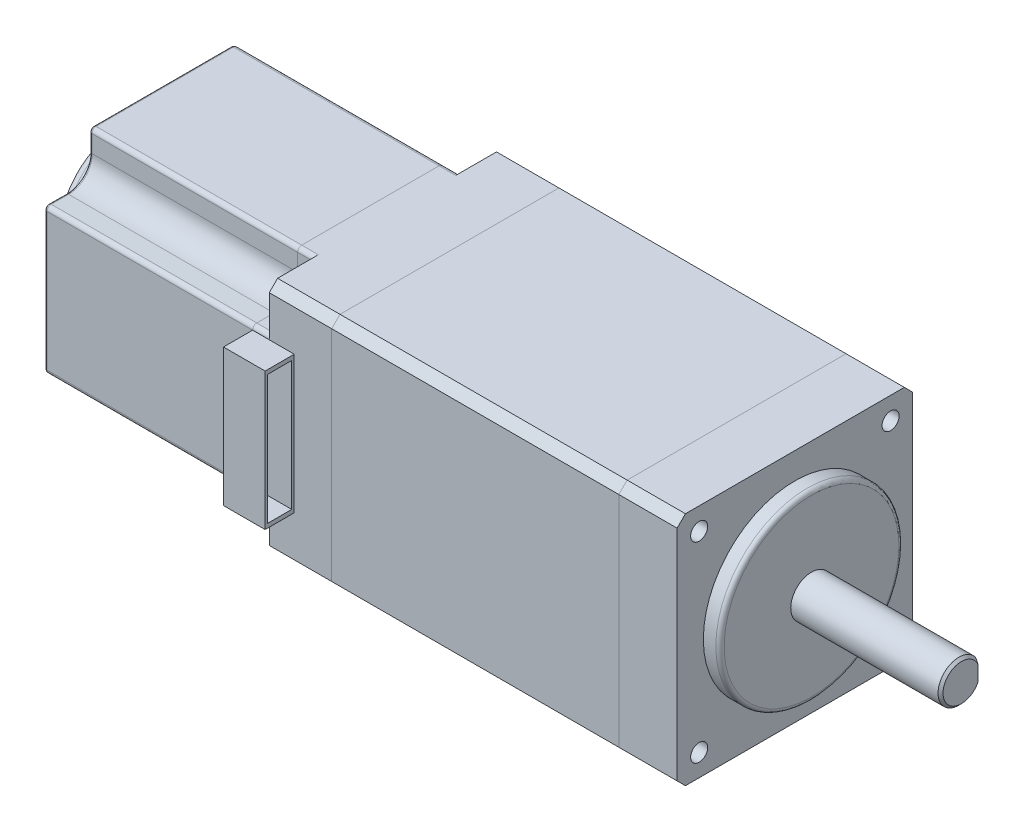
ISO-10303-21;
HEADER;
FILE_DESCRIPTION(('STEP AP214'),'2;1');
FILE_NAME('part.step','',(''),(''),'','','');
FILE_SCHEMA(('AUTOMOTIVE_DESIGN { 1 0 10303 214 1 1 1 1 }'));
ENDSEC;
DATA;
#1=APPLICATION_CONTEXT('core data for automotive mechanical design processes');
#2=APPLICATION_PROTOCOL_DEFINITION('international standard','automotive_design',2000,#1);
#3=PRODUCT_CONTEXT('',#1,'mechanical');
#4=PRODUCT('Part','Part','',(#3));
#5=PRODUCT_RELATED_PRODUCT_CATEGORY('part','',(#4));
#6=PRODUCT_DEFINITION_FORMATION('','',#4);
#7=PRODUCT_DEFINITION_CONTEXT('part definition',#1,'design');
#8=PRODUCT_DEFINITION('design','',#6,#7);
#9=PRODUCT_DEFINITION_SHAPE('','',#8);
#10=(LENGTH_UNIT() NAMED_UNIT(*) SI_UNIT(.MILLI.,.METRE.));
#11=(NAMED_UNIT(*) PLANE_ANGLE_UNIT() SI_UNIT($,.RADIAN.));
#12=(NAMED_UNIT(*) SI_UNIT($,.STERADIAN.) SOLID_ANGLE_UNIT());
#13=UNCERTAINTY_MEASURE_WITH_UNIT(LENGTH_MEASURE(1.E-05),#10,'distance_accuracy_value','');
#14=(GEOMETRIC_REPRESENTATION_CONTEXT(3) GLOBAL_UNCERTAINTY_ASSIGNED_CONTEXT((#13)) GLOBAL_UNIT_ASSIGNED_CONTEXT((#10,
#11,#12)) REPRESENTATION_CONTEXT('',''));
#15=CARTESIAN_POINT('',(0.,0.,0.));
#16=DIRECTION('',(0.,0.,1.));
#17=DIRECTION('',(1.,0.,0.));
#18=AXIS2_PLACEMENT_3D('',#15,#16,#17);
#19=CARTESIAN_POINT('',(-76.,0.,0.));
#20=DIRECTION('',(-1.,0.,0.));
#21=DIRECTION('',(0.,0.,1.));
#22=AXIS2_PLACEMENT_3D('',#19,#20,#21);
#23=PLANE('',#22);
#24=CARTESIAN_POINT('',(-76.,-8.25,-13.65));
#25=DIRECTION('',(-1.,0.,0.));
#26=DIRECTION('',(0.,0.,1.));
#27=AXIS2_PLACEMENT_3D('',#24,#25,#26);
#28=CIRCLE('',#27,0.2);
#29=CARTESIAN_POINT('',(-76.,-8.25,-13.85));
#30=VERTEX_POINT('',#29);
#31=CARTESIAN_POINT('',(-76.,-8.4499357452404,-13.6449307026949));
#32=VERTEX_POINT('',#31);
#33=EDGE_CURVE('E495',#30,#32,#28,.T.);
#34=ORIENTED_EDGE('',*,*,#33,.T.);
#35=DIRECTION('',(0.,0.00879604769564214,0.999961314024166));
#36=VECTOR('',#35,1.);
#37=CARTESIAN_POINT('',(-76.,-8.431583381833,-11.5585785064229));
#38=LINE('',#37,#36);
#39=CARTESIAN_POINT('',(-76.,-8.43159804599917,-11.5602455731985));
#40=VERTEX_POINT('',#39);
#41=EDGE_CURVE('E497',#32,#40,#38,.T.);
#42=ORIENTED_EDGE('',*,*,#41,.T.);
#43=CARTESIAN_POINT('',(-76.,-11.5,-11.5));
#44=DIRECTION('',(-1.,0.,0.));
#45=DIRECTION('',(0.,0.,1.));
#46=AXIS2_PLACEMENT_3D('',#43,#44,#45);
#47=CIRCLE('',#46,3.06899333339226);
#48=CARTESIAN_POINT('',(-76.,-8.91095106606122,-9.85210871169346));
#49=VERTEX_POINT('',#48);
#50=EDGE_CURVE('E308',#40,#49,#47,.F.);
#51=ORIENTED_EDGE('',*,*,#50,.T.);
#52=CARTESIAN_POINT('',(-76.,-11.45,-11.45));
#53=DIRECTION('',(-1.,0.,0.));
#54=DIRECTION('',(0.,0.,1.));
#55=AXIS2_PLACEMENT_3D('',#52,#53,#54);
#56=CIRCLE('',#55,3.);
#57=CARTESIAN_POINT('',(-76.,-9.8506729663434,-8.91186031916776));
#58=VERTEX_POINT('',#57);
#59=EDGE_CURVE('E449',#49,#58,#56,.F.);
#60=ORIENTED_EDGE('',*,*,#59,.T.);
#61=CARTESIAN_POINT('',(-76.,-11.5,-11.5));
#62=DIRECTION('',(-1.,0.,0.));
#63=DIRECTION('',(0.,0.,1.));
#64=AXIS2_PLACEMENT_3D('',#61,#62,#63);
#65=CIRCLE('',#64,3.06899333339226);
#66=CARTESIAN_POINT('',(-76.,-11.825224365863,-8.44828749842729));
#67=VERTEX_POINT('',#66);
#68=EDGE_CURVE('E451',#58,#67,#65,.F.);
#69=ORIENTED_EDGE('',*,*,#68,.T.);
#70=DIRECTION('',(0.,0.999999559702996,0.000938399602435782));
#71=VECTOR('',#70,1.);
#72=CARTESIAN_POINT('',(-76.,0.00791745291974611,-8.43718327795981));
#73=LINE('',#72,#71);
#74=CARTESIAN_POINT('',(-76.,-13.650000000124,-8.44999986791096));
#75=VERTEX_POINT('',#74);
#76=EDGE_CURVE('E453',#67,#75,#73,.F.);
#77=ORIENTED_EDGE('',*,*,#76,.T.);
#78=CARTESIAN_POINT('',(-76.,-13.65,-8.25));
#79=DIRECTION('',(-1.,0.,0.));
#80=DIRECTION('',(0.,0.,1.));
#81=AXIS2_PLACEMENT_3D('',#78,#79,#80);
#82=CIRCLE('',#81,0.2);
#83=CARTESIAN_POINT('',(-76.,-13.85,-8.24999999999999));
#84=VERTEX_POINT('',#83);
#85=EDGE_CURVE('E455',#75,#84,#82,.T.);
#86=ORIENTED_EDGE('',*,*,#85,.T.);
#87=DIRECTION('',(0.,0.,1.));
#88=VECTOR('',#87,1.);
#89=CARTESIAN_POINT('',(-76.,-13.85,8.25));
#90=LINE('',#89,#88);
#91=CARTESIAN_POINT('',(-76.,-13.85,8.25));
#92=VERTEX_POINT('',#91);
#93=EDGE_CURVE('E457',#84,#92,#90,.T.);
#94=ORIENTED_EDGE('',*,*,#93,.T.);
#95=CARTESIAN_POINT('',(-76.,-13.65,8.25));
#96=DIRECTION('',(-1.,0.,0.));
#97=DIRECTION('',(0.,0.,1.));
#98=AXIS2_PLACEMENT_3D('',#95,#96,#97);
#99=CIRCLE('',#98,0.2);
#100=CARTESIAN_POINT('',(-76.,-13.6511195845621,8.44999686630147));
#101=VERTEX_POINT('',#100);
#102=EDGE_CURVE('E459',#92,#101,#99,.T.);
#103=ORIENTED_EDGE('',*,*,#102,.T.);
#104=DIRECTION('',(0.,-0.999953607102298,0.00963242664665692));
#105=VECTOR('',#104,1.);
#106=CARTESIAN_POINT('',(-76.,0.0801235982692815,8.3177255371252));
#107=LINE('',#106,#105);
#108=CARTESIAN_POINT('',(-76.,-11.5576722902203,8.42983095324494));
#109=VERTEX_POINT('',#108);
#110=EDGE_CURVE('E461',#101,#109,#107,.F.);
#111=ORIENTED_EDGE('',*,*,#110,.T.);
#112=CARTESIAN_POINT('',(-76.,-11.5,11.5));
#113=DIRECTION('',(-1.,0.,0.));
#114=DIRECTION('',(0.,0.,1.));
#115=AXIS2_PLACEMENT_3D('',#112,#113,#114);
#116=CIRCLE('',#115,3.07071067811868);
#117=CARTESIAN_POINT('',(-76.,-8.45000000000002,11.8560394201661));
#118=VERTEX_POINT('',#117);
#119=EDGE_CURVE('E463',#109,#118,#116,.F.);
#120=ORIENTED_EDGE('',*,*,#119,.T.);
#121=DIRECTION('',(0.,0.,1.));
#122=VECTOR('',#121,1.);
#123=CARTESIAN_POINT('',(-76.,-8.45000000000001,13.65));
#124=LINE('',#123,#122);
#125=CARTESIAN_POINT('',(-76.,-8.45000000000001,13.65));
#126=VERTEX_POINT('',#125);
#127=EDGE_CURVE('E465',#118,#126,#124,.T.);
#128=ORIENTED_EDGE('',*,*,#127,.T.);
#129=CARTESIAN_POINT('',(-76.,-8.25000000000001,13.65));
#130=DIRECTION('',(-1.,0.,0.));
#131=DIRECTION('',(0.,0.,1.));
#132=AXIS2_PLACEMENT_3D('',#129,#130,#131);
#133=CIRCLE('',#132,0.2);
#134=CARTESIAN_POINT('',(-76.,-8.25,13.85));
#135=VERTEX_POINT('',#134);
#136=EDGE_CURVE('E467',#126,#135,#133,.T.);
#137=ORIENTED_EDGE('',*,*,#136,.T.);
#138=DIRECTION('',(0.,1.,0.));
#139=VECTOR('',#138,1.);
#140=CARTESIAN_POINT('',(-76.,8.25,13.85));
#141=LINE('',#140,#139);
#142=CARTESIAN_POINT('',(-76.,8.25,13.85));
#143=VERTEX_POINT('',#142);
#144=EDGE_CURVE('E469',#135,#143,#141,.T.);
#145=ORIENTED_EDGE('',*,*,#144,.T.);
#146=CARTESIAN_POINT('',(-76.,8.25,13.65));
#147=DIRECTION('',(-1.,0.,0.));
#148=DIRECTION('',(0.,0.,1.));
#149=AXIS2_PLACEMENT_3D('',#146,#147,#148);
#150=CIRCLE('',#149,0.2);
#151=CARTESIAN_POINT('',(-76.,8.44993818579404,13.6450278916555));
#152=VERTEX_POINT('',#151);
#153=EDGE_CURVE('E471',#143,#152,#150,.T.);
#154=ORIENTED_EDGE('',*,*,#153,.T.);
#155=DIRECTION('',(0.,0.00963242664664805,0.999953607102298));
#156=VECTOR('',#155,1.);
#157=CARTESIAN_POINT('',(-76.,8.31772553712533,-0.080123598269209));
#158=LINE('',#157,#156);
#159=CARTESIAN_POINT('',(-76.,8.42983095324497,11.5576722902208));
#160=VERTEX_POINT('',#159);
#161=EDGE_CURVE('E473',#152,#160,#158,.F.);
#162=ORIENTED_EDGE('',*,*,#161,.T.);
#163=CARTESIAN_POINT('',(-76.,11.5,11.5));
#164=DIRECTION('',(-1.,0.,0.));
#165=DIRECTION('',(0.,0.,1.));
#166=AXIS2_PLACEMENT_3D('',#163,#164,#165);
#167=CIRCLE('',#166,3.07071067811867);
#168=CARTESIAN_POINT('',(-76.,11.5576722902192,8.42983095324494));
#169=VERTEX_POINT('',#168);
#170=EDGE_CURVE('E475',#160,#169,#167,.F.);
#171=ORIENTED_EDGE('',*,*,#170,.T.);
#172=DIRECTION('',(0.,0.999953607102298,0.00963242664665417));
#173=VECTOR('',#172,1.);
#174=CARTESIAN_POINT('',(-76.,13.652889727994,8.45001391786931));
#175=LINE('',#174,#173);
#176=CARTESIAN_POINT('',(-76.,13.6511195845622,8.44999686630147));
#177=VERTEX_POINT('',#176);
#178=EDGE_CURVE('E477',#169,#177,#175,.T.);
#179=ORIENTED_EDGE('',*,*,#178,.T.);
#180=CARTESIAN_POINT('',(-76.,13.65,8.25));
#181=DIRECTION('',(-1.,0.,0.));
#182=DIRECTION('',(0.,0.,1.));
#183=AXIS2_PLACEMENT_3D('',#180,#181,#182);
#184=CIRCLE('',#183,0.2);
#185=CARTESIAN_POINT('',(-76.,13.85,8.25));
#186=VERTEX_POINT('',#185);
#187=EDGE_CURVE('E479',#177,#186,#184,.T.);
#188=ORIENTED_EDGE('',*,*,#187,.T.);
#189=DIRECTION('',(0.,0.,-1.));
#190=VECTOR('',#189,1.);
#191=CARTESIAN_POINT('',(-76.,13.85,-8.25));
#192=LINE('',#191,#190);
#193=CARTESIAN_POINT('',(-76.,13.85,-8.25));
#194=VERTEX_POINT('',#193);
#195=EDGE_CURVE('E481',#186,#194,#192,.T.);
#196=ORIENTED_EDGE('',*,*,#195,.T.);
#197=CARTESIAN_POINT('',(-76.,13.65,-8.25));
#198=DIRECTION('',(-1.,0.,0.));
#199=DIRECTION('',(0.,0.,1.));
#200=AXIS2_PLACEMENT_3D('',#197,#198,#199);
#201=CIRCLE('',#200,0.2);
#202=CARTESIAN_POINT('',(-76.,13.65,-8.45));
#203=VERTEX_POINT('',#202);
#204=EDGE_CURVE('E483',#194,#203,#201,.T.);
#205=ORIENTED_EDGE('',*,*,#204,.T.);
#206=DIRECTION('',(0.,-1.,0.));
#207=VECTOR('',#206,1.);
#208=CARTESIAN_POINT('',(-76.,11.8381385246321,-8.45));
#209=LINE('',#208,#207);
#210=CARTESIAN_POINT('',(-76.,11.8560394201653,-8.45));
#211=VERTEX_POINT('',#210);
#212=EDGE_CURVE('E485',#203,#211,#209,.T.);
#213=ORIENTED_EDGE('',*,*,#212,.T.);
#214=CARTESIAN_POINT('',(-76.,11.5,-11.5));
#215=DIRECTION('',(-1.,0.,0.));
#216=DIRECTION('',(0.,0.,1.));
#217=AXIS2_PLACEMENT_3D('',#214,#215,#216);
#218=CIRCLE('',#217,3.07071067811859);
#219=CARTESIAN_POINT('',(-76.,8.42983095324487,-11.5576722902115));
#220=VERTEX_POINT('',#219);
#221=EDGE_CURVE('E487',#211,#220,#218,.F.);
#222=ORIENTED_EDGE('',*,*,#221,.T.);
#223=DIRECTION('',(0.,0.00963242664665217,-0.999953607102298));
#224=VECTOR('',#223,1.);
#225=CARTESIAN_POINT('',(-76.,8.44992113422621,-13.6432577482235));
#226=LINE('',#225,#224);
#227=CARTESIAN_POINT('',(-76.,8.44993818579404,-13.6450278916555));
#228=VERTEX_POINT('',#227);
#229=EDGE_CURVE('E489',#220,#228,#226,.T.);
#230=ORIENTED_EDGE('',*,*,#229,.T.);
#231=CARTESIAN_POINT('',(-76.,8.25,-13.65));
#232=DIRECTION('',(-1.,0.,0.));
#233=DIRECTION('',(0.,0.,1.));
#234=AXIS2_PLACEMENT_3D('',#231,#232,#233);
#235=CIRCLE('',#234,0.200000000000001);
#236=CARTESIAN_POINT('',(-76.,8.24999999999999,-13.85));
#237=VERTEX_POINT('',#236);
#238=EDGE_CURVE('E491',#228,#237,#235,.T.);
#239=ORIENTED_EDGE('',*,*,#238,.T.);
#240=DIRECTION('',(0.,-1.,0.));
#241=VECTOR('',#240,1.);
#242=CARTESIAN_POINT('',(-76.,-8.25,-13.85));
#243=LINE('',#242,#241);
#244=EDGE_CURVE('E493',#237,#30,#243,.T.);
#245=ORIENTED_EDGE('',*,*,#244,.T.);
#246=EDGE_LOOP('',(#34,#42,#51,#60,#69,#77,#86,#94,#103,#111,#120,#128,#137,#145,#154,#162,#171,
#179,#188,#196,#205,#213,#222,#230,#239,#245));
#247=FACE_BOUND('',#246,.T.);
#248=CARTESIAN_POINT('',(-76.,0.,0.));
#249=DIRECTION('',(-1.,0.,0.));
#250=DIRECTION('',(0.,0.,1.));
#251=AXIS2_PLACEMENT_3D('',#248,#249,#250);
#252=CIRCLE('',#251,8.);
#253=CARTESIAN_POINT('',(-76.,0.,8.));
#254=VERTEX_POINT('',#253);
#255=EDGE_CURVE('E559',#254,#254,#252,.T.);
#256=ORIENTED_EDGE('',*,*,#255,.F.);
#257=EDGE_LOOP('',(#256));
#258=FACE_BOUND('',#257,.T.);
#259=ADVANCED_FACE('F50',(#247,#258),#23,.T.);
#260=CARTESIAN_POINT('',(-76.,-11.5,-11.5));
#261=DIRECTION('',(1.,0.,0.));
#262=DIRECTION('',(0.,0.,-1.));
#263=AXIS2_PLACEMENT_3D('',#260,#261,#262);
#264=CYLINDRICAL_SURFACE('',#263,2.76899333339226);
#265=DIRECTION('',(1.,0.,0.));
#266=VECTOR('',#265,1.);
#267=CARTESIAN_POINT('',(-76.,-9.16485925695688,-10.0118999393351));
#268=LINE('',#267,#266);
#269=CARTESIAN_POINT('',(-75.7,-9.16485925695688,-10.0118999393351));
#270=VERTEX_POINT('',#269);
#271=CARTESIAN_POINT('',(-51.,-9.16485925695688,-10.0118999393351));
#272=VERTEX_POINT('',#271);
#273=EDGE_CURVE('E300',#270,#272,#268,.T.);
#274=ORIENTED_EDGE('',*,*,#273,.F.);
#275=CARTESIAN_POINT('',(-75.7,-11.5,-11.5));
#276=DIRECTION('',(-1.,0.,0.));
#277=DIRECTION('',(0.,0.,1.));
#278=AXIS2_PLACEMENT_3D('',#275,#276,#277);
#279=CIRCLE('',#278,2.76899333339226);
#280=CARTESIAN_POINT('',(-75.7,-8.73157177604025,-11.5559396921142));
#281=VERTEX_POINT('',#280);
#282=EDGE_CURVE('E549',#270,#281,#279,.T.);
#283=ORIENTED_EDGE('',*,*,#282,.T.);
#284=DIRECTION('',(1.,0.,0.));
#285=VECTOR('',#284,1.);
#286=CARTESIAN_POINT('',(-76.,-8.73157177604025,-11.5559396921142));
#287=LINE('',#286,#285);
#288=CARTESIAN_POINT('',(-51.,-8.73157177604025,-11.5559396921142));
#289=VERTEX_POINT('',#288);
#290=EDGE_CURVE('E322',#281,#289,#287,.T.);
#291=ORIENTED_EDGE('',*,*,#290,.T.);
#292=CARTESIAN_POINT('',(-51.,-11.5,-11.5));
#293=DIRECTION('',(-1.,0.,0.));
#294=DIRECTION('',(0.,0.,1.));
#295=AXIS2_PLACEMENT_3D('',#292,#293,#294);
#296=CIRCLE('',#295,2.76899333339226);
#297=EDGE_CURVE('E315',#272,#289,#296,.T.);
#298=ORIENTED_EDGE('',*,*,#297,.F.);
#299=EDGE_LOOP('',(#274,#283,#291,#298));
#300=FACE_BOUND('',#299,.T.);
#301=ADVANCED_FACE('F320',(#300),#264,.F.);
#302=CARTESIAN_POINT('',(-76.,-11.45,-11.45));
#303=DIRECTION('',(1.,0.,0.));
#304=DIRECTION('',(0.,0.,-1.));
#305=AXIS2_PLACEMENT_3D('',#302,#303,#304);
#306=CYLINDRICAL_SURFACE('',#305,2.7);
#307=DIRECTION('',(1.,0.,0.));
#308=VECTOR('',#307,1.);
#309=CARTESIAN_POINT('',(-76.,-10.0118999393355,-9.16485925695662));
#310=LINE('',#309,#308);
#311=CARTESIAN_POINT('',(-75.7,-10.0118999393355,-9.16485925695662));
#312=VERTEX_POINT('',#311);
#313=CARTESIAN_POINT('',(-51.,-10.0118999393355,-9.16485925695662));
#314=VERTEX_POINT('',#313);
#315=EDGE_CURVE('E309',#312,#314,#310,.T.);
#316=ORIENTED_EDGE('',*,*,#315,.F.);
#317=CARTESIAN_POINT('',(-75.7,-11.45,-11.45));
#318=DIRECTION('',(-1.,0.,0.));
#319=DIRECTION('',(0.,0.,1.));
#320=AXIS2_PLACEMENT_3D('',#317,#318,#319);
#321=CIRCLE('',#320,2.7);
#322=EDGE_CURVE('E65',#312,#270,#321,.T.);
#323=ORIENTED_EDGE('',*,*,#322,.T.);
#324=ORIENTED_EDGE('',*,*,#273,.T.);
#325=CARTESIAN_POINT('',(-51.,-11.45,-11.45));
#326=DIRECTION('',(-1.,0.,0.));
#327=DIRECTION('',(0.,0.,1.));
#328=AXIS2_PLACEMENT_3D('',#325,#326,#327);
#329=CIRCLE('',#328,2.7);
#330=EDGE_CURVE('E303',#272,#314,#329,.F.);
#331=ORIENTED_EDGE('',*,*,#330,.T.);
#332=EDGE_LOOP('',(#316,#323,#324,#331));
#333=FACE_BOUND('',#332,.T.);
#334=ADVANCED_FACE('F302',(#333),#306,.F.);
#335=DIRECTION('',(1.,0.,0.));
#336=VECTOR('',#335,1.);
#337=CARTESIAN_POINT('',(-76.,-11.8087360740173,-8.74827215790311));
#338=LINE('',#337,#336);
#339=CARTESIAN_POINT('',(-75.7,-11.8087360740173,-8.74827215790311));
#340=VERTEX_POINT('',#339);
#341=CARTESIAN_POINT('',(-51.,-11.8087360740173,-8.74827215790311));
#342=VERTEX_POINT('',#341);
#343=EDGE_CURVE('E445',#340,#342,#338,.T.);
#344=ORIENTED_EDGE('',*,*,#343,.F.);
#345=CARTESIAN_POINT('',(-75.7,-11.5,-11.5));
#346=DIRECTION('',(-1.,0.,0.));
#347=DIRECTION('',(0.,0.,1.));
#348=AXIS2_PLACEMENT_3D('',#345,#346,#347);
#349=CIRCLE('',#348,2.76899333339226);
#350=EDGE_CURVE('E73',#340,#312,#349,.T.);
#351=ORIENTED_EDGE('',*,*,#350,.T.);
#352=ORIENTED_EDGE('',*,*,#315,.T.);
#353=EDGE_CURVE('E318',#342,#314,#296,.T.);
#354=ORIENTED_EDGE('',*,*,#353,.F.);
#355=EDGE_LOOP('',(#344,#351,#352,#354));
#356=FACE_BOUND('',#355,.T.);
#357=ADVANCED_FACE('F764',(#356),#264,.F.);
#358=CARTESIAN_POINT('',(-76.,0.00819897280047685,-8.73718314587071));
#359=DIRECTION('',(0.,0.000938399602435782,-0.999999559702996));
#360=DIRECTION('',(0.,0.999999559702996,0.000938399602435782));
#361=AXIS2_PLACEMENT_3D('',#358,#359,#360);
#362=PLANE('',#361);
#363=DIRECTION('',(1.,0.,0.));
#364=VECTOR('',#363,1.);
#365=CARTESIAN_POINT('',(-76.,-13.65,-8.75));
#366=LINE('',#365,#364);
#367=CARTESIAN_POINT('',(-75.7,-13.65,-8.75));
#368=VERTEX_POINT('',#367);
#369=CARTESIAN_POINT('',(-51.,-13.65,-8.75));
#370=VERTEX_POINT('',#369);
#371=EDGE_CURVE('E443',#368,#370,#366,.T.);
#372=ORIENTED_EDGE('',*,*,#371,.F.);
#373=DIRECTION('',(0.,0.999999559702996,0.000938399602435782));
#374=VECTOR('',#373,1.);
#375=CARTESIAN_POINT('',(-75.7,0.00819897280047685,-8.73718314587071));
#376=LINE('',#375,#374);
#377=EDGE_CURVE('E545',#368,#340,#376,.T.);
#378=ORIENTED_EDGE('',*,*,#377,.T.);
#379=ORIENTED_EDGE('',*,*,#343,.T.);
#380=DIRECTION('',(0.,0.999999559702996,0.000938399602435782));
#381=VECTOR('',#380,1.);
#382=CARTESIAN_POINT('',(-51.,0.00819897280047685,-8.73718314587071));
#383=LINE('',#382,#381);
#384=EDGE_CURVE('E330',#370,#342,#383,.T.);
#385=ORIENTED_EDGE('',*,*,#384,.F.);
#386=EDGE_LOOP('',(#372,#378,#379,#385));
#387=FACE_BOUND('',#386,.T.);
#388=ADVANCED_FACE('F856',(#387),#362,.T.);
#389=CARTESIAN_POINT('',(-76.,-13.65,-8.25));
#390=DIRECTION('',(1.,0.,0.));
#391=DIRECTION('',(0.,0.,-1.));
#392=AXIS2_PLACEMENT_3D('',#389,#390,#391);
#393=CYLINDRICAL_SURFACE('',#392,0.5);
#394=DIRECTION('',(1.,0.,0.));
#395=VECTOR('',#394,1.);
#396=CARTESIAN_POINT('',(-76.,-14.15,-8.24999999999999));
#397=LINE('',#396,#395);
#398=CARTESIAN_POINT('',(-75.7,-14.15,-8.24999999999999));
#399=VERTEX_POINT('',#398);
#400=CARTESIAN_POINT('',(-51.,-14.15,-8.24999999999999));
#401=VERTEX_POINT('',#400);
#402=EDGE_CURVE('E441',#399,#401,#397,.T.);
#403=ORIENTED_EDGE('',*,*,#402,.F.);
#404=CARTESIAN_POINT('',(-75.7,-13.65,-8.25));
#405=DIRECTION('',(-1.,0.,0.));
#406=DIRECTION('',(0.,0.,1.));
#407=AXIS2_PLACEMENT_3D('',#404,#405,#406);
#408=CIRCLE('',#407,0.5);
#409=EDGE_CURVE('E543',#399,#368,#408,.F.);
#410=ORIENTED_EDGE('',*,*,#409,.T.);
#411=ORIENTED_EDGE('',*,*,#371,.T.);
#412=CARTESIAN_POINT('',(-51.,-13.65,-8.25));
#413=DIRECTION('',(-1.,0.,0.));
#414=DIRECTION('',(0.,0.,1.));
#415=AXIS2_PLACEMENT_3D('',#412,#413,#414);
#416=CIRCLE('',#415,0.5);
#417=EDGE_CURVE('E331',#370,#401,#416,.T.);
#418=ORIENTED_EDGE('',*,*,#417,.T.);
#419=EDGE_LOOP('',(#403,#410,#411,#418));
#420=FACE_BOUND('',#419,.T.);
#421=ADVANCED_FACE('F852',(#420),#393,.T.);
#422=CARTESIAN_POINT('',(-76.,-14.15,0.));
#423=DIRECTION('',(0.,1.,0.));
#424=DIRECTION('',(0.,0.,1.));
#425=AXIS2_PLACEMENT_3D('',#422,#423,#424);
#426=PLANE('',#425);
#427=DIRECTION('',(1.,0.,0.));
#428=VECTOR('',#427,1.);
#429=CARTESIAN_POINT('',(-76.,-14.15,8.25));
#430=LINE('',#429,#428);
#431=CARTESIAN_POINT('',(-75.7,-14.15,8.25));
#432=VERTEX_POINT('',#431);
#433=CARTESIAN_POINT('',(-51.,-14.15,8.25));
#434=VERTEX_POINT('',#433);
#435=EDGE_CURVE('E439',#432,#434,#430,.T.);
#436=ORIENTED_EDGE('',*,*,#435,.F.);
#437=DIRECTION('',(0.,0.,1.));
#438=VECTOR('',#437,1.);
#439=CARTESIAN_POINT('',(-75.7,-14.15,-8.24999999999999));
#440=LINE('',#439,#438);
#441=EDGE_CURVE('E541',#432,#399,#440,.F.);
#442=ORIENTED_EDGE('',*,*,#441,.T.);
#443=ORIENTED_EDGE('',*,*,#402,.T.);
#444=DIRECTION('',(0.,0.,1.));
#445=VECTOR('',#444,1.);
#446=CARTESIAN_POINT('',(-51.,-14.15,0.));
#447=LINE('',#446,#445);
#448=EDGE_CURVE('E336',#401,#434,#447,.T.);
#449=ORIENTED_EDGE('',*,*,#448,.T.);
#450=EDGE_LOOP('',(#436,#442,#443,#449));
#451=FACE_BOUND('',#450,.T.);
#452=ADVANCED_FACE('F848',(#451),#426,.F.);
#453=CARTESIAN_POINT('',(-76.,-13.65,8.25));
#454=DIRECTION('',(1.,0.,0.));
#455=DIRECTION('',(0.,0.,-1.));
#456=AXIS2_PLACEMENT_3D('',#453,#454,#455);
#457=CYLINDRICAL_SURFACE('',#456,0.5);
#458=DIRECTION('',(1.,0.,0.));
#459=VECTOR('',#458,1.);
#460=CARTESIAN_POINT('',(-76.,-13.65,8.75));
#461=LINE('',#460,#459);
#462=CARTESIAN_POINT('',(-75.7,-13.65,8.75));
#463=VERTEX_POINT('',#462);
#464=CARTESIAN_POINT('',(-51.,-13.65,8.75));
#465=VERTEX_POINT('',#464);
#466=EDGE_CURVE('E437',#463,#465,#461,.T.);
#467=ORIENTED_EDGE('',*,*,#466,.F.);
#468=CARTESIAN_POINT('',(-75.7,-13.65,8.25));
#469=DIRECTION('',(-1.,0.,0.));
#470=DIRECTION('',(0.,0.,1.));
#471=AXIS2_PLACEMENT_3D('',#468,#469,#470);
#472=CIRCLE('',#471,0.5);
#473=EDGE_CURVE('E539',#463,#432,#472,.F.);
#474=ORIENTED_EDGE('',*,*,#473,.T.);
#475=ORIENTED_EDGE('',*,*,#435,.T.);
#476=CARTESIAN_POINT('',(-51.,-13.65,8.25));
#477=DIRECTION('',(-1.,0.,0.));
#478=DIRECTION('',(0.,0.,1.));
#479=AXIS2_PLACEMENT_3D('',#476,#477,#478);
#480=CIRCLE('',#479,0.5);
#481=EDGE_CURVE('E341',#434,#465,#480,.T.);
#482=ORIENTED_EDGE('',*,*,#481,.T.);
#483=EDGE_LOOP('',(#467,#474,#475,#482));
#484=FACE_BOUND('',#483,.T.);
#485=ADVANCED_FACE('F844',(#484),#457,.T.);
#486=CARTESIAN_POINT('',(-76.,0.0830133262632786,8.61771161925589));
#487=DIRECTION('',(0.,0.00963242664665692,0.999953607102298));
#488=DIRECTION('',(0.,-0.999953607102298,0.00963242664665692));
#489=AXIS2_PLACEMENT_3D('',#486,#487,#488);
#490=PLANE('',#489);
#491=DIRECTION('',(1.,0.,0.));
#492=VECTOR('',#491,1.);
#493=CARTESIAN_POINT('',(-76.,-11.5533748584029,8.72980347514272));
#494=LINE('',#493,#492);
#495=CARTESIAN_POINT('',(-75.7,-11.5533748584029,8.72980347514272));
#496=VERTEX_POINT('',#495);
#497=CARTESIAN_POINT('',(-51.,-11.5533748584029,8.72980347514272));
#498=VERTEX_POINT('',#497);
#499=EDGE_CURVE('E435',#496,#498,#494,.T.);
#500=ORIENTED_EDGE('',*,*,#499,.F.);
#501=DIRECTION('',(0.,-0.999953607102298,0.00963242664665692));
#502=VECTOR('',#501,1.);
#503=CARTESIAN_POINT('',(-75.7,0.0830133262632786,8.61771161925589));
#504=LINE('',#503,#502);
#505=EDGE_CURVE('E537',#496,#463,#504,.T.);
#506=ORIENTED_EDGE('',*,*,#505,.T.);
#507=ORIENTED_EDGE('',*,*,#466,.T.);
#508=DIRECTION('',(0.,-0.999953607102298,0.00963242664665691));
#509=VECTOR('',#508,1.);
#510=CARTESIAN_POINT('',(-51.,0.0830133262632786,8.61771161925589));
#511=LINE('',#510,#509);
#512=EDGE_CURVE('E344',#498,#465,#511,.T.);
#513=ORIENTED_EDGE('',*,*,#512,.F.);
#514=EDGE_LOOP('',(#500,#506,#507,#513));
#515=FACE_BOUND('',#514,.T.);
#516=ADVANCED_FACE('F840',(#515),#490,.T.);
#517=CARTESIAN_POINT('',(-76.,-11.5,11.5));
#518=DIRECTION('',(1.,0.,0.));
#519=DIRECTION('',(0.,0.,-1.));
#520=AXIS2_PLACEMENT_3D('',#517,#518,#519);
#521=CYLINDRICAL_SURFACE('',#520,2.77071067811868);
#522=DIRECTION('',(1.,0.,0.));
#523=VECTOR('',#522,1.);
#524=CARTESIAN_POINT('',(-76.,-8.75000000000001,11.8381385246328));
#525=LINE('',#524,#523);
#526=CARTESIAN_POINT('',(-75.7,-8.75000000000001,11.8381385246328));
#527=VERTEX_POINT('',#526);
#528=CARTESIAN_POINT('',(-51.,-8.75000000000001,11.8381385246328));
#529=VERTEX_POINT('',#528);
#530=EDGE_CURVE('E433',#527,#529,#525,.T.);
#531=ORIENTED_EDGE('',*,*,#530,.F.);
#532=CARTESIAN_POINT('',(-75.7,-11.5,11.5));
#533=DIRECTION('',(-1.,0.,0.));
#534=DIRECTION('',(0.,0.,1.));
#535=AXIS2_PLACEMENT_3D('',#532,#533,#534);
#536=CIRCLE('',#535,2.77071067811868);
#537=EDGE_CURVE('E535',#527,#496,#536,.T.);
#538=ORIENTED_EDGE('',*,*,#537,.T.);
#539=ORIENTED_EDGE('',*,*,#499,.T.);
#540=CARTESIAN_POINT('',(-51.,-11.5,11.5));
#541=DIRECTION('',(-1.,0.,0.));
#542=DIRECTION('',(0.,0.,1.));
#543=AXIS2_PLACEMENT_3D('',#540,#541,#542);
#544=CIRCLE('',#543,2.77071067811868);
#545=EDGE_CURVE('E347',#529,#498,#544,.T.);
#546=ORIENTED_EDGE('',*,*,#545,.F.);
#547=EDGE_LOOP('',(#531,#538,#539,#546));
#548=FACE_BOUND('',#547,.T.);
#549=ADVANCED_FACE('F836',(#548),#521,.F.);
#550=CARTESIAN_POINT('',(-76.,-8.75000000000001,0.));
#551=DIRECTION('',(0.,1.,0.));
#552=DIRECTION('',(0.,0.,1.));
#553=AXIS2_PLACEMENT_3D('',#550,#551,#552);
#554=PLANE('',#553);
#555=DIRECTION('',(1.,0.,0.));
#556=VECTOR('',#555,1.);
#557=CARTESIAN_POINT('',(-76.,-8.75000000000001,13.65));
#558=LINE('',#557,#556);
#559=CARTESIAN_POINT('',(-75.7,-8.75000000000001,13.65));
#560=VERTEX_POINT('',#559);
#561=CARTESIAN_POINT('',(-51.,-8.75000000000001,13.65));
#562=VERTEX_POINT('',#561);
#563=EDGE_CURVE('E431',#560,#562,#558,.T.);
#564=ORIENTED_EDGE('',*,*,#563,.F.);
#565=DIRECTION('',(0.,0.,1.));
#566=VECTOR('',#565,1.);
#567=CARTESIAN_POINT('',(-75.7,-8.75000000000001,11.8381385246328));
#568=LINE('',#567,#566);
#569=EDGE_CURVE('E533',#560,#527,#568,.F.);
#570=ORIENTED_EDGE('',*,*,#569,.T.);
#571=ORIENTED_EDGE('',*,*,#530,.T.);
#572=DIRECTION('',(0.,0.,1.));
#573=VECTOR('',#572,1.);
#574=CARTESIAN_POINT('',(-51.,-8.75000000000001,0.));
#575=LINE('',#574,#573);
#576=EDGE_CURVE('E350',#529,#562,#575,.T.);
#577=ORIENTED_EDGE('',*,*,#576,.T.);
#578=EDGE_LOOP('',(#564,#570,#571,#577));
#579=FACE_BOUND('',#578,.T.);
#580=ADVANCED_FACE('F832',(#579),#554,.F.);
#581=CARTESIAN_POINT('',(-76.,-8.25000000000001,13.65));
#582=DIRECTION('',(1.,0.,0.));
#583=DIRECTION('',(0.,0.,-1.));
#584=AXIS2_PLACEMENT_3D('',#581,#582,#583);
#585=CYLINDRICAL_SURFACE('',#584,0.5);
#586=DIRECTION('',(1.,0.,0.));
#587=VECTOR('',#586,1.);
#588=CARTESIAN_POINT('',(-76.,-8.25,14.15));
#589=LINE('',#588,#587);
#590=CARTESIAN_POINT('',(-75.7,-8.25,14.15));
#591=VERTEX_POINT('',#590);
#592=CARTESIAN_POINT('',(-51.,-8.25,14.15));
#593=VERTEX_POINT('',#592);
#594=EDGE_CURVE('E429',#591,#593,#589,.T.);
#595=ORIENTED_EDGE('',*,*,#594,.F.);
#596=CARTESIAN_POINT('',(-75.7,-8.25000000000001,13.65));
#597=DIRECTION('',(-1.,0.,0.));
#598=DIRECTION('',(0.,0.,1.));
#599=AXIS2_PLACEMENT_3D('',#596,#597,#598);
#600=CIRCLE('',#599,0.5);
#601=EDGE_CURVE('E531',#591,#560,#600,.F.);
#602=ORIENTED_EDGE('',*,*,#601,.T.);
#603=ORIENTED_EDGE('',*,*,#563,.T.);
#604=CARTESIAN_POINT('',(-51.,-8.25000000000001,13.65));
#605=DIRECTION('',(-1.,0.,0.));
#606=DIRECTION('',(0.,0.,1.));
#607=AXIS2_PLACEMENT_3D('',#604,#605,#606);
#608=CIRCLE('',#607,0.5);
#609=EDGE_CURVE('E353',#562,#593,#608,.T.);
#610=ORIENTED_EDGE('',*,*,#609,.T.);
#611=EDGE_LOOP('',(#595,#602,#603,#610));
#612=FACE_BOUND('',#611,.T.);
#613=ADVANCED_FACE('F828',(#612),#585,.T.);
#614=CARTESIAN_POINT('',(-76.,0.,14.15));
#615=DIRECTION('',(0.,0.,-1.));
#616=DIRECTION('',(0.,1.,0.));
#617=AXIS2_PLACEMENT_3D('',#614,#615,#616);
#618=PLANE('',#617);
#619=DIRECTION('',(1.,0.,0.));
#620=VECTOR('',#619,1.);
#621=CARTESIAN_POINT('',(-76.,8.25,14.15));
#622=LINE('',#621,#620);
#623=CARTESIAN_POINT('',(-75.7,8.25,14.15));
#624=VERTEX_POINT('',#623);
#625=CARTESIAN_POINT('',(-51.,8.25,14.15));
#626=VERTEX_POINT('',#625);
#627=EDGE_CURVE('E427',#624,#626,#622,.T.);
#628=ORIENTED_EDGE('',*,*,#627,.F.);
#629=DIRECTION('',(0.,1.,0.));
#630=VECTOR('',#629,1.);
#631=CARTESIAN_POINT('',(-75.7,-8.25,14.15));
#632=LINE('',#631,#630);
#633=EDGE_CURVE('E529',#624,#591,#632,.F.);
#634=ORIENTED_EDGE('',*,*,#633,.T.);
#635=ORIENTED_EDGE('',*,*,#594,.T.);
#636=DIRECTION('',(0.,1.,0.));
#637=VECTOR('',#636,1.);
#638=CARTESIAN_POINT('',(-51.,0.,14.15));
#639=LINE('',#638,#637);
#640=EDGE_CURVE('E356',#593,#626,#639,.T.);
#641=ORIENTED_EDGE('',*,*,#640,.T.);
#642=EDGE_LOOP('',(#628,#634,#635,#641));
#643=FACE_BOUND('',#642,.T.);
#644=ADVANCED_FACE('F824',(#643),#618,.F.);
#645=CARTESIAN_POINT('',(-76.,8.25,13.65));
#646=DIRECTION('',(1.,0.,0.));
#647=DIRECTION('',(0.,0.,-1.));
#648=AXIS2_PLACEMENT_3D('',#645,#646,#647);
#649=CYLINDRICAL_SURFACE('',#648,0.5);
#650=DIRECTION('',(1.,0.,0.));
#651=VECTOR('',#650,1.);
#652=CARTESIAN_POINT('',(-76.,8.7499072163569,13.6403680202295));
#653=LINE('',#652,#651);
#654=CARTESIAN_POINT('',(-75.7,8.7499072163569,13.6403680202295));
#655=VERTEX_POINT('',#654);
#656=CARTESIAN_POINT('',(-51.,8.7499072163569,13.6403680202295));
#657=VERTEX_POINT('',#656);
#658=EDGE_CURVE('E425',#655,#657,#653,.T.);
#659=ORIENTED_EDGE('',*,*,#658,.F.);
#660=CARTESIAN_POINT('',(-75.7,8.25,13.65));
#661=DIRECTION('',(-1.,0.,0.));
#662=DIRECTION('',(0.,0.,1.));
#663=AXIS2_PLACEMENT_3D('',#660,#661,#662);
#664=CIRCLE('',#663,0.5);
#665=EDGE_CURVE('E527',#655,#624,#664,.F.);
#666=ORIENTED_EDGE('',*,*,#665,.T.);
#667=ORIENTED_EDGE('',*,*,#627,.T.);
#668=CARTESIAN_POINT('',(-51.,8.25,13.65));
#669=DIRECTION('',(-1.,0.,0.));
#670=DIRECTION('',(0.,0.,1.));
#671=AXIS2_PLACEMENT_3D('',#668,#669,#670);
#672=CIRCLE('',#671,0.5);
#673=EDGE_CURVE('E359',#626,#657,#672,.T.);
#674=ORIENTED_EDGE('',*,*,#673,.T.);
#675=EDGE_LOOP('',(#659,#666,#667,#674));
#676=FACE_BOUND('',#675,.T.);
#677=ADVANCED_FACE('F820',(#676),#649,.T.);
#678=CARTESIAN_POINT('',(-76.,8.61771161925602,-0.0830133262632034));
#679=DIRECTION('',(0.,0.999953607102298,-0.00963242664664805));
#680=DIRECTION('',(0.,0.00963242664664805,0.999953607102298));
#681=AXIS2_PLACEMENT_3D('',#678,#679,#680);
#682=PLANE('',#681);
#683=DIRECTION('',(1.,0.,0.));
#684=VECTOR('',#683,1.);
#685=CARTESIAN_POINT('',(-76.,8.72980347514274,11.5533748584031));
#686=LINE('',#685,#684);
#687=CARTESIAN_POINT('',(-75.7,8.72980347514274,11.5533748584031));
#688=VERTEX_POINT('',#687);
#689=CARTESIAN_POINT('',(-51.,8.72980347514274,11.5533748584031));
#690=VERTEX_POINT('',#689);
#691=EDGE_CURVE('E423',#688,#690,#686,.T.);
#692=ORIENTED_EDGE('',*,*,#691,.F.);
#693=DIRECTION('',(0.,0.00963242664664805,0.999953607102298));
#694=VECTOR('',#693,1.);
#695=CARTESIAN_POINT('',(-75.7,8.61771161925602,-0.0830133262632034));
#696=LINE('',#695,#694);
#697=EDGE_CURVE('E525',#688,#655,#696,.T.);
#698=ORIENTED_EDGE('',*,*,#697,.T.);
#699=ORIENTED_EDGE('',*,*,#658,.T.);
#700=DIRECTION('',(0.,0.00963242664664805,0.999953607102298));
#701=VECTOR('',#700,1.);
#702=CARTESIAN_POINT('',(-51.,8.61771161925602,-0.0830133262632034));
#703=LINE('',#702,#701);
#704=EDGE_CURVE('E362',#690,#657,#703,.T.);
#705=ORIENTED_EDGE('',*,*,#704,.F.);
#706=EDGE_LOOP('',(#692,#698,#699,#705));
#707=FACE_BOUND('',#706,.T.);
#708=ADVANCED_FACE('F816',(#707),#682,.T.);
#709=CARTESIAN_POINT('',(-76.,11.5,11.5));
#710=DIRECTION('',(1.,0.,0.));
#711=DIRECTION('',(0.,0.,-1.));
#712=AXIS2_PLACEMENT_3D('',#709,#710,#711);
#713=CYLINDRICAL_SURFACE('',#712,2.77071067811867);
#714=DIRECTION('',(1.,0.,0.));
#715=VECTOR('',#714,1.);
#716=CARTESIAN_POINT('',(-76.,11.5533748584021,8.72980347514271));
#717=LINE('',#716,#715);
#718=CARTESIAN_POINT('',(-75.7,11.5533748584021,8.72980347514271));
#719=VERTEX_POINT('',#718);
#720=CARTESIAN_POINT('',(-51.,11.5533748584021,8.72980347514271));
#721=VERTEX_POINT('',#720);
#722=EDGE_CURVE('E421',#719,#721,#717,.T.);
#723=ORIENTED_EDGE('',*,*,#722,.F.);
#724=CARTESIAN_POINT('',(-75.7,11.5,11.5));
#725=DIRECTION('',(-1.,0.,0.));
#726=DIRECTION('',(0.,0.,1.));
#727=AXIS2_PLACEMENT_3D('',#724,#725,#726);
#728=CIRCLE('',#727,2.77071067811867);
#729=EDGE_CURVE('E523',#719,#688,#728,.T.);
#730=ORIENTED_EDGE('',*,*,#729,.T.);
#731=ORIENTED_EDGE('',*,*,#691,.T.);
#732=CARTESIAN_POINT('',(-51.,11.5,11.5));
#733=DIRECTION('',(-1.,0.,0.));
#734=DIRECTION('',(0.,0.,1.));
#735=AXIS2_PLACEMENT_3D('',#732,#733,#734);
#736=CIRCLE('',#735,2.77071067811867);
#737=EDGE_CURVE('E365',#721,#690,#736,.T.);
#738=ORIENTED_EDGE('',*,*,#737,.F.);
#739=EDGE_LOOP('',(#723,#730,#731,#738));
#740=FACE_BOUND('',#739,.T.);
#741=ADVANCED_FACE('F812',(#740),#713,.F.);
#742=CARTESIAN_POINT('',(-76.,-0.0830133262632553,8.61771161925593));
#743=DIRECTION('',(0.,0.00963242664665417,-0.999953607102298));
#744=DIRECTION('',(0.,0.999953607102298,0.00963242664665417));
#745=AXIS2_PLACEMENT_3D('',#742,#743,#744);
#746=PLANE('',#745);
#747=DIRECTION('',(1.,0.,0.));
#748=VECTOR('',#747,1.);
#749=CARTESIAN_POINT('',(-76.,13.65,8.75));
#750=LINE('',#749,#748);
#751=CARTESIAN_POINT('',(-75.7,13.65,8.75));
#752=VERTEX_POINT('',#751);
#753=CARTESIAN_POINT('',(-51.,13.65,8.75));
#754=VERTEX_POINT('',#753);
#755=EDGE_CURVE('E419',#752,#754,#750,.T.);
#756=ORIENTED_EDGE('',*,*,#755,.F.);
#757=DIRECTION('',(0.,0.999953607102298,0.00963242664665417));
#758=VECTOR('',#757,1.);
#759=CARTESIAN_POINT('',(-75.7,11.5533748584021,8.72980347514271));
#760=LINE('',#759,#758);
#761=EDGE_CURVE('E521',#752,#719,#760,.F.);
#762=ORIENTED_EDGE('',*,*,#761,.T.);
#763=ORIENTED_EDGE('',*,*,#722,.T.);
#764=DIRECTION('',(0.,0.999953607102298,0.00963242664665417));
#765=VECTOR('',#764,1.);
#766=CARTESIAN_POINT('',(-51.,-0.0830133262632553,8.61771161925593));
#767=LINE('',#766,#765);
#768=EDGE_CURVE('E368',#721,#754,#767,.T.);
#769=ORIENTED_EDGE('',*,*,#768,.T.);
#770=EDGE_LOOP('',(#756,#762,#763,#769));
#771=FACE_BOUND('',#770,.T.);
#772=ADVANCED_FACE('F808',(#771),#746,.F.);
#773=CARTESIAN_POINT('',(-76.,13.65,8.25));
#774=DIRECTION('',(1.,0.,0.));
#775=DIRECTION('',(0.,0.,-1.));
#776=AXIS2_PLACEMENT_3D('',#773,#774,#775);
#777=CYLINDRICAL_SURFACE('',#776,0.5);
#778=DIRECTION('',(1.,0.,0.));
#779=VECTOR('',#778,1.);
#780=CARTESIAN_POINT('',(-76.,14.15,8.25));
#781=LINE('',#780,#779);
#782=CARTESIAN_POINT('',(-75.7,14.15,8.25));
#783=VERTEX_POINT('',#782);
#784=CARTESIAN_POINT('',(-51.,14.15,8.25));
#785=VERTEX_POINT('',#784);
#786=EDGE_CURVE('E417',#783,#785,#781,.T.);
#787=ORIENTED_EDGE('',*,*,#786,.F.);
#788=CARTESIAN_POINT('',(-75.7,13.65,8.25));
#789=DIRECTION('',(-1.,0.,0.));
#790=DIRECTION('',(0.,0.,1.));
#791=AXIS2_PLACEMENT_3D('',#788,#789,#790);
#792=CIRCLE('',#791,0.5);
#793=EDGE_CURVE('E519',#783,#752,#792,.F.);
#794=ORIENTED_EDGE('',*,*,#793,.T.);
#795=ORIENTED_EDGE('',*,*,#755,.T.);
#796=CARTESIAN_POINT('',(-51.,13.65,8.25));
#797=DIRECTION('',(-1.,0.,0.));
#798=DIRECTION('',(0.,0.,1.));
#799=AXIS2_PLACEMENT_3D('',#796,#797,#798);
#800=CIRCLE('',#799,0.5);
#801=EDGE_CURVE('E371',#754,#785,#800,.T.);
#802=ORIENTED_EDGE('',*,*,#801,.T.);
#803=EDGE_LOOP('',(#787,#794,#795,#802));
#804=FACE_BOUND('',#803,.T.);
#805=ADVANCED_FACE('F804',(#804),#777,.T.);
#806=CARTESIAN_POINT('',(-76.,14.15,0.));
#807=DIRECTION('',(0.,-1.,0.));
#808=DIRECTION('',(0.,0.,-1.));
#809=AXIS2_PLACEMENT_3D('',#806,#807,#808);
#810=PLANE('',#809);
#811=DIRECTION('',(1.,0.,0.));
#812=VECTOR('',#811,1.);
#813=CARTESIAN_POINT('',(-76.,14.15,-8.25));
#814=LINE('',#813,#812);
#815=CARTESIAN_POINT('',(-75.7,14.15,-8.25));
#816=VERTEX_POINT('',#815);
#817=CARTESIAN_POINT('',(-51.,14.15,-8.25));
#818=VERTEX_POINT('',#817);
#819=EDGE_CURVE('E415',#816,#818,#814,.T.);
#820=ORIENTED_EDGE('',*,*,#819,.F.);
#821=DIRECTION('',(0.,0.,-1.));
#822=VECTOR('',#821,1.);
#823=CARTESIAN_POINT('',(-75.7,14.15,8.25));
#824=LINE('',#823,#822);
#825=EDGE_CURVE('E517',#816,#783,#824,.F.);
#826=ORIENTED_EDGE('',*,*,#825,.T.);
#827=ORIENTED_EDGE('',*,*,#786,.T.);
#828=DIRECTION('',(0.,0.,-1.));
#829=VECTOR('',#828,1.);
#830=CARTESIAN_POINT('',(-51.,14.15,0.));
#831=LINE('',#830,#829);
#832=EDGE_CURVE('E374',#785,#818,#831,.T.);
#833=ORIENTED_EDGE('',*,*,#832,.T.);
#834=EDGE_LOOP('',(#820,#826,#827,#833));
#835=FACE_BOUND('',#834,.T.);
#836=ADVANCED_FACE('F800',(#835),#810,.F.);
#837=CARTESIAN_POINT('',(-76.,13.65,-8.25));
#838=DIRECTION('',(1.,0.,0.));
#839=DIRECTION('',(0.,0.,-1.));
#840=AXIS2_PLACEMENT_3D('',#837,#838,#839);
#841=CYLINDRICAL_SURFACE('',#840,0.5);
#842=DIRECTION('',(1.,0.,0.));
#843=VECTOR('',#842,1.);
#844=CARTESIAN_POINT('',(-76.,13.65,-8.75));
#845=LINE('',#844,#843);
#846=CARTESIAN_POINT('',(-75.7,13.65,-8.75));
#847=VERTEX_POINT('',#846);
#848=CARTESIAN_POINT('',(-51.,13.65,-8.75));
#849=VERTEX_POINT('',#848);
#850=EDGE_CURVE('E413',#847,#849,#845,.T.);
#851=ORIENTED_EDGE('',*,*,#850,.F.);
#852=CARTESIAN_POINT('',(-75.7,13.65,-8.25));
#853=DIRECTION('',(-1.,0.,0.));
#854=DIRECTION('',(0.,0.,1.));
#855=AXIS2_PLACEMENT_3D('',#852,#853,#854);
#856=CIRCLE('',#855,0.5);
#857=EDGE_CURVE('E515',#847,#816,#856,.F.);
#858=ORIENTED_EDGE('',*,*,#857,.T.);
#859=ORIENTED_EDGE('',*,*,#819,.T.);
#860=CARTESIAN_POINT('',(-51.,13.65,-8.25));
#861=DIRECTION('',(-1.,0.,0.));
#862=DIRECTION('',(0.,0.,1.));
#863=AXIS2_PLACEMENT_3D('',#860,#861,#862);
#864=CIRCLE('',#863,0.5);
#865=EDGE_CURVE('E377',#818,#849,#864,.T.);
#866=ORIENTED_EDGE('',*,*,#865,.T.);
#867=EDGE_LOOP('',(#851,#858,#859,#866));
#868=FACE_BOUND('',#867,.T.);
#869=ADVANCED_FACE('F796',(#868),#841,.T.);
#870=CARTESIAN_POINT('',(-76.,0.,-8.75000000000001));
#871=DIRECTION('',(0.,0.,1.));
#872=DIRECTION('',(0.,-1.,0.));
#873=AXIS2_PLACEMENT_3D('',#870,#871,#872);
#874=PLANE('',#873);
#875=DIRECTION('',(1.,0.,0.));
#876=VECTOR('',#875,1.);
#877=CARTESIAN_POINT('',(-76.,11.8381385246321,-8.75));
#878=LINE('',#877,#876);
#879=CARTESIAN_POINT('',(-75.7,11.8381385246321,-8.75));
#880=VERTEX_POINT('',#879);
#881=CARTESIAN_POINT('',(-51.,11.8381385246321,-8.75));
#882=VERTEX_POINT('',#881);
#883=EDGE_CURVE('E411',#880,#882,#878,.T.);
#884=ORIENTED_EDGE('',*,*,#883,.F.);
#885=DIRECTION('',(0.,-1.,0.));
#886=VECTOR('',#885,1.);
#887=CARTESIAN_POINT('',(-75.7,13.65,-8.75));
#888=LINE('',#887,#886);
#889=EDGE_CURVE('E513',#880,#847,#888,.F.);
#890=ORIENTED_EDGE('',*,*,#889,.T.);
#891=ORIENTED_EDGE('',*,*,#850,.T.);
#892=DIRECTION('',(0.,-1.,0.));
#893=VECTOR('',#892,1.);
#894=CARTESIAN_POINT('',(-51.,0.,-8.75000000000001));
#895=LINE('',#894,#893);
#896=EDGE_CURVE('E380',#849,#882,#895,.T.);
#897=ORIENTED_EDGE('',*,*,#896,.T.);
#898=EDGE_LOOP('',(#884,#890,#891,#897));
#899=FACE_BOUND('',#898,.T.);
#900=ADVANCED_FACE('F792',(#899),#874,.F.);
#901=CARTESIAN_POINT('',(-76.,11.5,-11.5));
#902=DIRECTION('',(1.,0.,0.));
#903=DIRECTION('',(0.,0.,-1.));
#904=AXIS2_PLACEMENT_3D('',#901,#902,#903);
#905=CYLINDRICAL_SURFACE('',#904,2.77071067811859);
#906=DIRECTION('',(1.,0.,0.));
#907=VECTOR('',#906,1.);
#908=CARTESIAN_POINT('',(-76.,8.72980347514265,-11.5533748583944));
#909=LINE('',#908,#907);
#910=CARTESIAN_POINT('',(-75.7,8.72980347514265,-11.5533748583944));
#911=VERTEX_POINT('',#910);
#912=CARTESIAN_POINT('',(-51.,8.72980347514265,-11.5533748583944));
#913=VERTEX_POINT('',#912);
#914=EDGE_CURVE('E409',#911,#913,#909,.T.);
#915=ORIENTED_EDGE('',*,*,#914,.F.);
#916=CARTESIAN_POINT('',(-75.7,11.5,-11.5));
#917=DIRECTION('',(-1.,0.,0.));
#918=DIRECTION('',(0.,0.,1.));
#919=AXIS2_PLACEMENT_3D('',#916,#917,#918);
#920=CIRCLE('',#919,2.77071067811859);
#921=EDGE_CURVE('E511',#911,#880,#920,.T.);
#922=ORIENTED_EDGE('',*,*,#921,.T.);
#923=ORIENTED_EDGE('',*,*,#883,.T.);
#924=CARTESIAN_POINT('',(-51.,11.5,-11.5));
#925=DIRECTION('',(-1.,0.,0.));
#926=DIRECTION('',(0.,0.,1.));
#927=AXIS2_PLACEMENT_3D('',#924,#925,#926);
#928=CIRCLE('',#927,2.77071067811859);
#929=EDGE_CURVE('E383',#913,#882,#928,.T.);
#930=ORIENTED_EDGE('',*,*,#929,.F.);
#931=EDGE_LOOP('',(#915,#922,#923,#930));
#932=FACE_BOUND('',#931,.T.);
#933=ADVANCED_FACE('F788',(#932),#905,.F.);
#934=CARTESIAN_POINT('',(-76.,8.61771161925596,0.0830133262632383));
#935=DIRECTION('',(0.,-0.999953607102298,-0.00963242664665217));
#936=DIRECTION('',(0.,0.00963242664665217,-0.999953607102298));
#937=AXIS2_PLACEMENT_3D('',#934,#935,#936);
#938=PLANE('',#937);
#939=DIRECTION('',(1.,0.,0.));
#940=VECTOR('',#939,1.);
#941=CARTESIAN_POINT('',(-76.,8.7499072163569,-13.6403680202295));
#942=LINE('',#941,#940);
#943=CARTESIAN_POINT('',(-75.7,8.7499072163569,-13.6403680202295));
#944=VERTEX_POINT('',#943);
#945=CARTESIAN_POINT('',(-51.,8.7499072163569,-13.6403680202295));
#946=VERTEX_POINT('',#945);
#947=EDGE_CURVE('E407',#944,#946,#942,.T.);
#948=ORIENTED_EDGE('',*,*,#947,.F.);
#949=DIRECTION('',(0.,0.00963242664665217,-0.999953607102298));
#950=VECTOR('',#949,1.);
#951=CARTESIAN_POINT('',(-75.7,8.72980347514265,-11.5533748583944));
#952=LINE('',#951,#950);
#953=EDGE_CURVE('E509',#944,#911,#952,.F.);
#954=ORIENTED_EDGE('',*,*,#953,.T.);
#955=ORIENTED_EDGE('',*,*,#914,.T.);
#956=DIRECTION('',(0.,0.00963242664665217,-0.999953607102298));
#957=VECTOR('',#956,1.);
#958=CARTESIAN_POINT('',(-51.,8.61771161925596,0.0830133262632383));
#959=LINE('',#958,#957);
#960=EDGE_CURVE('E386',#913,#946,#959,.T.);
#961=ORIENTED_EDGE('',*,*,#960,.T.);
#962=EDGE_LOOP('',(#948,#954,#955,#961));
#963=FACE_BOUND('',#962,.T.);
#964=ADVANCED_FACE('F784',(#963),#938,.F.);
#965=CARTESIAN_POINT('',(-76.,8.25,-13.65));
#966=DIRECTION('',(1.,0.,0.));
#967=DIRECTION('',(0.,0.,-1.));
#968=AXIS2_PLACEMENT_3D('',#965,#966,#967);
#969=CYLINDRICAL_SURFACE('',#968,0.500000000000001);
#970=DIRECTION('',(1.,0.,0.));
#971=VECTOR('',#970,1.);
#972=CARTESIAN_POINT('',(-76.,8.24999999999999,-14.15));
#973=LINE('',#972,#971);
#974=CARTESIAN_POINT('',(-75.7,8.24999999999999,-14.15));
#975=VERTEX_POINT('',#974);
#976=CARTESIAN_POINT('',(-51.,8.24999999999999,-14.15));
#977=VERTEX_POINT('',#976);
#978=EDGE_CURVE('E405',#975,#977,#973,.T.);
#979=ORIENTED_EDGE('',*,*,#978,.F.);
#980=CARTESIAN_POINT('',(-75.7,8.25,-13.65));
#981=DIRECTION('',(-1.,0.,0.));
#982=DIRECTION('',(0.,0.,1.));
#983=AXIS2_PLACEMENT_3D('',#980,#981,#982);
#984=CIRCLE('',#983,0.500000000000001);
#985=EDGE_CURVE('E507',#975,#944,#984,.F.);
#986=ORIENTED_EDGE('',*,*,#985,.T.);
#987=ORIENTED_EDGE('',*,*,#947,.T.);
#988=CARTESIAN_POINT('',(-51.,8.25,-13.65));
#989=DIRECTION('',(-1.,0.,0.));
#990=DIRECTION('',(0.,0.,1.));
#991=AXIS2_PLACEMENT_3D('',#988,#989,#990);
#992=CIRCLE('',#991,0.500000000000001);
#993=EDGE_CURVE('E389',#946,#977,#992,.T.);
#994=ORIENTED_EDGE('',*,*,#993,.T.);
#995=EDGE_LOOP('',(#979,#986,#987,#994));
#996=FACE_BOUND('',#995,.T.);
#997=ADVANCED_FACE('F780',(#996),#969,.T.);
#998=CARTESIAN_POINT('',(-76.,0.,-14.15));
#999=DIRECTION('',(0.,0.,1.));
#1000=DIRECTION('',(0.,-1.,0.));
#1001=AXIS2_PLACEMENT_3D('',#998,#999,#1000);
#1002=PLANE('',#1001);
#1003=DIRECTION('',(1.,0.,0.));
#1004=VECTOR('',#1003,1.);
#1005=CARTESIAN_POINT('',(-76.,-8.25,-14.15));
#1006=LINE('',#1005,#1004);
#1007=CARTESIAN_POINT('',(-75.7,-8.25,-14.15));
#1008=VERTEX_POINT('',#1007);
#1009=CARTESIAN_POINT('',(-51.,-8.25,-14.15));
#1010=VERTEX_POINT('',#1009);
#1011=EDGE_CURVE('E403',#1008,#1010,#1006,.T.);
#1012=ORIENTED_EDGE('',*,*,#1011,.F.);
#1013=DIRECTION('',(0.,-1.,0.));
#1014=VECTOR('',#1013,1.);
#1015=CARTESIAN_POINT('',(-75.7,8.24999999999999,-14.15));
#1016=LINE('',#1015,#1014);
#1017=EDGE_CURVE('E505',#1008,#975,#1016,.F.);
#1018=ORIENTED_EDGE('',*,*,#1017,.T.);
#1019=ORIENTED_EDGE('',*,*,#978,.T.);
#1020=DIRECTION('',(0.,-1.,0.));
#1021=VECTOR('',#1020,1.);
#1022=CARTESIAN_POINT('',(-51.,0.,-14.15));
#1023=LINE('',#1022,#1021);
#1024=EDGE_CURVE('E392',#977,#1010,#1023,.T.);
#1025=ORIENTED_EDGE('',*,*,#1024,.T.);
#1026=EDGE_LOOP('',(#1012,#1018,#1019,#1025));
#1027=FACE_BOUND('',#1026,.T.);
#1028=ADVANCED_FACE('F776',(#1027),#1002,.F.);
#1029=CARTESIAN_POINT('',(-76.,-8.25,-13.65));
#1030=DIRECTION('',(1.,0.,0.));
#1031=DIRECTION('',(0.,0.,-1.));
#1032=AXIS2_PLACEMENT_3D('',#1029,#1030,#1031);
#1033=CYLINDRICAL_SURFACE('',#1032,0.5);
#1034=DIRECTION('',(1.,0.,0.));
#1035=VECTOR('',#1034,1.);
#1036=CARTESIAN_POINT('',(-76.,-8.7499072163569,-13.6403680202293));
#1037=LINE('',#1036,#1035);
#1038=CARTESIAN_POINT('',(-75.7,-8.7499072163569,-13.6403680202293));
#1039=VERTEX_POINT('',#1038);
#1040=CARTESIAN_POINT('',(-51.,-8.7499072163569,-13.6403680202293));
#1041=VERTEX_POINT('',#1040);
#1042=EDGE_CURVE('E401',#1039,#1041,#1037,.T.);
#1043=ORIENTED_EDGE('',*,*,#1042,.F.);
#1044=CARTESIAN_POINT('',(-75.7,-8.25,-13.65));
#1045=DIRECTION('',(-1.,0.,0.));
#1046=DIRECTION('',(0.,0.,1.));
#1047=AXIS2_PLACEMENT_3D('',#1044,#1045,#1046);
#1048=CIRCLE('',#1047,0.5);
#1049=EDGE_CURVE('E503',#1039,#1008,#1048,.F.);
#1050=ORIENTED_EDGE('',*,*,#1049,.T.);
#1051=ORIENTED_EDGE('',*,*,#1011,.T.);
#1052=CARTESIAN_POINT('',(-51.,-8.25,-13.65));
#1053=DIRECTION('',(-1.,0.,0.));
#1054=DIRECTION('',(0.,0.,1.));
#1055=AXIS2_PLACEMENT_3D('',#1052,#1053,#1054);
#1056=CIRCLE('',#1055,0.5);
#1057=EDGE_CURVE('E395',#1010,#1041,#1056,.T.);
#1058=ORIENTED_EDGE('',*,*,#1057,.T.);
#1059=EDGE_LOOP('',(#1043,#1050,#1051,#1058));
#1060=FACE_BOUND('',#1059,.T.);
#1061=ADVANCED_FACE('F772',(#1060),#1033,.T.);
#1062=CARTESIAN_POINT('',(-76.,-8.62925354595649,0.0759062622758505));
#1063=DIRECTION('',(0.,0.999961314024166,-0.00879604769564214));
#1064=DIRECTION('',(0.,0.00879604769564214,0.999961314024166));
#1065=AXIS2_PLACEMENT_3D('',#1062,#1063,#1064);
#1066=PLANE('',#1065);
#1067=ORIENTED_EDGE('',*,*,#290,.F.);
#1068=DIRECTION('',(0.,0.00879604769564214,0.999961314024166));
#1069=VECTOR('',#1068,1.);
#1070=CARTESIAN_POINT('',(-75.7,-8.7499072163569,-13.6403680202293));
#1071=LINE('',#1070,#1069);
#1072=EDGE_CURVE('E500',#281,#1039,#1071,.F.);
#1073=ORIENTED_EDGE('',*,*,#1072,.T.);
#1074=ORIENTED_EDGE('',*,*,#1042,.T.);
#1075=DIRECTION('',(0.,0.00879604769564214,0.999961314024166));
#1076=VECTOR('',#1075,1.);
#1077=CARTESIAN_POINT('',(-51.,-8.62925354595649,0.0759062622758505));
#1078=LINE('',#1077,#1076);
#1079=EDGE_CURVE('E398',#1041,#289,#1078,.T.);
#1080=ORIENTED_EDGE('',*,*,#1079,.T.);
#1081=EDGE_LOOP('',(#1067,#1073,#1074,#1080));
#1082=FACE_BOUND('',#1081,.T.);
#1083=ADVANCED_FACE('F754',(#1082),#1066,.F.);
#1084=CARTESIAN_POINT('',(-51.,0.,0.));
#1085=DIRECTION('',(-1.,0.,0.));
#1086=DIRECTION('',(0.,0.,1.));
#1087=AXIS2_PLACEMENT_3D('',#1084,#1085,#1086);
#1088=PLANE('',#1087);
#1089=ORIENTED_EDGE('',*,*,#297,.T.);
#1090=ORIENTED_EDGE('',*,*,#1079,.F.);
#1091=ORIENTED_EDGE('',*,*,#1057,.F.);
#1092=ORIENTED_EDGE('',*,*,#1024,.F.);
#1093=ORIENTED_EDGE('',*,*,#993,.F.);
#1094=ORIENTED_EDGE('',*,*,#960,.F.);
#1095=ORIENTED_EDGE('',*,*,#929,.T.);
#1096=ORIENTED_EDGE('',*,*,#896,.F.);
#1097=ORIENTED_EDGE('',*,*,#865,.F.);
#1098=ORIENTED_EDGE('',*,*,#832,.F.);
#1099=ORIENTED_EDGE('',*,*,#801,.F.);
#1100=ORIENTED_EDGE('',*,*,#768,.F.);
#1101=ORIENTED_EDGE('',*,*,#737,.T.);
#1102=ORIENTED_EDGE('',*,*,#704,.T.);
#1103=ORIENTED_EDGE('',*,*,#673,.F.);
#1104=ORIENTED_EDGE('',*,*,#640,.F.);
#1105=ORIENTED_EDGE('',*,*,#609,.F.);
#1106=ORIENTED_EDGE('',*,*,#576,.F.);
#1107=ORIENTED_EDGE('',*,*,#545,.T.);
#1108=ORIENTED_EDGE('',*,*,#512,.T.);
#1109=ORIENTED_EDGE('',*,*,#481,.F.);
#1110=ORIENTED_EDGE('',*,*,#448,.F.);
#1111=ORIENTED_EDGE('',*,*,#417,.F.);
#1112=ORIENTED_EDGE('',*,*,#384,.T.);
#1113=ORIENTED_EDGE('',*,*,#353,.T.);
#1114=ORIENTED_EDGE('',*,*,#330,.F.);
#1115=EDGE_LOOP('',(#1089,#1090,#1091,#1092,#1093,#1094,#1095,#1096,#1097,#1098,#1099,#1100,
#1101,#1102,#1103,#1104,#1105,#1106,#1107,#1108,#1109,#1110,#1111,#1112,#1113,#1114));
#1116=FACE_BOUND('',#1115,.T.);
#1117=ADVANCED_FACE('F313',(#1116),#1088,.F.);
#1118=CARTESIAN_POINT('',(-75.7,8.25,13.65));
#1119=DIRECTION('',(-1.,0.,0.));
#1120=DIRECTION('',(0.,0.,1.));
#1121=AXIS2_PLACEMENT_3D('',#1118,#1119,#1120);
#1122=DEGENERATE_TOROIDAL_SURFACE('',#1121,0.2,0.3,.T.);
#1123=CARTESIAN_POINT('',(-75.7,8.25,13.85));
#1124=DIRECTION('',(0.,-1.,0.));
#1125=DIRECTION('',(0.,0.,-1.));
#1126=AXIS2_PLACEMENT_3D('',#1123,#1124,#1125);
#1127=CIRCLE('',#1126,0.3);
#1128=EDGE_CURVE('E327',#624,#143,#1127,.T.);
#1129=ORIENTED_EDGE('',*,*,#1128,.F.);
#1130=ORIENTED_EDGE('',*,*,#665,.F.);
#1131=CARTESIAN_POINT('',(-75.7,8.7499072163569,13.6403680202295));
#1132=CARTESIAN_POINT('',(-75.7168765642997,8.74992154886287,13.6403678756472));
#1133=CARTESIAN_POINT('',(-75.7337488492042,8.74848411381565,13.6403885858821));
#1134=CARTESIAN_POINT('',(-75.7670047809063,8.74281121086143,13.6404706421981));
#1135=CARTESIAN_POINT('',(-75.7833887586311,8.73857768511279,13.6405319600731));
#1136=CARTESIAN_POINT('',(-75.8152204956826,8.72741510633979,13.6406942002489));
#1137=CARTESIAN_POINT('',(-75.8306677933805,8.72048473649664,13.6407951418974));
#1138=CARTESIAN_POINT('',(-75.8601753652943,8.70413218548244,13.6410345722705));
#1139=CARTESIAN_POINT('',(-75.874236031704,8.6947107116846,13.6411730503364));
#1140=CARTESIAN_POINT('',(-75.900574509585,8.67364261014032,13.641484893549));
#1141=CARTESIAN_POINT('',(-75.9128525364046,8.66199625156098,13.6416582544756));
#1142=CARTESIAN_POINT('',(-75.9352855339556,8.63680135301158,13.642036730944));
#1143=CARTESIAN_POINT('',(-75.9454393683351,8.62325180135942,13.6422418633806));
#1144=CARTESIAN_POINT('',(-75.9633326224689,8.59463242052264,13.6426802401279));
#1145=CARTESIAN_POINT('',(-75.9710705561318,8.57956166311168,13.6429135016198));
#1146=CARTESIAN_POINT('',(-75.9838930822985,8.54835804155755,13.6434037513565));
#1147=CARTESIAN_POINT('',(-75.9889822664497,8.53222707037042,13.6436606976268));
#1148=CARTESIAN_POINT('',(-75.9954844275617,8.50333667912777,13.6441298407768));
#1149=CARTESIAN_POINT('',(-75.9974893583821,8.4907073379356,13.6443377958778));
#1150=CARTESIAN_POINT('',(-75.999561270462,8.4686752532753,13.6447071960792));
#1151=CARTESIAN_POINT('',(-76.0000015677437,8.45930656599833,13.6448663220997));
#1152=CARTESIAN_POINT('',(-76.,8.4499381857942,13.6450278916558));
#1153=B_SPLINE_CURVE_WITH_KNOTS('',3,(#1131,#1132,#1133,#1134,#1135,#1136,#1137,#1138,#1139,
#1140,#1141,#1142,#1143,#1144,#1145,#1146,#1147,#1148,#1149,#1150,#1151,#1152),.UNSPECIFIED.,
.F.,.F.,(4,2,2,2,2,2,2,2,2,2,4),(0.,0.0505624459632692,0.101089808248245,0.151641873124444,
0.202179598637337,0.252711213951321,0.303269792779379,0.353859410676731,0.404361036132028,
0.44262648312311,0.470727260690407),.UNSPECIFIED.);
#1154=EDGE_CURVE('E324',#152,#655,#1153,.F.);
#1155=ORIENTED_EDGE('',*,*,#1154,.F.);
#1156=ORIENTED_EDGE('',*,*,#153,.F.);
#1157=EDGE_LOOP('',(#1129,#1130,#1155,#1156));
#1158=FACE_BOUND('',#1157,.T.);
#1159=ADVANCED_FACE('F742',(#1158),#1122,.T.);
#1160=CARTESIAN_POINT('',(-75.7,8.31772553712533,-0.080123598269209));
#1161=DIRECTION('',(0.,0.00963242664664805,0.999953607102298));
#1162=DIRECTION('',(0.,-0.999953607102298,0.00963242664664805));
#1163=AXIS2_PLACEMENT_3D('',#1160,#1161,#1162);
#1164=CYLINDRICAL_SURFACE('',#1163,0.3);
#1165=ORIENTED_EDGE('',*,*,#1154,.T.);
#1166=ORIENTED_EDGE('',*,*,#697,.F.);
#1167=CARTESIAN_POINT('',(-75.7,8.72980347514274,11.5533748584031));
#1168=CARTESIAN_POINT('',(-75.7168765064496,8.72981780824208,11.5533746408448));
#1169=CARTESIAN_POINT('',(-75.7337487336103,8.72838038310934,11.5533954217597));
#1170=CARTESIAN_POINT('',(-75.7670046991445,8.72270749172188,11.5534773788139));
#1171=CARTESIAN_POINT('',(-75.7833887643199,8.71847394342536,11.5535385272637));
#1172=CARTESIAN_POINT('',(-75.8152207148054,8.70731127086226,11.5536996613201));
#1173=CARTESIAN_POINT('',(-75.8306681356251,8.70038082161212,11.5537996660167));
#1174=CARTESIAN_POINT('',(-75.860175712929,8.6840281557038,11.5540354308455));
#1175=CARTESIAN_POINT('',(-75.8742362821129,8.67460668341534,11.5541711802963));
#1176=CARTESIAN_POINT('',(-75.9005743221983,8.65353885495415,11.5544744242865));
#1177=CARTESIAN_POINT('',(-75.9128520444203,8.64189281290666,11.554641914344));
#1178=CARTESIAN_POINT('',(-75.9352852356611,8.61669759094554,11.5550038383));
#1179=CARTESIAN_POINT('',(-75.9454394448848,8.60314728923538,11.5551982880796));
#1180=CARTESIAN_POINT('',(-75.9633340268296,8.57452583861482,11.5556084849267));
#1181=CARTESIAN_POINT('',(-75.9710726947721,8.55945362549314,11.5558242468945));
#1182=CARTESIAN_POINT('',(-75.9838947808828,8.52824698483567,11.5562703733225));
#1183=CARTESIAN_POINT('',(-75.9889834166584,8.51211471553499,11.5565007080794));
#1184=CARTESIAN_POINT('',(-75.9948852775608,8.48589410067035,11.5568745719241));
#1185=CARTESIAN_POINT('',(-75.996595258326,8.4759986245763,11.5570155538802));
#1186=CARTESIAN_POINT('',(-75.9992665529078,8.45403434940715,11.5573282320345));
#1187=CARTESIAN_POINT('',(-76.0000010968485,8.44193774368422,11.5575002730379));
#1188=CARTESIAN_POINT('',(-76.,8.42983095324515,11.5576722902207));
#1189=B_SPLINE_CURVE_WITH_KNOTS('',3,(#1167,#1168,#1169,#1170,#1171,#1172,#1173,#1174,#1175,
#1176,#1177,#1178,#1179,#1180,#1181,#1182,#1183,#1184,#1185,#1186,#1187,#1188),.UNSPECIFIED.,
.F.,.F.,(4,2,2,2,2,2,2,2,2,2,4),(0.,0.05056227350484,0.101089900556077,0.151642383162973,
0.20217977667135,0.252710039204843,0.303270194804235,0.353865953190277,0.404361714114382,
0.434445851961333,0.470726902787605),.UNSPECIFIED.);
#1190=EDGE_CURVE('E732',#160,#688,#1189,.F.);
#1191=ORIENTED_EDGE('',*,*,#1190,.F.);
#1192=ORIENTED_EDGE('',*,*,#161,.F.);
#1193=EDGE_LOOP('',(#1165,#1166,#1191,#1192));
#1194=FACE_BOUND('',#1193,.T.);
#1195=ADVANCED_FACE('F738',(#1194),#1164,.T.);
#1196=CARTESIAN_POINT('',(-75.7,0.,13.85));
#1197=DIRECTION('',(0.,-1.,0.));
#1198=DIRECTION('',(0.,0.,-1.));
#1199=AXIS2_PLACEMENT_3D('',#1196,#1197,#1198);
#1200=CYLINDRICAL_SURFACE('',#1199,0.3);
#1201=ORIENTED_EDGE('',*,*,#1128,.T.);
#1202=ORIENTED_EDGE('',*,*,#144,.F.);
#1203=CARTESIAN_POINT('',(-75.7,-8.25,13.85));
#1204=DIRECTION('',(0.,-1.,0.));
#1205=DIRECTION('',(0.,0.,-1.));
#1206=AXIS2_PLACEMENT_3D('',#1203,#1204,#1205);
#1207=CIRCLE('',#1206,0.3);
#1208=EDGE_CURVE('E721',#591,#135,#1207,.T.);
#1209=ORIENTED_EDGE('',*,*,#1208,.F.);
#1210=ORIENTED_EDGE('',*,*,#633,.F.);
#1211=EDGE_LOOP('',(#1201,#1202,#1209,#1210));
#1212=FACE_BOUND('',#1211,.T.);
#1213=ADVANCED_FACE('F728',(#1212),#1200,.T.);
#1214=CARTESIAN_POINT('',(-75.7,11.5,11.5));
#1215=DIRECTION('',(-1.,0.,0.));
#1216=DIRECTION('',(0.,0.,1.));
#1217=AXIS2_PLACEMENT_3D('',#1214,#1215,#1216);
#1218=TOROIDAL_SURFACE('',#1217,3.07071067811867,0.3);
#1219=ORIENTED_EDGE('',*,*,#1190,.T.);
#1220=ORIENTED_EDGE('',*,*,#729,.F.);
#1221=CARTESIAN_POINT('',(-75.7,11.5533748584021,8.72980347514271));
#1222=CARTESIAN_POINT('',(-75.7168765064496,11.5533746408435,8.72981780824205));
#1223=CARTESIAN_POINT('',(-75.7337487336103,11.5533954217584,8.72838038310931));
#1224=CARTESIAN_POINT('',(-75.7670046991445,11.5534773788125,8.72270749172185));
#1225=CARTESIAN_POINT('',(-75.7833887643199,11.5535385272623,8.71847394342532));
#1226=CARTESIAN_POINT('',(-75.8152207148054,11.5536996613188,8.70731127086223));
#1227=CARTESIAN_POINT('',(-75.8306681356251,11.5537996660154,8.70038082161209));
#1228=CARTESIAN_POINT('',(-75.860175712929,11.5540354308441,8.68402815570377));
#1229=CARTESIAN_POINT('',(-75.8742362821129,11.5541711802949,8.67460668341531));
#1230=CARTESIAN_POINT('',(-75.9005743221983,11.5544744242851,8.65353885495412));
#1231=CARTESIAN_POINT('',(-75.9128520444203,11.5546419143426,8.64189281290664));
#1232=CARTESIAN_POINT('',(-75.9352852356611,11.5550038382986,8.61669759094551));
#1233=CARTESIAN_POINT('',(-75.9454394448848,11.5551982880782,8.60314728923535));
#1234=CARTESIAN_POINT('',(-75.9633340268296,11.5556084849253,8.57452583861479));
#1235=CARTESIAN_POINT('',(-75.9710726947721,11.5558242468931,8.5594536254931));
#1236=CARTESIAN_POINT('',(-75.9838947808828,11.5562703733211,8.52824698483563));
#1237=CARTESIAN_POINT('',(-75.9889834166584,11.556500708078,8.51211471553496));
#1238=CARTESIAN_POINT('',(-75.9948852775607,11.5568745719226,8.48589410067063));
#1239=CARTESIAN_POINT('',(-75.9965952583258,11.5570155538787,8.47599862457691));
#1240=CARTESIAN_POINT('',(-75.9992665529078,11.557328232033,8.45403434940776));
#1241=CARTESIAN_POINT('',(-76.0000010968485,11.5575002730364,8.44193774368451));
#1242=CARTESIAN_POINT('',(-76.,11.5576722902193,8.42983095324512));
#1243=B_SPLINE_CURVE_WITH_KNOTS('',3,(#1221,#1222,#1223,#1224,#1225,#1226,#1227,#1228,#1229,
#1230,#1231,#1232,#1233,#1234,#1235,#1236,#1237,#1238,#1239,#1240,#1241,#1242),.UNSPECIFIED.,
.F.,.F.,(4,2,2,2,2,2,2,2,2,2,4),(0.,0.0505622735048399,0.101089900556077,0.151642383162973,
0.20217977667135,0.252710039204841,0.303270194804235,0.353865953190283,0.404361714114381,
0.434445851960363,0.470726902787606),.UNSPECIFIED.);
#1244=EDGE_CURVE('E715',#169,#719,#1243,.F.);
#1245=ORIENTED_EDGE('',*,*,#1244,.F.);
#1246=ORIENTED_EDGE('',*,*,#170,.F.);
#1247=EDGE_LOOP('',(#1219,#1220,#1245,#1246));
#1248=FACE_BOUND('',#1247,.T.);
#1249=ADVANCED_FACE('F724',(#1248),#1218,.T.);
#1250=CARTESIAN_POINT('',(-75.7,-8.25000000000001,13.65));
#1251=DIRECTION('',(-1.,0.,0.));
#1252=DIRECTION('',(0.,0.,1.));
#1253=AXIS2_PLACEMENT_3D('',#1250,#1251,#1252);
#1254=DEGENERATE_TOROIDAL_SURFACE('',#1253,0.2,0.3,.T.);
#1255=ORIENTED_EDGE('',*,*,#1208,.T.);
#1256=ORIENTED_EDGE('',*,*,#136,.F.);
#1257=CARTESIAN_POINT('',(-75.7,-8.45000000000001,13.65));
#1258=DIRECTION('',(0.,0.,-1.));
#1259=DIRECTION('',(0.,1.,0.));
#1260=AXIS2_PLACEMENT_3D('',#1257,#1258,#1259);
#1261=CIRCLE('',#1260,0.3);
#1262=EDGE_CURVE('E722',#560,#126,#1261,.T.);
#1263=ORIENTED_EDGE('',*,*,#1262,.F.);
#1264=ORIENTED_EDGE('',*,*,#601,.F.);
#1265=EDGE_LOOP('',(#1255,#1256,#1263,#1264));
#1266=FACE_BOUND('',#1265,.T.);
#1267=ADVANCED_FACE('F709',(#1266),#1254,.T.);
#1268=CARTESIAN_POINT('',(-75.7,-0.080123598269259,8.31772553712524));
#1269=DIRECTION('',(0.,-0.999953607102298,-0.00963242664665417));
#1270=DIRECTION('',(0.,0.00963242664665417,-0.999953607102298));
#1271=AXIS2_PLACEMENT_3D('',#1268,#1269,#1270);
#1272=CYLINDRICAL_SURFACE('',#1271,0.3);
#1273=ORIENTED_EDGE('',*,*,#1244,.T.);
#1274=ORIENTED_EDGE('',*,*,#761,.F.);
#1275=CARTESIAN_POINT('',(-75.7,13.65,8.75));
#1276=CARTESIAN_POINT('',(-75.7168765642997,13.6499998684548,8.75001433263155));
#1277=CARTESIAN_POINT('',(-75.7337488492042,13.6500068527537,8.74857676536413));
#1278=CARTESIAN_POINT('',(-75.7670047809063,13.6500340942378,8.74290333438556));
#1279=CARTESIAN_POINT('',(-75.7833887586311,13.65005434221,8.73866941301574));
#1280=CARTESIAN_POINT('',(-75.8152204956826,13.6501071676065,8.72750578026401));
#1281=CARTESIAN_POINT('',(-75.8306677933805,13.6501397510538,8.72057475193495));
#1282=CARTESIAN_POINT('',(-75.8601753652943,13.6502153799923,8.70422062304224));
#1283=CARTESIAN_POINT('',(-75.874236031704,13.6502584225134,8.69479822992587));
#1284=CARTESIAN_POINT('',(-75.900574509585,13.6503524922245,8.67372803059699));
#1285=CARTESIAN_POINT('',(-75.9128525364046,13.6504035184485,8.66208049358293));
#1286=CARTESIAN_POINT('',(-75.9352855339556,13.6505104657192,8.63688297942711));
#1287=CARTESIAN_POINT('',(-75.9454393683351,13.6505663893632,8.62333199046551));
#1288=CARTESIAN_POINT('',(-75.9633326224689,13.6506794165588,8.59470947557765));
#1289=CARTESIAN_POINT('',(-75.9710705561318,13.6507365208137,8.5796370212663));
#1290=CARTESIAN_POINT('',(-75.9838930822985,13.6508474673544,8.54842974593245));
#1291=CARTESIAN_POINT('',(-75.9889822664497,13.6509013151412,8.53229681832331));
#1292=CARTESIAN_POINT('',(-75.9954844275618,13.6509888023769,8.50340275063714));
#1293=CARTESIAN_POINT('',(-75.9974893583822,13.6510241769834,8.49077174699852));
#1294=CARTESIAN_POINT('',(-75.999561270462,13.651079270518,8.46873663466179));
#1295=CARTESIAN_POINT('',(-76.0000015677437,13.6511006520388,8.45936662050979));
#1296=CARTESIAN_POINT('',(-76.,13.6511195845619,8.44999686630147));
#1297=B_SPLINE_CURVE_WITH_KNOTS('',3,(#1275,#1276,#1277,#1278,#1279,#1280,#1281,#1282,#1283,
#1284,#1285,#1286,#1287,#1288,#1289,#1290,#1291,#1292,#1293,#1294,#1295,#1296),.UNSPECIFIED.,
.F.,.F.,(4,2,2,2,2,2,2,2,2,2,4),(0.,0.0505624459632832,0.101089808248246,0.151641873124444,
0.202179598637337,0.252711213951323,0.303269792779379,0.353859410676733,0.404361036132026,
0.442626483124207,0.470727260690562),.UNSPECIFIED.);
#1298=EDGE_CURVE('E695',#177,#752,#1297,.F.);
#1299=ORIENTED_EDGE('',*,*,#1298,.F.);
#1300=ORIENTED_EDGE('',*,*,#178,.F.);
#1301=EDGE_LOOP('',(#1273,#1274,#1299,#1300));
#1302=FACE_BOUND('',#1301,.T.);
#1303=ADVANCED_FACE('F705',(#1302),#1272,.T.);
#1304=CARTESIAN_POINT('',(-75.7,-8.45000000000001,0.));
#1305=DIRECTION('',(0.,0.,-1.));
#1306=DIRECTION('',(-1.,0.,0.));
#1307=AXIS2_PLACEMENT_3D('',#1304,#1305,#1306);
#1308=CYLINDRICAL_SURFACE('',#1307,0.3);
#1309=ORIENTED_EDGE('',*,*,#1262,.T.);
#1310=ORIENTED_EDGE('',*,*,#127,.F.);
#1311=CARTESIAN_POINT('',(-75.7,-8.75000000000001,11.8381385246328));
#1312=CARTESIAN_POINT('',(-75.7168543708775,-8.75001443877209,11.8381375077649));
#1313=CARTESIAN_POINT('',(-75.7337042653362,-8.74858052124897,11.8382254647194));
#1314=CARTESIAN_POINT('',(-75.7669144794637,-8.74292254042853,11.8385718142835));
#1315=CARTESIAN_POINT('',(-75.7832751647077,-8.73870061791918,11.8388300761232));
#1316=CARTESIAN_POINT('',(-75.8150609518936,-8.72757032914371,11.839509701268));
#1317=CARTESIAN_POINT('',(-75.8304856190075,-8.72066072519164,11.8399311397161));
#1318=CARTESIAN_POINT('',(-75.8599518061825,-8.70435937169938,11.8409228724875));
#1319=CARTESIAN_POINT('',(-75.873993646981,-8.69496819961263,11.8414931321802));
#1320=CARTESIAN_POINT('',(-75.9003123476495,-8.67396145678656,11.8427647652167));
#1321=CARTESIAN_POINT('',(-75.9125878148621,-8.66234414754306,11.8434662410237));
#1322=CARTESIAN_POINT('',(-75.9350195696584,-8.63721514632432,11.8449781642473));
#1323=CARTESIAN_POINT('',(-75.9451750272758,-8.62370271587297,11.8457886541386));
#1324=CARTESIAN_POINT('',(-75.9630942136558,-8.595142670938,11.8474950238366));
#1325=CARTESIAN_POINT('',(-75.9708528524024,-8.58009187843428,11.8483910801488));
#1326=CARTESIAN_POINT('',(-75.9837251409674,-8.5489130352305,11.8502396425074));
#1327=CARTESIAN_POINT('',(-75.9888416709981,-8.5327861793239,11.8511920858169));
#1328=CARTESIAN_POINT('',(-75.9946633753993,-8.50712700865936,11.8527011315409));
#1329=CARTESIAN_POINT('',(-75.9963191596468,-8.49779886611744,11.8532484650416));
#1330=CARTESIAN_POINT('',(-75.9987407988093,-8.47903632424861,11.8543467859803));
#1331=CARTESIAN_POINT('',(-75.9995078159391,-8.46960208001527,11.8548977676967));
#1332=CARTESIAN_POINT('',(-75.999942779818,-8.45677150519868,11.855645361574));
#1333=CARTESIAN_POINT('',(-76.0000001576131,-8.45338541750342,11.8558424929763));
#1334=CARTESIAN_POINT('',(-76.,-8.45000000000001,11.8560394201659));
#1335=B_SPLINE_CURVE_WITH_KNOTS('',3,(#1311,#1312,#1313,#1314,#1315,#1316,#1317,#1318,#1319,
#1320,#1321,#1322,#1323,#1324,#1325,#1326,#1327,#1328,#1329,#1330,#1331,#1332,#1333,#1334),
.UNSPECIFIED.,.F.,.F.,(4,2,2,2,2,2,2,2,2,2,2,4),(0.,0.050495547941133,0.100952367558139,
0.151432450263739,0.201900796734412,0.252408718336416,0.302936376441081,0.353570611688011,
0.404149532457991,0.432583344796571,0.46097993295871,0.471154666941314),.UNSPECIFIED.);
#1336=EDGE_CURVE('E689',#527,#118,#1335,.T.);
#1337=ORIENTED_EDGE('',*,*,#1336,.F.);
#1338=ORIENTED_EDGE('',*,*,#569,.F.);
#1339=EDGE_LOOP('',(#1309,#1310,#1337,#1338));
#1340=FACE_BOUND('',#1339,.T.);
#1341=ADVANCED_FACE('F702',(#1340),#1308,.T.);
#1342=CARTESIAN_POINT('',(-75.7,13.65,8.25));
#1343=DIRECTION('',(-1.,0.,0.));
#1344=DIRECTION('',(0.,0.,1.));
#1345=AXIS2_PLACEMENT_3D('',#1342,#1343,#1344);
#1346=DEGENERATE_TOROIDAL_SURFACE('',#1345,0.2,0.3,.T.);
#1347=ORIENTED_EDGE('',*,*,#1298,.T.);
#1348=ORIENTED_EDGE('',*,*,#793,.F.);
#1349=CARTESIAN_POINT('',(-75.7,13.85,8.25));
#1350=DIRECTION('',(0.,0.,-1.));
#1351=DIRECTION('',(-1.,0.,0.));
#1352=AXIS2_PLACEMENT_3D('',#1349,#1350,#1351);
#1353=CIRCLE('',#1352,0.3);
#1354=EDGE_CURVE('E678',#186,#783,#1353,.T.);
#1355=ORIENTED_EDGE('',*,*,#1354,.F.);
#1356=ORIENTED_EDGE('',*,*,#187,.F.);
#1357=EDGE_LOOP('',(#1347,#1348,#1355,#1356));
#1358=FACE_BOUND('',#1357,.T.);
#1359=ADVANCED_FACE('F685',(#1358),#1346,.T.);
#1360=CARTESIAN_POINT('',(-75.7,-11.5,11.5));
#1361=DIRECTION('',(-1.,0.,0.));
#1362=DIRECTION('',(0.,0.,1.));
#1363=AXIS2_PLACEMENT_3D('',#1360,#1361,#1362);
#1364=TOROIDAL_SURFACE('',#1363,3.07071067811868,0.3);
#1365=ORIENTED_EDGE('',*,*,#1336,.T.);
#1366=ORIENTED_EDGE('',*,*,#119,.F.);
#1367=CARTESIAN_POINT('',(-75.7,-11.5533748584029,8.72980347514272));
#1368=CARTESIAN_POINT('',(-75.7168765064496,-11.5533746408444,8.72981780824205));
#1369=CARTESIAN_POINT('',(-75.7337487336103,-11.5533954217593,8.72838038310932));
#1370=CARTESIAN_POINT('',(-75.7670046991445,-11.5534773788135,8.72270749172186));
#1371=CARTESIAN_POINT('',(-75.7833887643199,-11.5535385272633,8.71847394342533));
#1372=CARTESIAN_POINT('',(-75.8152207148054,-11.5536996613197,8.70731127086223));
#1373=CARTESIAN_POINT('',(-75.8306681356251,-11.5537996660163,8.7003808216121));
#1374=CARTESIAN_POINT('',(-75.860175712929,-11.554035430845,8.68402815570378));
#1375=CARTESIAN_POINT('',(-75.8742362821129,-11.5541711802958,8.67460668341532));
#1376=CARTESIAN_POINT('',(-75.9005743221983,-11.5544744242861,8.65353885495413));
#1377=CARTESIAN_POINT('',(-75.9128520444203,-11.5546419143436,8.64189281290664));
#1378=CARTESIAN_POINT('',(-75.9352852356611,-11.5550038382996,8.61669759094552));
#1379=CARTESIAN_POINT('',(-75.9454394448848,-11.5551982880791,8.60314728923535));
#1380=CARTESIAN_POINT('',(-75.9633340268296,-11.5556084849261,8.5745258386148));
#1381=CARTESIAN_POINT('',(-75.9710726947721,-11.555824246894,8.55945362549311));
#1382=CARTESIAN_POINT('',(-75.9838947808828,-11.556270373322,8.52824698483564));
#1383=CARTESIAN_POINT('',(-75.9889834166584,-11.556500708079,8.51211471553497));
#1384=CARTESIAN_POINT('',(-75.9948852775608,-11.5568745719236,8.48589410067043));
#1385=CARTESIAN_POINT('',(-75.9965952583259,-11.5570155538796,8.47599862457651));
#1386=CARTESIAN_POINT('',(-75.9992665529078,-11.557328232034,8.45403434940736));
#1387=CARTESIAN_POINT('',(-76.0000010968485,-11.5575002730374,8.44193774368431));
#1388=CARTESIAN_POINT('',(-76.,-11.5576722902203,8.42983095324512));
#1389=B_SPLINE_CURVE_WITH_KNOTS('',3,(#1367,#1368,#1369,#1370,#1371,#1372,#1373,#1374,#1375,
#1376,#1377,#1378,#1379,#1380,#1381,#1382,#1383,#1384,#1385,#1386,#1387,#1388),.UNSPECIFIED.,
.F.,.F.,(4,2,2,2,2,2,2,2,2,2,4),(0.,0.05056227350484,0.101089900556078,0.151642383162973,
0.202179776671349,0.252710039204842,0.303270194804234,0.353865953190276,0.404361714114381,
0.434445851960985,0.470726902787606),.UNSPECIFIED.);
#1390=EDGE_CURVE('E671',#496,#109,#1389,.T.);
#1391=ORIENTED_EDGE('',*,*,#1390,.F.);
#1392=ORIENTED_EDGE('',*,*,#537,.F.);
#1393=EDGE_LOOP('',(#1365,#1366,#1391,#1392));
#1394=FACE_BOUND('',#1393,.T.);
#1395=ADVANCED_FACE('F680',(#1394),#1364,.T.);
#1396=CARTESIAN_POINT('',(-75.7,13.85,0.));
#1397=DIRECTION('',(0.,0.,1.));
#1398=DIRECTION('',(1.,0.,0.));
#1399=AXIS2_PLACEMENT_3D('',#1396,#1397,#1398);
#1400=CYLINDRICAL_SURFACE('',#1399,0.3);
#1401=ORIENTED_EDGE('',*,*,#1354,.T.);
#1402=ORIENTED_EDGE('',*,*,#825,.F.);
#1403=CARTESIAN_POINT('',(-75.7,13.85,-8.25));
#1404=DIRECTION('',(0.,0.,-1.));
#1405=DIRECTION('',(0.,1.,0.));
#1406=AXIS2_PLACEMENT_3D('',#1403,#1404,#1405);
#1407=CIRCLE('',#1406,0.3);
#1408=EDGE_CURVE('E667',#194,#816,#1407,.T.);
#1409=ORIENTED_EDGE('',*,*,#1408,.F.);
#1410=ORIENTED_EDGE('',*,*,#195,.F.);
#1411=EDGE_LOOP('',(#1401,#1402,#1409,#1410));
#1412=FACE_BOUND('',#1411,.T.);
#1413=ADVANCED_FACE('F684',(#1412),#1400,.T.);
#1414=CARTESIAN_POINT('',(-75.7,0.0801235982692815,8.3177255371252));
#1415=DIRECTION('',(0.,-0.999953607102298,0.00963242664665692));
#1416=DIRECTION('',(0.,-0.00963242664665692,-0.999953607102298));
#1417=AXIS2_PLACEMENT_3D('',#1414,#1415,#1416);
#1418=CYLINDRICAL_SURFACE('',#1417,0.3);
#1419=ORIENTED_EDGE('',*,*,#1390,.T.);
#1420=ORIENTED_EDGE('',*,*,#110,.F.);
#1421=CARTESIAN_POINT('',(-75.7,-13.65,8.75));
#1422=CARTESIAN_POINT('',(-75.7168765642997,-13.6499998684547,8.75001433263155));
#1423=CARTESIAN_POINT('',(-75.7337488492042,-13.6500068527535,8.74857676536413));
#1424=CARTESIAN_POINT('',(-75.7670047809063,-13.6500340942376,8.74290333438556));
#1425=CARTESIAN_POINT('',(-75.7833887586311,-13.6500543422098,8.73866941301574));
#1426=CARTESIAN_POINT('',(-75.8152204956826,-13.6501071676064,8.72750578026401));
#1427=CARTESIAN_POINT('',(-75.8306677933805,-13.6501397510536,8.72057475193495));
#1428=CARTESIAN_POINT('',(-75.8601753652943,-13.6502153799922,8.70422062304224));
#1429=CARTESIAN_POINT('',(-75.874236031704,-13.6502584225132,8.69479822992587));
#1430=CARTESIAN_POINT('',(-75.900574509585,-13.6503524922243,8.67372803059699));
#1431=CARTESIAN_POINT('',(-75.9128525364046,-13.6504035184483,8.66208049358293));
#1432=CARTESIAN_POINT('',(-75.9352855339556,-13.650510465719,8.63688297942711));
#1433=CARTESIAN_POINT('',(-75.9454393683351,-13.6505663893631,8.62333199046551));
#1434=CARTESIAN_POINT('',(-75.9633326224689,-13.6506794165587,8.59470947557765));
#1435=CARTESIAN_POINT('',(-75.9710705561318,-13.6507365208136,8.5796370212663));
#1436=CARTESIAN_POINT('',(-75.9838930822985,-13.6508474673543,8.54842974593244));
#1437=CARTESIAN_POINT('',(-75.9889822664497,-13.6509013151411,8.53229681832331));
#1438=CARTESIAN_POINT('',(-75.9954844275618,-13.6509888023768,8.50340275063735));
#1439=CARTESIAN_POINT('',(-75.9974893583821,-13.6510241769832,8.49077174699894));
#1440=CARTESIAN_POINT('',(-75.999561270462,-13.6510792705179,8.46873663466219));
#1441=CARTESIAN_POINT('',(-76.0000015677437,-13.6511006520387,8.45936662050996));
#1442=CARTESIAN_POINT('',(-76.,-13.6511195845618,8.4499968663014));
#1443=B_SPLINE_CURVE_WITH_KNOTS('',3,(#1421,#1422,#1423,#1424,#1425,#1426,#1427,#1428,#1429,
#1430,#1431,#1432,#1433,#1434,#1435,#1436,#1437,#1438,#1439,#1440,#1441,#1442),.UNSPECIFIED.,
.F.,.F.,(4,2,2,2,2,2,2,2,2,2,4),(0.,0.0505624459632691,0.101089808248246,0.151641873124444,
0.202179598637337,0.252711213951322,0.303269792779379,0.353859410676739,0.404361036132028,
0.442626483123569,0.470727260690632),.UNSPECIFIED.);
#1444=EDGE_CURVE('E661',#463,#101,#1443,.T.);
#1445=ORIENTED_EDGE('',*,*,#1444,.F.);
#1446=ORIENTED_EDGE('',*,*,#505,.F.);
#1447=EDGE_LOOP('',(#1419,#1420,#1445,#1446));
#1448=FACE_BOUND('',#1447,.T.);
#1449=ADVANCED_FACE('F657',(#1448),#1418,.T.);
#1450=CARTESIAN_POINT('',(-75.7,13.65,-8.25));
#1451=DIRECTION('',(-1.,0.,0.));
#1452=DIRECTION('',(0.,0.,1.));
#1453=AXIS2_PLACEMENT_3D('',#1450,#1451,#1452);
#1454=DEGENERATE_TOROIDAL_SURFACE('',#1453,0.2,0.3,.T.);
#1455=ORIENTED_EDGE('',*,*,#1408,.T.);
#1456=ORIENTED_EDGE('',*,*,#857,.F.);
#1457=CARTESIAN_POINT('',(-75.7,13.65,-8.45));
#1458=DIRECTION('',(0.,-1.,0.));
#1459=DIRECTION('',(0.,0.,-1.));
#1460=AXIS2_PLACEMENT_3D('',#1457,#1458,#1459);
#1461=CIRCLE('',#1460,0.3);
#1462=EDGE_CURVE('E668',#203,#847,#1461,.T.);
#1463=ORIENTED_EDGE('',*,*,#1462,.F.);
#1464=ORIENTED_EDGE('',*,*,#204,.F.);
#1465=EDGE_LOOP('',(#1455,#1456,#1463,#1464));
#1466=FACE_BOUND('',#1465,.T.);
#1467=ADVANCED_FACE('F655',(#1466),#1454,.T.);
#1468=CARTESIAN_POINT('',(-75.7,-13.65,8.25));
#1469=DIRECTION('',(-1.,0.,0.));
#1470=DIRECTION('',(0.,0.,1.));
#1471=AXIS2_PLACEMENT_3D('',#1468,#1469,#1470);
#1472=DEGENERATE_TOROIDAL_SURFACE('',#1471,0.2,0.3,.T.);
#1473=ORIENTED_EDGE('',*,*,#1444,.T.);
#1474=ORIENTED_EDGE('',*,*,#102,.F.);
#1475=CARTESIAN_POINT('',(-75.7,-13.85,8.25));
#1476=DIRECTION('',(0.,0.,-1.));
#1477=DIRECTION('',(0.,1.,0.));
#1478=AXIS2_PLACEMENT_3D('',#1475,#1476,#1477);
#1479=CIRCLE('',#1478,0.3);
#1480=EDGE_CURVE('E640',#432,#92,#1479,.T.);
#1481=ORIENTED_EDGE('',*,*,#1480,.F.);
#1482=ORIENTED_EDGE('',*,*,#473,.F.);
#1483=EDGE_LOOP('',(#1473,#1474,#1481,#1482));
#1484=FACE_BOUND('',#1483,.T.);
#1485=ADVANCED_FACE('F647',(#1484),#1472,.T.);
#1486=CARTESIAN_POINT('',(-75.7,0.,-8.45000000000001));
#1487=DIRECTION('',(0.,1.,0.));
#1488=DIRECTION('',(0.,0.,1.));
#1489=AXIS2_PLACEMENT_3D('',#1486,#1487,#1488);
#1490=CYLINDRICAL_SURFACE('',#1489,0.3);
#1491=ORIENTED_EDGE('',*,*,#1462,.T.);
#1492=ORIENTED_EDGE('',*,*,#889,.F.);
#1493=CARTESIAN_POINT('',(-75.7,11.8381385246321,-8.75));
#1494=CARTESIAN_POINT('',(-75.7168543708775,11.8381375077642,-8.75001443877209));
#1495=CARTESIAN_POINT('',(-75.7337042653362,11.8382254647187,-8.74858052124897));
#1496=CARTESIAN_POINT('',(-75.7669144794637,11.8385718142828,-8.74292254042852));
#1497=CARTESIAN_POINT('',(-75.7832751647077,11.8388300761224,-8.73870061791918));
#1498=CARTESIAN_POINT('',(-75.8150609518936,11.8395097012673,-8.72757032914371));
#1499=CARTESIAN_POINT('',(-75.8304856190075,11.8399311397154,-8.72066072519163));
#1500=CARTESIAN_POINT('',(-75.8599518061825,11.8409228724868,-8.70435937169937));
#1501=CARTESIAN_POINT('',(-75.873993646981,11.8414931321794,-8.69496819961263));
#1502=CARTESIAN_POINT('',(-75.9003123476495,11.8427647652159,-8.67396145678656));
#1503=CARTESIAN_POINT('',(-75.9125878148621,11.8434662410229,-8.66234414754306));
#1504=CARTESIAN_POINT('',(-75.9350195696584,11.8449781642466,-8.63721514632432));
#1505=CARTESIAN_POINT('',(-75.9451750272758,11.8457886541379,-8.62370271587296));
#1506=CARTESIAN_POINT('',(-75.9630942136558,11.8474950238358,-8.595142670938));
#1507=CARTESIAN_POINT('',(-75.9708528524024,11.848391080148,-8.58009187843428));
#1508=CARTESIAN_POINT('',(-75.9837251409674,11.8502396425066,-8.5489130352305));
#1509=CARTESIAN_POINT('',(-75.9888416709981,11.8511920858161,-8.53278617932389));
#1510=CARTESIAN_POINT('',(-75.9946633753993,11.8527011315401,-8.50712700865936));
#1511=CARTESIAN_POINT('',(-75.9963191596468,11.8532484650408,-8.49779886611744));
#1512=CARTESIAN_POINT('',(-75.9987407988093,11.8543467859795,-8.47903632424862));
#1513=CARTESIAN_POINT('',(-75.9995078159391,11.854897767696,-8.46960208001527));
#1514=CARTESIAN_POINT('',(-75.999942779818,11.8556453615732,-8.45677150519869));
#1515=CARTESIAN_POINT('',(-76.0000001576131,11.8558424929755,-8.45338541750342));
#1516=CARTESIAN_POINT('',(-76.,11.8560394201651,-8.45));
#1517=B_SPLINE_CURVE_WITH_KNOTS('',3,(#1493,#1494,#1495,#1496,#1497,#1498,#1499,#1500,#1501,
#1502,#1503,#1504,#1505,#1506,#1507,#1508,#1509,#1510,#1511,#1512,#1513,#1514,#1515,#1516),
.UNSPECIFIED.,.F.,.F.,(4,2,2,2,2,2,2,2,2,2,2,4),(0.,0.050495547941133,0.100952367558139,
0.151432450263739,0.201900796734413,0.252408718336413,0.302936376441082,0.353570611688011,
0.404149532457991,0.432583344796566,0.4609799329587,0.471154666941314),.UNSPECIFIED.);
#1518=EDGE_CURVE('E633',#211,#880,#1517,.F.);
#1519=ORIENTED_EDGE('',*,*,#1518,.F.);
#1520=ORIENTED_EDGE('',*,*,#212,.F.);
#1521=EDGE_LOOP('',(#1491,#1492,#1519,#1520));
#1522=FACE_BOUND('',#1521,.T.);
#1523=ADVANCED_FACE('F642',(#1522),#1490,.T.);
#1524=CARTESIAN_POINT('',(-75.7,-13.85,0.));
#1525=DIRECTION('',(0.,0.,-1.));
#1526=DIRECTION('',(0.,1.,0.));
#1527=AXIS2_PLACEMENT_3D('',#1524,#1525,#1526);
#1528=CYLINDRICAL_SURFACE('',#1527,0.3);
#1529=ORIENTED_EDGE('',*,*,#1480,.T.);
#1530=ORIENTED_EDGE('',*,*,#93,.F.);
#1531=CARTESIAN_POINT('',(-75.7,-13.85,-8.24999999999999));
#1532=DIRECTION('',(0.,0.,-1.));
#1533=DIRECTION('',(-1.,0.,0.));
#1534=AXIS2_PLACEMENT_3D('',#1531,#1532,#1533);
#1535=CIRCLE('',#1534,0.3);
#1536=EDGE_CURVE('E630',#399,#84,#1535,.T.);
#1537=ORIENTED_EDGE('',*,*,#1536,.F.);
#1538=ORIENTED_EDGE('',*,*,#441,.F.);
#1539=EDGE_LOOP('',(#1529,#1530,#1537,#1538));
#1540=FACE_BOUND('',#1539,.T.);
#1541=ADVANCED_FACE('F646',(#1540),#1528,.T.);
#1542=CARTESIAN_POINT('',(-75.7,11.5,-11.5));
#1543=DIRECTION('',(-1.,0.,0.));
#1544=DIRECTION('',(0.,0.,1.));
#1545=AXIS2_PLACEMENT_3D('',#1542,#1543,#1544);
#1546=TOROIDAL_SURFACE('',#1545,3.07071067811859,0.3);
#1547=ORIENTED_EDGE('',*,*,#1518,.T.);
#1548=ORIENTED_EDGE('',*,*,#921,.F.);
#1549=CARTESIAN_POINT('',(-75.7,8.72980347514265,-11.5533748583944));
#1550=CARTESIAN_POINT('',(-75.7168765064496,8.72981780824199,-11.5533746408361));
#1551=CARTESIAN_POINT('',(-75.7337487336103,8.72838038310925,-11.553395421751));
#1552=CARTESIAN_POINT('',(-75.7670046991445,8.72270749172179,-11.5534773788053));
#1553=CARTESIAN_POINT('',(-75.7833887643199,8.71847394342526,-11.553538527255));
#1554=CARTESIAN_POINT('',(-75.8152207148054,8.70731127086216,-11.5536996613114));
#1555=CARTESIAN_POINT('',(-75.8306681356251,8.70038082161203,-11.5537996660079));
#1556=CARTESIAN_POINT('',(-75.860175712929,8.68402815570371,-11.5540354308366));
#1557=CARTESIAN_POINT('',(-75.8742362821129,8.67460668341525,-11.5541711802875));
#1558=CARTESIAN_POINT('',(-75.9005743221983,8.65353885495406,-11.5544744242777));
#1559=CARTESIAN_POINT('',(-75.9128520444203,8.64189281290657,-11.5546419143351));
#1560=CARTESIAN_POINT('',(-75.9352852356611,8.61669759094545,-11.5550038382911));
#1561=CARTESIAN_POINT('',(-75.9454394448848,8.60314728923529,-11.5551982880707));
#1562=CARTESIAN_POINT('',(-75.9633340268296,8.57452583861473,-11.5556084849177));
#1563=CARTESIAN_POINT('',(-75.9710726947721,8.55945362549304,-11.5558242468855));
#1564=CARTESIAN_POINT('',(-75.9838947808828,8.52824698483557,-11.5562703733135));
#1565=CARTESIAN_POINT('',(-75.9889834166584,8.51211471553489,-11.5565007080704));
#1566=CARTESIAN_POINT('',(-75.9948852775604,8.48589410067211,-11.556874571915));
#1567=CARTESIAN_POINT('',(-75.9965952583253,8.47599862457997,-11.557015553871));
#1568=CARTESIAN_POINT('',(-75.9992665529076,8.45403434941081,-11.5573282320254));
#1569=CARTESIAN_POINT('',(-76.0000010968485,8.44193774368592,-11.5575002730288));
#1570=CARTESIAN_POINT('',(-76.,8.42983095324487,-11.5576722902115));
#1571=B_SPLINE_CURVE_WITH_KNOTS('',3,(#1549,#1550,#1551,#1552,#1553,#1554,#1555,#1556,#1557,
#1558,#1559,#1560,#1561,#1562,#1563,#1564,#1565,#1566,#1567,#1568,#1569,#1570),.UNSPECIFIED.,
.F.,.F.,(4,2,2,2,2,2,2,2,2,2,4),(0.,0.0505622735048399,0.101089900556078,0.151642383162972,
0.20217977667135,0.25271003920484,0.303270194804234,0.353865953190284,0.40436171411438,
0.434445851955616,0.47072690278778),.UNSPECIFIED.);
#1572=EDGE_CURVE('E624',#220,#911,#1571,.F.);
#1573=ORIENTED_EDGE('',*,*,#1572,.F.);
#1574=ORIENTED_EDGE('',*,*,#221,.F.);
#1575=EDGE_LOOP('',(#1547,#1548,#1573,#1574));
#1576=FACE_BOUND('',#1575,.T.);
#1577=ADVANCED_FACE('F620',(#1576),#1546,.T.);
#1578=CARTESIAN_POINT('',(-75.7,-13.65,-8.25));
#1579=DIRECTION('',(-1.,0.,0.));
#1580=DIRECTION('',(0.,0.,1.));
#1581=AXIS2_PLACEMENT_3D('',#1578,#1579,#1580);
#1582=DEGENERATE_TOROIDAL_SURFACE('',#1581,0.2,0.3,.T.);
#1583=ORIENTED_EDGE('',*,*,#1536,.T.);
#1584=ORIENTED_EDGE('',*,*,#85,.F.);
#1585=CARTESIAN_POINT('',(-75.7,-13.65,-8.45));
#1586=DIRECTION('',(0.,1.,0.));
#1587=DIRECTION('',(0.,0.,1.));
#1588=AXIS2_PLACEMENT_3D('',#1585,#1586,#1587);
#1589=CIRCLE('',#1588,0.3);
#1590=EDGE_CURVE('E611',#368,#75,#1589,.T.);
#1591=ORIENTED_EDGE('',*,*,#1590,.F.);
#1592=ORIENTED_EDGE('',*,*,#409,.F.);
#1593=EDGE_LOOP('',(#1583,#1584,#1591,#1592));
#1594=FACE_BOUND('',#1593,.T.);
#1595=ADVANCED_FACE('F618',(#1594),#1582,.T.);
#1596=CARTESIAN_POINT('',(-75.7,8.31772553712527,0.0801235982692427));
#1597=DIRECTION('',(0.,-0.00963242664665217,0.999953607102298));
#1598=DIRECTION('',(0.,-0.999953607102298,-0.00963242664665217));
#1599=AXIS2_PLACEMENT_3D('',#1596,#1597,#1598);
#1600=CYLINDRICAL_SURFACE('',#1599,0.3);
#1601=ORIENTED_EDGE('',*,*,#1572,.T.);
#1602=ORIENTED_EDGE('',*,*,#953,.F.);
#1603=CARTESIAN_POINT('',(-75.7,8.7499072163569,-13.6403680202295));
#1604=CARTESIAN_POINT('',(-75.7168765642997,8.74992154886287,-13.6403678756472));
#1605=CARTESIAN_POINT('',(-75.7337488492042,8.74848411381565,-13.6403885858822));
#1606=CARTESIAN_POINT('',(-75.7670047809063,8.74281121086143,-13.6404706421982));
#1607=CARTESIAN_POINT('',(-75.7833887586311,8.73857768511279,-13.6405319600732));
#1608=CARTESIAN_POINT('',(-75.8152204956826,8.72741510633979,-13.640694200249));
#1609=CARTESIAN_POINT('',(-75.8306677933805,8.72048473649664,-13.6407951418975));
#1610=CARTESIAN_POINT('',(-75.8601753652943,8.70413218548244,-13.6410345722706));
#1611=CARTESIAN_POINT('',(-75.874236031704,8.6947107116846,-13.6411730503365));
#1612=CARTESIAN_POINT('',(-75.900574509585,8.67364261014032,-13.6414848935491));
#1613=CARTESIAN_POINT('',(-75.9128525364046,8.66199625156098,-13.6416582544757));
#1614=CARTESIAN_POINT('',(-75.9352855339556,8.63680135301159,-13.6420367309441));
#1615=CARTESIAN_POINT('',(-75.9454393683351,8.62325180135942,-13.6422418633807));
#1616=CARTESIAN_POINT('',(-75.9633326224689,8.59463242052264,-13.642680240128));
#1617=CARTESIAN_POINT('',(-75.9710705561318,8.57956166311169,-13.6429135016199));
#1618=CARTESIAN_POINT('',(-75.9838930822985,8.54835804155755,-13.6434037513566));
#1619=CARTESIAN_POINT('',(-75.9889822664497,8.53222707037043,-13.6436606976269));
#1620=CARTESIAN_POINT('',(-75.9954844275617,8.50333667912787,-13.6441298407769));
#1621=CARTESIAN_POINT('',(-75.997489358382,8.4907073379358,-13.6443377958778));
#1622=CARTESIAN_POINT('',(-75.999561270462,8.46867525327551,-13.6447071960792));
#1623=CARTESIAN_POINT('',(-76.0000015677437,8.45930656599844,-13.6448663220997));
#1624=CARTESIAN_POINT('',(-76.,8.4499381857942,-13.6450278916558));
#1625=B_SPLINE_CURVE_WITH_KNOTS('',3,(#1603,#1604,#1605,#1606,#1607,#1608,#1609,#1610,#1611,
#1612,#1613,#1614,#1615,#1616,#1617,#1618,#1619,#1620,#1621,#1622,#1623,#1624),.UNSPECIFIED.,
.F.,.F.,(4,2,2,2,2,2,2,2,2,2,4),(0.,0.0505624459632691,0.101089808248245,0.151641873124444,
0.202179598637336,0.252711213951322,0.303269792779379,0.35385941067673,0.404361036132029,
0.442626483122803,0.470727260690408),.UNSPECIFIED.);
#1626=EDGE_CURVE('E602',#228,#944,#1625,.F.);
#1627=ORIENTED_EDGE('',*,*,#1626,.F.);
#1628=ORIENTED_EDGE('',*,*,#229,.F.);
#1629=EDGE_LOOP('',(#1601,#1602,#1627,#1628));
#1630=FACE_BOUND('',#1629,.T.);
#1631=ADVANCED_FACE('F614',(#1630),#1600,.T.);
#1632=CARTESIAN_POINT('',(-75.7,0.00791745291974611,-8.43718327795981));
#1633=DIRECTION('',(0.,0.999999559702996,0.000938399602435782));
#1634=DIRECTION('',(0.,-0.000938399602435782,0.999999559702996));
#1635=AXIS2_PLACEMENT_3D('',#1632,#1633,#1634);
#1636=CYLINDRICAL_SURFACE('',#1635,0.3);
#1637=ORIENTED_EDGE('',*,*,#1590,.T.);
#1638=ORIENTED_EDGE('',*,*,#76,.F.);
#1639=CARTESIAN_POINT('',(-75.7,-11.8087360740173,-8.74827215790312));
#1640=CARTESIAN_POINT('',(-75.7168584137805,-11.8087351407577,-8.74828657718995));
#1641=CARTESIAN_POINT('',(-75.7337123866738,-11.8088161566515,-8.74685207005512));
#1642=CARTESIAN_POINT('',(-75.7669308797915,-11.8091351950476,-8.74119158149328));
#1643=CARTESIAN_POINT('',(-75.7832957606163,-11.8093730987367,-8.73696771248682));
#1644=CARTESIAN_POINT('',(-75.8150898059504,-11.8099991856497,-8.72583199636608));
#1645=CARTESIAN_POINT('',(-75.830518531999,-11.8103874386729,-8.71891890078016));
#1646=CARTESIAN_POINT('',(-75.8599922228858,-11.8113011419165,-8.70260886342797));
#1647=CARTESIAN_POINT('',(-75.8740375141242,-11.8118265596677,-8.69321250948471));
#1648=CARTESIAN_POINT('',(-75.9003599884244,-11.812998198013,-8.67219524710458));
#1649=CARTESIAN_POINT('',(-75.9126360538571,-11.8136444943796,-8.6605729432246));
#1650=CARTESIAN_POINT('',(-75.9350680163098,-11.8150375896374,-8.63543275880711));
#1651=CARTESIAN_POINT('',(-75.9452230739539,-11.815784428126,-8.62191413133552));
#1652=CARTESIAN_POINT('',(-75.9631370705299,-11.8173566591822,-8.59334519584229));
#1653=CARTESIAN_POINT('',(-75.9708916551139,-11.8181821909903,-8.578292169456));
#1654=CARTESIAN_POINT('',(-75.9837552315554,-11.8198853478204,-8.54710931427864));
#1655=CARTESIAN_POINT('',(-75.9888671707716,-11.8207629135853,-8.53098070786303));
#1656=CARTESIAN_POINT('',(-75.9946585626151,-11.8221479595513,-8.50541960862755));
#1657=CARTESIAN_POINT('',(-75.9962982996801,-11.8226467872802,-8.49619302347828));
#1658=CARTESIAN_POINT('',(-75.9987070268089,-11.8236478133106,-8.4776352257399));
#1659=CARTESIAN_POINT('',(-75.9994771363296,-11.8241500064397,-8.46830416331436));
#1660=CARTESIAN_POINT('',(-75.9999367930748,-11.8248427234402,-8.45540390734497));
#1661=CARTESIAN_POINT('',(-76.000000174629,-11.8250336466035,-8.45184534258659));
#1662=CARTESIAN_POINT('',(-76.,-11.8252243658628,-8.44828749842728));
#1663=B_SPLINE_CURVE_WITH_KNOTS('',3,(#1639,#1640,#1641,#1642,#1643,#1644,#1645,#1646,#1647,
#1648,#1649,#1650,#1651,#1652,#1653,#1654,#1655,#1656,#1657,#1658,#1659,#1660,#1661,#1662),
.UNSPECIFIED.,.F.,.F.,(4,2,2,2,2,2,2,2,2,2,2,4),(0.,0.0505077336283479,0.100977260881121,
0.151470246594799,0.201951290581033,0.252464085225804,0.302996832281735,0.353620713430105,
0.404188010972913,0.432307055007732,0.460389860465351,0.471080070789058),.UNSPECIFIED.);
#1664=EDGE_CURVE('E595',#340,#67,#1663,.T.);
#1665=ORIENTED_EDGE('',*,*,#1664,.F.);
#1666=ORIENTED_EDGE('',*,*,#377,.F.);
#1667=EDGE_LOOP('',(#1637,#1638,#1665,#1666));
#1668=FACE_BOUND('',#1667,.T.);
#1669=ADVANCED_FACE('F591',(#1668),#1636,.T.);
#1670=CARTESIAN_POINT('',(-75.7,8.25,-13.65));
#1671=DIRECTION('',(-1.,0.,0.));
#1672=DIRECTION('',(0.,0.,1.));
#1673=AXIS2_PLACEMENT_3D('',#1670,#1671,#1672);
#1674=DEGENERATE_TOROIDAL_SURFACE('',#1673,0.200000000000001,0.3,.T.);
#1675=ORIENTED_EDGE('',*,*,#1626,.T.);
#1676=ORIENTED_EDGE('',*,*,#985,.F.);
#1677=CARTESIAN_POINT('',(-75.7,8.24999999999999,-13.85));
#1678=DIRECTION('',(0.,-1.,0.));
#1679=DIRECTION('',(0.,0.,-1.));
#1680=AXIS2_PLACEMENT_3D('',#1677,#1678,#1679);
#1681=CIRCLE('',#1680,0.3);
#1682=EDGE_CURVE('E603',#237,#975,#1681,.T.);
#1683=ORIENTED_EDGE('',*,*,#1682,.F.);
#1684=ORIENTED_EDGE('',*,*,#238,.F.);
#1685=EDGE_LOOP('',(#1675,#1676,#1683,#1684));
#1686=FACE_BOUND('',#1685,.T.);
#1687=ADVANCED_FACE('F589',(#1686),#1674,.T.);
#1688=CARTESIAN_POINT('',(-75.7,-11.5,-11.5));
#1689=DIRECTION('',(-1.,0.,0.));
#1690=DIRECTION('',(0.,0.,1.));
#1691=AXIS2_PLACEMENT_3D('',#1688,#1689,#1690);
#1692=TOROIDAL_SURFACE('',#1691,3.06899333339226,0.3);
#1693=ORIENTED_EDGE('',*,*,#1664,.T.);
#1694=ORIENTED_EDGE('',*,*,#68,.F.);
#1695=CARTESIAN_POINT('',(-75.7,-9.85067527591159,-8.91186398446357));
#1696=DIRECTION('',(0.,0.843317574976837,-0.537415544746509));
#1697=DIRECTION('',(0.,0.537415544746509,0.843317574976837));
#1698=AXIS2_PLACEMENT_3D('',#1695,#1696,#1697);
#1699=CIRCLE('',#1698,0.3);
#1700=EDGE_CURVE('E1369',#312,#58,#1699,.T.);
#1701=ORIENTED_EDGE('',*,*,#1700,.F.);
#1702=ORIENTED_EDGE('',*,*,#350,.F.);
#1703=EDGE_LOOP('',(#1693,#1694,#1701,#1702));
#1704=FACE_BOUND('',#1703,.T.);
#1705=ADVANCED_FACE('F584',(#1704),#1692,.T.);
#1706=CARTESIAN_POINT('',(-75.7,0.,-13.85));
#1707=DIRECTION('',(0.,1.,0.));
#1708=DIRECTION('',(0.,0.,1.));
#1709=AXIS2_PLACEMENT_3D('',#1706,#1707,#1708);
#1710=CYLINDRICAL_SURFACE('',#1709,0.3);
#1711=ORIENTED_EDGE('',*,*,#1682,.T.);
#1712=ORIENTED_EDGE('',*,*,#1017,.F.);
#1713=CARTESIAN_POINT('',(-75.7,-8.25,-13.85));
#1714=DIRECTION('',(0.,-1.,0.));
#1715=DIRECTION('',(0.,0.,-1.));
#1716=AXIS2_PLACEMENT_3D('',#1713,#1714,#1715);
#1717=CIRCLE('',#1716,0.3);
#1718=EDGE_CURVE('E1299',#30,#1008,#1717,.T.);
#1719=ORIENTED_EDGE('',*,*,#1718,.F.);
#1720=ORIENTED_EDGE('',*,*,#244,.F.);
#1721=EDGE_LOOP('',(#1711,#1712,#1719,#1720));
#1722=FACE_BOUND('',#1721,.T.);
#1723=ADVANCED_FACE('F580',(#1722),#1710,.T.);
#1724=CARTESIAN_POINT('',(-75.7,-11.45,-11.45));
#1725=DIRECTION('',(-1.,0.,0.));
#1726=DIRECTION('',(0.,0.,1.));
#1727=AXIS2_PLACEMENT_3D('',#1724,#1725,#1726);
#1728=TOROIDAL_SURFACE('',#1727,3.,0.3);
#1729=ORIENTED_EDGE('',*,*,#1700,.T.);
#1730=ORIENTED_EDGE('',*,*,#59,.F.);
#1731=CARTESIAN_POINT('',(-75.7,-8.91095472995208,-9.85211104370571));
#1732=DIRECTION('',(0.,0.532629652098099,-0.846348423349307));
#1733=DIRECTION('',(0.,0.846348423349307,0.532629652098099));
#1734=AXIS2_PLACEMENT_3D('',#1731,#1732,#1733);
#1735=CIRCLE('',#1734,0.3);
#1736=EDGE_CURVE('E1296',#270,#49,#1735,.T.);
#1737=ORIENTED_EDGE('',*,*,#1736,.F.);
#1738=ORIENTED_EDGE('',*,*,#322,.F.);
#1739=EDGE_LOOP('',(#1729,#1730,#1737,#1738));
#1740=FACE_BOUND('',#1739,.T.);
#1741=ADVANCED_FACE('F576',(#1740),#1728,.T.);
#1742=CARTESIAN_POINT('',(-75.7,-8.25,-13.65));
#1743=DIRECTION('',(-1.,0.,0.));
#1744=DIRECTION('',(0.,0.,1.));
#1745=AXIS2_PLACEMENT_3D('',#1742,#1743,#1744);
#1746=DEGENERATE_TOROIDAL_SURFACE('',#1745,0.2,0.3,.T.);
#1747=ORIENTED_EDGE('',*,*,#1718,.T.);
#1748=ORIENTED_EDGE('',*,*,#1049,.F.);
#1749=CARTESIAN_POINT('',(-75.7,-8.7499072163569,-13.6403680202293));
#1750=CARTESIAN_POINT('',(-75.7168765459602,-8.74992154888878,-13.6403678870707));
#1751=CARTESIAN_POINT('',(-75.7337488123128,-8.74848410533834,-13.6403879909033));
#1752=CARTESIAN_POINT('',(-75.7670046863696,-8.74281117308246,-13.6404676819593));
#1753=CARTESIAN_POINT('',(-75.78338862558,-8.73857762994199,-13.6405272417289));
#1754=CARTESIAN_POINT('',(-75.8152202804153,-8.72741501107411,-13.6406848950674));
#1755=CARTESIAN_POINT('',(-75.8306675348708,-8.72048461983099,-13.6407830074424));
#1756=CARTESIAN_POINT('',(-75.8601750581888,-8.7041320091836,-13.6410158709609));
#1757=CARTESIAN_POINT('',(-75.8742357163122,-8.69471049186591,-13.6411506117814));
#1758=CARTESIAN_POINT('',(-75.9005742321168,-8.673642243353,-13.6414542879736));
#1759=CARTESIAN_POINT('',(-75.9128522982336,-8.66199577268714,-13.6416232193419));
#1760=CARTESIAN_POINT('',(-75.935285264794,-8.63680077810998,-13.6419924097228));
#1761=CARTESIAN_POINT('',(-75.9454390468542,-8.62325125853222,-13.6421926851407));
#1762=CARTESIAN_POINT('',(-75.9633321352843,-8.59463197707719,-13.64262124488));
#1763=CARTESIAN_POINT('',(-75.9710699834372,-8.57956130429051,-13.6428495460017));
#1764=CARTESIAN_POINT('',(-75.9838926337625,-8.5483578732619,-13.6433301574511));
#1765=CARTESIAN_POINT('',(-75.9889819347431,-8.53222696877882,-13.6435824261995));
#1766=CARTESIAN_POINT('',(-75.9955683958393,-8.50296143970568,-13.6440499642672));
#1767=CARTESIAN_POINT('',(-75.9976089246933,-8.48994661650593,-13.6442611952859));
#1768=CARTESIAN_POINT('',(-75.9995965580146,-8.46790632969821,-13.6446263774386));
#1769=CARTESIAN_POINT('',(-76.0000015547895,-8.45892051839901,-13.6447773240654));
#1770=CARTESIAN_POINT('',(-76.,-8.44993574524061,-13.6449307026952));
#1771=B_SPLINE_CURVE_WITH_KNOTS('',3,(#1749,#1750,#1751,#1752,#1753,#1754,#1755,#1756,#1757,
#1758,#1759,#1760,#1761,#1762,#1763,#1764,#1765,#1766,#1767,#1768,#1769,#1770),.UNSPECIFIED.,
.F.,.F.,(4,2,2,2,2,2,2,2,2,2,4),(0.,0.050562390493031,0.101089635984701,0.151641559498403,
0.202179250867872,0.252711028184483,0.303269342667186,0.353858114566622,0.404360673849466,
0.443774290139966,0.470726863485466),.UNSPECIFIED.);
#1772=EDGE_CURVE('E558',#32,#1039,#1771,.F.);
#1773=ORIENTED_EDGE('',*,*,#1772,.F.);
#1774=ORIENTED_EDGE('',*,*,#33,.F.);
#1775=EDGE_LOOP('',(#1747,#1748,#1773,#1774));
#1776=FACE_BOUND('',#1775,.T.);
#1777=ADVANCED_FACE('F571',(#1776),#1746,.T.);
#1778=CARTESIAN_POINT('',(-75.7,-11.5,-11.5));
#1779=DIRECTION('',(-1.,0.,0.));
#1780=DIRECTION('',(0.,0.,1.));
#1781=AXIS2_PLACEMENT_3D('',#1778,#1779,#1780);
#1782=TOROIDAL_SURFACE('',#1781,3.06899333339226,0.3);
#1783=ORIENTED_EDGE('',*,*,#1736,.T.);
#1784=ORIENTED_EDGE('',*,*,#50,.F.);
#1785=CARTESIAN_POINT('',(-75.7,-8.73157177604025,-11.5559396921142));
#1786=CARTESIAN_POINT('',(-75.7168764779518,-8.73158610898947,-11.5559394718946));
#1787=CARTESIAN_POINT('',(-75.7337486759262,-8.73014868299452,-11.5559603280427));
#1788=CARTESIAN_POINT('',(-75.7670045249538,-8.72447579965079,-11.5560425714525));
#1789=CARTESIAN_POINT('',(-75.7833885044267,-8.72024226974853,-11.556103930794));
#1790=CARTESIAN_POINT('',(-75.8152202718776,-8.70907965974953,-11.5562656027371));
#1791=CARTESIAN_POINT('',(-75.8306675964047,-8.70214925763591,-11.5563659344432));
#1792=CARTESIAN_POINT('',(-75.8601750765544,-8.68579667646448,-11.5566024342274));
#1793=CARTESIAN_POINT('',(-75.8742356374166,-8.67637522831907,-11.5567385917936));
#1794=CARTESIAN_POINT('',(-75.9005737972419,-8.65530732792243,-11.5570426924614));
#1795=CARTESIAN_POINT('',(-75.9128516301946,-8.64366116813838,-11.5572106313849));
#1796=CARTESIAN_POINT('',(-75.9352847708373,-8.61846602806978,-11.5575734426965));
#1797=CARTESIAN_POINT('',(-75.9454388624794,-8.60491596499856,-11.5577683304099));
#1798=CARTESIAN_POINT('',(-75.9633330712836,-8.5762951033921,-11.5581793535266));
#1799=CARTESIAN_POINT('',(-75.9710715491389,-8.56122328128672,-11.5583955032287));
#1800=CARTESIAN_POINT('',(-75.9838939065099,-8.5300173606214,-11.5588423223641));
#1801=CARTESIAN_POINT('',(-75.9889827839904,-8.51388532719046,-11.5590729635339));
#1802=CARTESIAN_POINT('',(-75.9951014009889,-8.48670099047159,-11.5594609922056));
#1803=CARTESIAN_POINT('',(-75.9969262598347,-8.47582098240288,-11.5596161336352));
#1804=CARTESIAN_POINT('',(-75.9993816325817,-8.45382919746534,-11.5599293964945));
#1805=CARTESIAN_POINT('',(-76.0000013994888,-8.44271622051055,-11.5600875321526));
#1806=CARTESIAN_POINT('',(-76.,-8.43159804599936,-11.5602455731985));
#1807=B_SPLINE_CURVE_WITH_KNOTS('',3,(#1785,#1786,#1787,#1788,#1789,#1790,#1791,#1792,#1793,
#1794,#1795,#1796,#1797,#1798,#1799,#1800,#1801,#1802,#1803,#1804,#1805,#1806),.UNSPECIFIED.,
.F.,.F.,(4,2,2,2,2,2,2,2,2,2,4),(0.,0.0505621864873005,0.10108955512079,0.151641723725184,
0.202179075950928,0.252709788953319,0.303269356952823,0.353863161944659,0.404361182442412,
0.437398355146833,0.470728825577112),.UNSPECIFIED.);
#1808=EDGE_CURVE('E551',#281,#40,#1807,.T.);
#1809=ORIENTED_EDGE('',*,*,#1808,.F.);
#1810=ORIENTED_EDGE('',*,*,#282,.F.);
#1811=EDGE_LOOP('',(#1783,#1784,#1809,#1810));
#1812=FACE_BOUND('',#1811,.T.);
#1813=ADVANCED_FACE('F568',(#1812),#1782,.T.);
#1814=CARTESIAN_POINT('',(-75.7,-8.32926515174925,0.0732674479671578));
#1815=DIRECTION('',(0.,-0.00879604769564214,-0.999961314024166));
#1816=DIRECTION('',(0.,0.999961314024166,-0.00879604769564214));
#1817=AXIS2_PLACEMENT_3D('',#1814,#1815,#1816);
#1818=CYLINDRICAL_SURFACE('',#1817,0.3);
#1819=ORIENTED_EDGE('',*,*,#1772,.T.);
#1820=ORIENTED_EDGE('',*,*,#1072,.F.);
#1821=ORIENTED_EDGE('',*,*,#1808,.T.);
#1822=ORIENTED_EDGE('',*,*,#41,.F.);
#1823=EDGE_LOOP('',(#1819,#1820,#1821,#1822));
#1824=FACE_BOUND('',#1823,.T.);
#1825=ADVANCED_FACE('F565',(#1824),#1818,.T.);
#1826=CARTESIAN_POINT('',(-81.,0.,0.));
#1827=DIRECTION('',(1.,0.,0.));
#1828=DIRECTION('',(0.,0.,-1.));
#1829=AXIS2_PLACEMENT_3D('',#1826,#1827,#1828);
#1830=CYLINDRICAL_SURFACE('',#1829,8.);
#1831=CARTESIAN_POINT('',(-80.,0.,0.));
#1832=DIRECTION('',(-1.,0.,0.));
#1833=DIRECTION('',(0.,0.,1.));
#1834=AXIS2_PLACEMENT_3D('',#1831,#1832,#1833);
#1835=CIRCLE('',#1834,8.);
#1836=CARTESIAN_POINT('',(-80.,0.,8.));
#1837=VERTEX_POINT('',#1836);
#1838=EDGE_CURVE('E12',#1837,#1837,#1835,.F.);
#1839=ORIENTED_EDGE('',*,*,#1838,.T.);
#1840=EDGE_LOOP('',(#1839));
#1841=FACE_BOUND('',#1840,.T.);
#1842=ORIENTED_EDGE('',*,*,#255,.T.);
#1843=EDGE_LOOP('',(#1842));
#1844=FACE_BOUND('',#1843,.T.);
#1845=ADVANCED_FACE('F767',(#1841,#1844),#1830,.T.);
#1846=CARTESIAN_POINT('',(-81.,0.,0.));
#1847=DIRECTION('',(-1.,0.,0.));
#1848=DIRECTION('',(0.,0.,1.));
#1849=AXIS2_PLACEMENT_3D('',#1846,#1847,#1848);
#1850=PLANE('',#1849);
#1851=CARTESIAN_POINT('',(-81.,0.,0.));
#1852=DIRECTION('',(-1.,0.,0.));
#1853=DIRECTION('',(0.,0.,1.));
#1854=AXIS2_PLACEMENT_3D('',#1851,#1852,#1853);
#1855=CIRCLE('',#1854,7.);
#1856=CARTESIAN_POINT('',(-81.,0.,7.));
#1857=VERTEX_POINT('',#1856);
#1858=EDGE_CURVE('E58',#1857,#1857,#1855,.T.);
#1859=ORIENTED_EDGE('',*,*,#1858,.T.);
#1860=EDGE_LOOP('',(#1859));
#1861=FACE_BOUND('',#1860,.T.);
#1862=ADVANCED_FACE('F1239',(#1861),#1850,.T.);
#1863=CARTESIAN_POINT('',(-80.,0.,0.));
#1864=DIRECTION('',(-1.,0.,0.));
#1865=DIRECTION('',(0.,0.,1.));
#1866=AXIS2_PLACEMENT_3D('',#1863,#1864,#1865);
#1867=TOROIDAL_SURFACE('',#1866,7.,1.);
#1868=ORIENTED_EDGE('',*,*,#1838,.F.);
#1869=EDGE_LOOP('',(#1868));
#1870=FACE_BOUND('',#1869,.T.);
#1871=ORIENTED_EDGE('',*,*,#1858,.F.);
#1872=EDGE_LOOP('',(#1871));
#1873=FACE_BOUND('',#1872,.T.);
#1874=ADVANCED_FACE('F52',(#1870,#1873),#1867,.T.);
#1875=CLOSED_SHELL('',(#259,#301,#334,#357,#388,#421,#452,#485,#516,#549,#580,#613,#644,#677,
#708,#741,#772,#805,#836,#869,#900,#933,#964,#997,#1028,#1061,#1083,#1117,#1159,#1195,#1213,
#1249,#1267,#1303,#1341,#1359,#1395,#1413,#1449,#1467,#1485,#1523,#1541,#1577,#1595,#1631,#1669,
#1687,#1705,#1723,#1741,#1777,#1813,#1825,#1845,#1862,#1874));
#1876=MANIFOLD_SOLID_BREP('B2',#1875);
#1877=CARTESIAN_POINT('',(0.,-8.25,17.65));
#1878=DIRECTION('',(0.,-1.,0.));
#1879=DIRECTION('',(0.,0.,-1.));
#1880=AXIS2_PLACEMENT_3D('',#1877,#1878,#1879);
#1881=PLANE('',#1880);
#1882=DIRECTION('',(-1.,0.,0.));
#1883=VECTOR('',#1882,1.);
#1884=CARTESIAN_POINT('',(0.,-8.25,14.15));
#1885=LINE('',#1884,#1883);
#1886=CARTESIAN_POINT('',(-46.,-8.25,14.15));
#1887=VERTEX_POINT('',#1886);
#1888=CARTESIAN_POINT('',(-51.,-8.25,14.15));
#1889=VERTEX_POINT('',#1888);
#1890=EDGE_CURVE('E1542',#1887,#1889,#1885,.T.);
#1891=ORIENTED_EDGE('',*,*,#1890,.F.);
#1892=DIRECTION('',(0.,0.,-1.));
#1893=VECTOR('',#1892,1.);
#1894=CARTESIAN_POINT('',(-46.,-8.25,17.65));
#1895=LINE('',#1894,#1893);
#1896=CARTESIAN_POINT('',(-46.,-8.25,17.65));
#1897=VERTEX_POINT('',#1896);
#1898=EDGE_CURVE('E48',#1897,#1887,#1895,.T.);
#1899=ORIENTED_EDGE('',*,*,#1898,.F.);
#1900=DIRECTION('',(-1.,0.,0.));
#1901=VECTOR('',#1900,1.);
#1902=CARTESIAN_POINT('',(0.,-8.25,17.65));
#1903=LINE('',#1902,#1901);
#1904=CARTESIAN_POINT('',(-51.,-8.25,17.65));
#1905=VERTEX_POINT('',#1904);
#1906=EDGE_CURVE('E1546',#1897,#1905,#1903,.T.);
#1907=ORIENTED_EDGE('',*,*,#1906,.T.);
#1908=DIRECTION('',(0.,0.,-1.));
#1909=VECTOR('',#1908,1.);
#1910=CARTESIAN_POINT('',(-51.,-8.25,17.65));
#1911=LINE('',#1910,#1909);
#1912=EDGE_CURVE('E1481',#1905,#1889,#1911,.T.);
#1913=ORIENTED_EDGE('',*,*,#1912,.T.);
#1914=EDGE_LOOP('',(#1891,#1899,#1907,#1913));
#1915=FACE_BOUND('',#1914,.T.);
#1916=ADVANCED_FACE('F1437',(#1915),#1881,.T.);
#1917=CARTESIAN_POINT('',(-46.,0.,17.65));
#1918=DIRECTION('',(1.,0.,0.));
#1919=DIRECTION('',(0.,0.,-1.));
#1920=AXIS2_PLACEMENT_3D('',#1917,#1918,#1919);
#1921=PLANE('',#1920);
#1922=DIRECTION('',(0.,1.,0.));
#1923=VECTOR('',#1922,1.);
#1924=CARTESIAN_POINT('',(-46.,7.75,14.45));
#1925=LINE('',#1924,#1923);
#1926=CARTESIAN_POINT('',(-46.,-7.75,14.45));
#1927=VERTEX_POINT('',#1926);
#1928=CARTESIAN_POINT('',(-46.,7.75,14.45));
#1929=VERTEX_POINT('',#1928);
#1930=EDGE_CURVE('E1451',#1927,#1929,#1925,.T.);
#1931=ORIENTED_EDGE('',*,*,#1930,.F.);
#1932=DIRECTION('',(0.,0.,-1.));
#1933=VECTOR('',#1932,1.);
#1934=CARTESIAN_POINT('',(-46.,-7.75,17.35));
#1935=LINE('',#1934,#1933);
#1936=CARTESIAN_POINT('',(-46.,-7.75,17.35));
#1937=VERTEX_POINT('',#1936);
#1938=EDGE_CURVE('E1527',#1937,#1927,#1935,.T.);
#1939=ORIENTED_EDGE('',*,*,#1938,.F.);
#1940=DIRECTION('',(0.,-1.,0.));
#1941=VECTOR('',#1940,1.);
#1942=CARTESIAN_POINT('',(-46.,-7.75,17.35));
#1943=LINE('',#1942,#1941);
#1944=CARTESIAN_POINT('',(-46.,7.75,17.35));
#1945=VERTEX_POINT('',#1944);
#1946=EDGE_CURVE('E1530',#1945,#1937,#1943,.T.);
#1947=ORIENTED_EDGE('',*,*,#1946,.F.);
#1948=DIRECTION('',(0.,0.,1.));
#1949=VECTOR('',#1948,1.);
#1950=CARTESIAN_POINT('',(-46.,7.75,17.35));
#1951=LINE('',#1950,#1949);
#1952=EDGE_CURVE('E1536',#1929,#1945,#1951,.T.);
#1953=ORIENTED_EDGE('',*,*,#1952,.F.);
#1954=EDGE_LOOP('',(#1931,#1939,#1947,#1953));
#1955=FACE_BOUND('',#1954,.T.);
#1956=DIRECTION('',(0.,-1.,0.));
#1957=VECTOR('',#1956,1.);
#1958=CARTESIAN_POINT('',(-46.,0.,14.15));
#1959=LINE('',#1958,#1957);
#1960=CARTESIAN_POINT('',(-46.,8.25,14.15));
#1961=VERTEX_POINT('',#1960);
#1962=EDGE_CURVE('E1558',#1961,#1887,#1959,.T.);
#1963=ORIENTED_EDGE('',*,*,#1962,.F.);
#1964=DIRECTION('',(0.,0.,-1.));
#1965=VECTOR('',#1964,1.);
#1966=CARTESIAN_POINT('',(-46.,8.25,17.65));
#1967=LINE('',#1966,#1965);
#1968=CARTESIAN_POINT('',(-46.,8.25,17.65));
#1969=VERTEX_POINT('',#1968);
#1970=EDGE_CURVE('E1444',#1969,#1961,#1967,.T.);
#1971=ORIENTED_EDGE('',*,*,#1970,.F.);
#1972=DIRECTION('',(0.,-1.,0.));
#1973=VECTOR('',#1972,1.);
#1974=CARTESIAN_POINT('',(-46.,0.,17.65));
#1975=LINE('',#1974,#1973);
#1976=EDGE_CURVE('E1548',#1969,#1897,#1975,.T.);
#1977=ORIENTED_EDGE('',*,*,#1976,.T.);
#1978=ORIENTED_EDGE('',*,*,#1898,.T.);
#1979=EDGE_LOOP('',(#1963,#1971,#1977,#1978));
#1980=FACE_BOUND('',#1979,.T.);
#1981=ADVANCED_FACE('F1573',(#1955,#1980),#1921,.T.);
#1982=CARTESIAN_POINT('',(0.,8.25,17.65));
#1983=DIRECTION('',(0.,1.,0.));
#1984=DIRECTION('',(0.,0.,1.));
#1985=AXIS2_PLACEMENT_3D('',#1982,#1983,#1984);
#1986=PLANE('',#1985);
#1987=DIRECTION('',(1.,0.,0.));
#1988=VECTOR('',#1987,1.);
#1989=CARTESIAN_POINT('',(0.,8.25,14.15));
#1990=LINE('',#1989,#1988);
#1991=CARTESIAN_POINT('',(-51.,8.25,14.15));
#1992=VERTEX_POINT('',#1991);
#1993=EDGE_CURVE('E1561',#1992,#1961,#1990,.T.);
#1994=ORIENTED_EDGE('',*,*,#1993,.F.);
#1995=DIRECTION('',(0.,0.,-1.));
#1996=VECTOR('',#1995,1.);
#1997=CARTESIAN_POINT('',(-51.,8.25,17.65));
#1998=LINE('',#1997,#1996);
#1999=CARTESIAN_POINT('',(-51.,8.25,17.65));
#2000=VERTEX_POINT('',#1999);
#2001=EDGE_CURVE('E1566',#2000,#1992,#1998,.T.);
#2002=ORIENTED_EDGE('',*,*,#2001,.F.);
#2003=DIRECTION('',(1.,0.,0.));
#2004=VECTOR('',#2003,1.);
#2005=CARTESIAN_POINT('',(0.,8.25,17.65));
#2006=LINE('',#2005,#2004);
#2007=EDGE_CURVE('E1552',#2000,#1969,#2006,.T.);
#2008=ORIENTED_EDGE('',*,*,#2007,.T.);
#2009=ORIENTED_EDGE('',*,*,#1970,.T.);
#2010=EDGE_LOOP('',(#1994,#2002,#2008,#2009));
#2011=FACE_BOUND('',#2010,.T.);
#2012=ADVANCED_FACE('F1570',(#2011),#1986,.T.);
#2013=CARTESIAN_POINT('',(-51.,0.,17.65));
#2014=DIRECTION('',(1.,0.,0.));
#2015=DIRECTION('',(0.,0.,-1.));
#2016=AXIS2_PLACEMENT_3D('',#2013,#2014,#2015);
#2017=PLANE('',#2016);
#2018=DIRECTION('',(0.,-1.,0.));
#2019=VECTOR('',#2018,1.);
#2020=CARTESIAN_POINT('',(-51.,0.,14.15));
#2021=LINE('',#2020,#2019);
#2022=EDGE_CURVE('E1549',#1992,#1889,#2021,.T.);
#2023=ORIENTED_EDGE('',*,*,#2022,.T.);
#2024=ORIENTED_EDGE('',*,*,#1912,.F.);
#2025=DIRECTION('',(0.,-1.,0.));
#2026=VECTOR('',#2025,1.);
#2027=CARTESIAN_POINT('',(-51.,0.,17.65));
#2028=LINE('',#2027,#2026);
#2029=EDGE_CURVE('E1460',#2000,#1905,#2028,.T.);
#2030=ORIENTED_EDGE('',*,*,#2029,.F.);
#2031=ORIENTED_EDGE('',*,*,#2001,.T.);
#2032=EDGE_LOOP('',(#2023,#2024,#2030,#2031));
#2033=FACE_BOUND('',#2032,.T.);
#2034=ADVANCED_FACE('F1578',(#2033),#2017,.F.);
#2035=CARTESIAN_POINT('',(0.,0.,17.65));
#2036=DIRECTION('',(0.,0.,1.));
#2037=DIRECTION('',(1.,0.,0.));
#2038=AXIS2_PLACEMENT_3D('',#2035,#2036,#2037);
#2039=PLANE('',#2038);
#2040=ORIENTED_EDGE('',*,*,#1906,.F.);
#2041=ORIENTED_EDGE('',*,*,#1976,.F.);
#2042=ORIENTED_EDGE('',*,*,#2007,.F.);
#2043=ORIENTED_EDGE('',*,*,#2029,.T.);
#2044=EDGE_LOOP('',(#2040,#2041,#2042,#2043));
#2045=FACE_BOUND('',#2044,.T.);
#2046=ADVANCED_FACE('F1579',(#2045),#2039,.T.);
#2047=CARTESIAN_POINT('',(0.,0.,14.15));
#2048=DIRECTION('',(0.,0.,1.));
#2049=DIRECTION('',(1.,0.,0.));
#2050=AXIS2_PLACEMENT_3D('',#2047,#2048,#2049);
#2051=PLANE('',#2050);
#2052=ORIENTED_EDGE('',*,*,#1890,.T.);
#2053=ORIENTED_EDGE('',*,*,#2022,.F.);
#2054=ORIENTED_EDGE('',*,*,#1993,.T.);
#2055=ORIENTED_EDGE('',*,*,#1962,.T.);
#2056=EDGE_LOOP('',(#2052,#2053,#2054,#2055));
#2057=FACE_BOUND('',#2056,.T.);
#2058=ADVANCED_FACE('F1576',(#2057),#2051,.F.);
#2059=CARTESIAN_POINT('',(-49.5,7.75,14.45));
#2060=DIRECTION('',(0.,0.,-1.));
#2061=DIRECTION('',(-1.,0.,0.));
#2062=AXIS2_PLACEMENT_3D('',#2059,#2060,#2061);
#2063=PLANE('',#2062);
#2064=ORIENTED_EDGE('',*,*,#1930,.T.);
#2065=DIRECTION('',(1.,0.,0.));
#2066=VECTOR('',#2065,1.);
#2067=CARTESIAN_POINT('',(-49.5,7.75,14.45));
#2068=LINE('',#2067,#2066);
#2069=CARTESIAN_POINT('',(-49.5,7.75,14.45));
#2070=VERTEX_POINT('',#2069);
#2071=EDGE_CURVE('E1505',#2070,#1929,#2068,.T.);
#2072=ORIENTED_EDGE('',*,*,#2071,.F.);
#2073=DIRECTION('',(0.,1.,0.));
#2074=VECTOR('',#2073,1.);
#2075=CARTESIAN_POINT('',(-49.5,7.75,14.45));
#2076=LINE('',#2075,#2074);
#2077=CARTESIAN_POINT('',(-49.5,-7.75,14.45));
#2078=VERTEX_POINT('',#2077);
#2079=EDGE_CURVE('E1509',#2078,#2070,#2076,.T.);
#2080=ORIENTED_EDGE('',*,*,#2079,.F.);
#2081=DIRECTION('',(1.,0.,0.));
#2082=VECTOR('',#2081,1.);
#2083=CARTESIAN_POINT('',(-49.5,-7.75,14.45));
#2084=LINE('',#2083,#2082);
#2085=EDGE_CURVE('E1540',#2078,#1927,#2084,.T.);
#2086=ORIENTED_EDGE('',*,*,#2085,.T.);
#2087=EDGE_LOOP('',(#2064,#2072,#2080,#2086));
#2088=FACE_BOUND('',#2087,.T.);
#2089=ADVANCED_FACE('F1507',(#2088),#2063,.F.);
#2090=CARTESIAN_POINT('',(-49.5,-7.75,17.35));
#2091=DIRECTION('',(0.,-1.,0.));
#2092=DIRECTION('',(0.,0.,-1.));
#2093=AXIS2_PLACEMENT_3D('',#2090,#2091,#2092);
#2094=PLANE('',#2093);
#2095=ORIENTED_EDGE('',*,*,#1938,.T.);
#2096=ORIENTED_EDGE('',*,*,#2085,.F.);
#2097=DIRECTION('',(0.,0.,-1.));
#2098=VECTOR('',#2097,1.);
#2099=CARTESIAN_POINT('',(-49.5,-7.75,17.35));
#2100=LINE('',#2099,#2098);
#2101=CARTESIAN_POINT('',(-49.5,-7.75,17.35));
#2102=VERTEX_POINT('',#2101);
#2103=EDGE_CURVE('E1515',#2102,#2078,#2100,.T.);
#2104=ORIENTED_EDGE('',*,*,#2103,.F.);
#2105=DIRECTION('',(1.,0.,0.));
#2106=VECTOR('',#2105,1.);
#2107=CARTESIAN_POINT('',(-49.5,-7.75,17.35));
#2108=LINE('',#2107,#2106);
#2109=EDGE_CURVE('E1543',#2102,#1937,#2108,.T.);
#2110=ORIENTED_EDGE('',*,*,#2109,.T.);
#2111=EDGE_LOOP('',(#2095,#2096,#2104,#2110));
#2112=FACE_BOUND('',#2111,.T.);
#2113=ADVANCED_FACE('F1598',(#2112),#2094,.F.);
#2114=CARTESIAN_POINT('',(-49.5,-7.75,17.35));
#2115=DIRECTION('',(0.,0.,1.));
#2116=DIRECTION('',(1.,0.,0.));
#2117=AXIS2_PLACEMENT_3D('',#2114,#2115,#2116);
#2118=PLANE('',#2117);
#2119=ORIENTED_EDGE('',*,*,#1946,.T.);
#2120=ORIENTED_EDGE('',*,*,#2109,.F.);
#2121=DIRECTION('',(0.,-1.,0.));
#2122=VECTOR('',#2121,1.);
#2123=CARTESIAN_POINT('',(-49.5,-7.75,17.35));
#2124=LINE('',#2123,#2122);
#2125=CARTESIAN_POINT('',(-49.5,7.75,17.35));
#2126=VERTEX_POINT('',#2125);
#2127=EDGE_CURVE('E1523',#2126,#2102,#2124,.T.);
#2128=ORIENTED_EDGE('',*,*,#2127,.F.);
#2129=DIRECTION('',(1.,0.,0.));
#2130=VECTOR('',#2129,1.);
#2131=CARTESIAN_POINT('',(-49.5,7.75,17.35));
#2132=LINE('',#2131,#2130);
#2133=EDGE_CURVE('E1514',#2126,#1945,#2132,.T.);
#2134=ORIENTED_EDGE('',*,*,#2133,.T.);
#2135=EDGE_LOOP('',(#2119,#2120,#2128,#2134));
#2136=FACE_BOUND('',#2135,.T.);
#2137=ADVANCED_FACE('F1601',(#2136),#2118,.F.);
#2138=CARTESIAN_POINT('',(-49.5,7.75,17.35));
#2139=DIRECTION('',(0.,1.,0.));
#2140=DIRECTION('',(0.,0.,1.));
#2141=AXIS2_PLACEMENT_3D('',#2138,#2139,#2140);
#2142=PLANE('',#2141);
#2143=ORIENTED_EDGE('',*,*,#1952,.T.);
#2144=ORIENTED_EDGE('',*,*,#2133,.F.);
#2145=DIRECTION('',(0.,0.,1.));
#2146=VECTOR('',#2145,1.);
#2147=CARTESIAN_POINT('',(-49.5,7.75,17.35));
#2148=LINE('',#2147,#2146);
#2149=EDGE_CURVE('E1518',#2070,#2126,#2148,.T.);
#2150=ORIENTED_EDGE('',*,*,#2149,.F.);
#2151=ORIENTED_EDGE('',*,*,#2071,.T.);
#2152=EDGE_LOOP('',(#2143,#2144,#2150,#2151));
#2153=FACE_BOUND('',#2152,.T.);
#2154=ADVANCED_FACE('F1519',(#2153),#2142,.F.);
#2155=CARTESIAN_POINT('',(-49.5,0.,0.));
#2156=DIRECTION('',(1.,0.,0.));
#2157=DIRECTION('',(0.,0.,-1.));
#2158=AXIS2_PLACEMENT_3D('',#2155,#2156,#2157);
#2159=PLANE('',#2158);
#2160=ORIENTED_EDGE('',*,*,#2079,.T.);
#2161=ORIENTED_EDGE('',*,*,#2149,.T.);
#2162=ORIENTED_EDGE('',*,*,#2127,.T.);
#2163=ORIENTED_EDGE('',*,*,#2103,.T.);
#2164=EDGE_LOOP('',(#2160,#2161,#2162,#2163));
#2165=FACE_BOUND('',#2164,.T.);
#2166=ADVANCED_FACE('F1525',(#2165),#2159,.T.);
#2167=CLOSED_SHELL('',(#1916,#1981,#2012,#2034,#2046,#2058,#2089,#2113,#2137,#2154,#2166));
#2168=MANIFOLD_SOLID_BREP('B6',#2167);
#2169=CARTESIAN_POINT('',(-49.,11.45,-11.45));
#2170=DIRECTION('',(-1.,0.,0.));
#2171=DIRECTION('',(0.,0.,1.));
#2172=AXIS2_PLACEMENT_3D('',#2169,#2170,#2171);
#2173=PLANE('',#2172);
#2174=DIRECTION('',(0.,-0.707106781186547,-0.707106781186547));
#2175=VECTOR('',#2174,1.);
#2176=CARTESIAN_POINT('',(-49.,13.15,-14.15));
#2177=LINE('',#2176,#2175);
#2178=CARTESIAN_POINT('',(-49.,14.15,-13.15));
#2179=VERTEX_POINT('',#2178);
#2180=CARTESIAN_POINT('',(-49.,13.15,-14.15));
#2181=VERTEX_POINT('',#2180);
#2182=EDGE_CURVE('E2011',#2179,#2181,#2177,.T.);
#2183=ORIENTED_EDGE('',*,*,#2182,.T.);
#2184=DIRECTION('',(0.,-1.,0.));
#2185=VECTOR('',#2184,1.);
#2186=CARTESIAN_POINT('',(-49.,8.75,-14.15));
#2187=LINE('',#2186,#2185);
#2188=CARTESIAN_POINT('',(-49.,8.25,-14.15));
#2189=VERTEX_POINT('',#2188);
#2190=EDGE_CURVE('E1998',#2181,#2189,#2187,.T.);
#2191=ORIENTED_EDGE('',*,*,#2190,.T.);
#2192=CARTESIAN_POINT('',(-49.,8.25,-13.65));
#2193=DIRECTION('',(1.,0.,0.));
#2194=DIRECTION('',(0.,0.,1.));
#2195=AXIS2_PLACEMENT_3D('',#2192,#2193,#2194);
#2196=CIRCLE('',#2195,0.5);
#2197=CARTESIAN_POINT('',(-49.,8.75,-13.65));
#2198=VERTEX_POINT('',#2197);
#2199=EDGE_CURVE('E2072',#2189,#2198,#2196,.T.);
#2200=ORIENTED_EDGE('',*,*,#2199,.T.);
#2201=DIRECTION('',(0.,0.,1.));
#2202=VECTOR('',#2201,1.);
#2203=CARTESIAN_POINT('',(-49.,8.75,-11.45));
#2204=LINE('',#2203,#2202);
#2205=CARTESIAN_POINT('',(-49.,8.75,-11.45));
#2206=VERTEX_POINT('',#2205);
#2207=EDGE_CURVE('E2148',#2198,#2206,#2204,.T.);
#2208=ORIENTED_EDGE('',*,*,#2207,.T.);
#2209=CARTESIAN_POINT('',(-49.,11.45,-11.45));
#2210=DIRECTION('',(-1.,0.,0.));
#2211=DIRECTION('',(0.,0.,1.));
#2212=AXIS2_PLACEMENT_3D('',#2209,#2210,#2211);
#2213=CIRCLE('',#2212,2.7);
#2214=CARTESIAN_POINT('',(-49.,11.45,-8.75));
#2215=VERTEX_POINT('',#2214);
#2216=EDGE_CURVE('E2137',#2206,#2215,#2213,.T.);
#2217=ORIENTED_EDGE('',*,*,#2216,.T.);
#2218=DIRECTION('',(0.,1.,0.));
#2219=VECTOR('',#2218,1.);
#2220=CARTESIAN_POINT('',(-49.,11.45,-8.75));
#2221=LINE('',#2220,#2219);
#2222=CARTESIAN_POINT('',(-49.,13.65,-8.75));
#2223=VERTEX_POINT('',#2222);
#2224=EDGE_CURVE('E2140',#2215,#2223,#2221,.T.);
#2225=ORIENTED_EDGE('',*,*,#2224,.T.);
#2226=CARTESIAN_POINT('',(-49.,13.65,-8.25));
#2227=DIRECTION('',(1.,0.,0.));
#2228=DIRECTION('',(0.,0.,1.));
#2229=AXIS2_PLACEMENT_3D('',#2226,#2227,#2228);
#2230=CIRCLE('',#2229,0.5);
#2231=CARTESIAN_POINT('',(-49.,14.15,-8.25));
#2232=VERTEX_POINT('',#2231);
#2233=EDGE_CURVE('E2081',#2223,#2232,#2230,.T.);
#2234=ORIENTED_EDGE('',*,*,#2233,.T.);
#2235=DIRECTION('',(0.,0.,-1.));
#2236=VECTOR('',#2235,1.);
#2237=CARTESIAN_POINT('',(-49.,14.15,-13.65));
#2238=LINE('',#2237,#2236);
#2239=EDGE_CURVE('E2144',#2232,#2179,#2238,.T.);
#2240=ORIENTED_EDGE('',*,*,#2239,.T.);
#2241=EDGE_LOOP('',(#2183,#2191,#2200,#2208,#2217,#2225,#2234,#2240));
#2242=FACE_BOUND('',#2241,.T.);
#2243=CARTESIAN_POINT('',(-49.,11.45,-11.45));
#2244=DIRECTION('',(-1.,0.,0.));
#2245=DIRECTION('',(0.,0.,1.));
#2246=AXIS2_PLACEMENT_3D('',#2243,#2244,#2245);
#2247=CIRCLE('',#2246,1.5);
#2248=CARTESIAN_POINT('',(-49.,11.45,-9.95));
#2249=VERTEX_POINT('',#2248);
#2250=EDGE_CURVE('E2005',#2249,#2249,#2247,.T.);
#2251=ORIENTED_EDGE('',*,*,#2250,.F.);
#2252=EDGE_LOOP('',(#2251));
#2253=FACE_BOUND('',#2252,.T.);
#2254=ADVANCED_FACE('F1694',(#2242,#2253),#2173,.T.);
#2255=CARTESIAN_POINT('',(-49.,-11.45,-11.45));
#2256=DIRECTION('',(-1.,0.,0.));
#2257=DIRECTION('',(0.,0.,1.));
#2258=AXIS2_PLACEMENT_3D('',#2255,#2256,#2257);
#2259=PLANE('',#2258);
#2260=DIRECTION('',(0.,-0.707106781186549,0.707106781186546));
#2261=VECTOR('',#2260,1.);
#2262=CARTESIAN_POINT('',(-49.,-14.15,-13.15));
#2263=LINE('',#2262,#2261);
#2264=CARTESIAN_POINT('',(-49.,-13.15,-14.15));
#2265=VERTEX_POINT('',#2264);
#2266=CARTESIAN_POINT('',(-49.,-14.15,-13.15));
#2267=VERTEX_POINT('',#2266);
#2268=EDGE_CURVE('E1901',#2265,#2267,#2263,.T.);
#2269=ORIENTED_EDGE('',*,*,#2268,.T.);
#2270=DIRECTION('',(0.,0.,1.));
#2271=VECTOR('',#2270,1.);
#2272=CARTESIAN_POINT('',(-49.,-14.15,-8.75));
#2273=LINE('',#2272,#2271);
#2274=CARTESIAN_POINT('',(-49.,-14.15,-8.25));
#2275=VERTEX_POINT('',#2274);
#2276=EDGE_CURVE('E1928',#2267,#2275,#2273,.T.);
#2277=ORIENTED_EDGE('',*,*,#2276,.T.);
#2278=CARTESIAN_POINT('',(-49.,-13.65,-8.25));
#2279=DIRECTION('',(1.,0.,0.));
#2280=DIRECTION('',(0.,0.,1.));
#2281=AXIS2_PLACEMENT_3D('',#2278,#2279,#2280);
#2282=CIRCLE('',#2281,0.5);
#2283=CARTESIAN_POINT('',(-49.,-13.65,-8.75));
#2284=VERTEX_POINT('',#2283);
#2285=EDGE_CURVE('E2056',#2275,#2284,#2282,.T.);
#2286=ORIENTED_EDGE('',*,*,#2285,.T.);
#2287=DIRECTION('',(0.,1.,0.));
#2288=VECTOR('',#2287,1.);
#2289=CARTESIAN_POINT('',(-49.,-11.45,-8.75));
#2290=LINE('',#2289,#2288);
#2291=CARTESIAN_POINT('',(-49.,-11.45,-8.75));
#2292=VERTEX_POINT('',#2291);
#2293=EDGE_CURVE('E1931',#2284,#2292,#2290,.T.);
#2294=ORIENTED_EDGE('',*,*,#2293,.T.);
#2295=CARTESIAN_POINT('',(-49.,-11.45,-11.45));
#2296=DIRECTION('',(-1.,0.,0.));
#2297=DIRECTION('',(0.,0.,1.));
#2298=AXIS2_PLACEMENT_3D('',#2295,#2296,#2297);
#2299=CIRCLE('',#2298,2.7);
#2300=CARTESIAN_POINT('',(-49.,-8.75000000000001,-11.45));
#2301=VERTEX_POINT('',#2300);
#2302=EDGE_CURVE('E1933',#2292,#2301,#2299,.T.);
#2303=ORIENTED_EDGE('',*,*,#2302,.T.);
#2304=DIRECTION('',(0.,0.,-1.));
#2305=VECTOR('',#2304,1.);
#2306=CARTESIAN_POINT('',(-49.,-8.75000000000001,-11.45));
#2307=LINE('',#2306,#2305);
#2308=CARTESIAN_POINT('',(-49.,-8.75,-13.65));
#2309=VERTEX_POINT('',#2308);
#2310=EDGE_CURVE('E1929',#2301,#2309,#2307,.T.);
#2311=ORIENTED_EDGE('',*,*,#2310,.T.);
#2312=CARTESIAN_POINT('',(-49.,-8.25,-13.65));
#2313=DIRECTION('',(1.,0.,0.));
#2314=DIRECTION('',(0.,0.,1.));
#2315=AXIS2_PLACEMENT_3D('',#2312,#2313,#2314);
#2316=CIRCLE('',#2315,0.5);
#2317=CARTESIAN_POINT('',(-49.,-8.25,-14.15));
#2318=VERTEX_POINT('',#2317);
#2319=EDGE_CURVE('E1927',#2309,#2318,#2316,.T.);
#2320=ORIENTED_EDGE('',*,*,#2319,.T.);
#2321=DIRECTION('',(0.,-1.,0.));
#2322=VECTOR('',#2321,1.);
#2323=CARTESIAN_POINT('',(-49.,-13.65,-14.15));
#2324=LINE('',#2323,#2322);
#2325=EDGE_CURVE('E1917',#2318,#2265,#2324,.T.);
#2326=ORIENTED_EDGE('',*,*,#2325,.T.);
#2327=EDGE_LOOP('',(#2269,#2277,#2286,#2294,#2303,#2311,#2320,#2326));
#2328=FACE_BOUND('',#2327,.T.);
#2329=CARTESIAN_POINT('',(-49.,-11.45,-11.45));
#2330=DIRECTION('',(-1.,0.,0.));
#2331=DIRECTION('',(0.,0.,1.));
#2332=AXIS2_PLACEMENT_3D('',#2329,#2330,#2331);
#2333=CIRCLE('',#2332,1.5);
#2334=CARTESIAN_POINT('',(-49.,-11.45,-9.95));
#2335=VERTEX_POINT('',#2334);
#2336=EDGE_CURVE('E2008',#2335,#2335,#2333,.T.);
#2337=ORIENTED_EDGE('',*,*,#2336,.F.);
#2338=EDGE_LOOP('',(#2337));
#2339=FACE_BOUND('',#2338,.T.);
#2340=ADVANCED_FACE('F1924',(#2328,#2339),#2259,.T.);
#2341=CARTESIAN_POINT('',(-49.,-11.45,11.45));
#2342=DIRECTION('',(-1.,0.,0.));
#2343=DIRECTION('',(0.,0.,1.));
#2344=AXIS2_PLACEMENT_3D('',#2341,#2342,#2343);
#2345=PLANE('',#2344);
#2346=DIRECTION('',(0.,0.70710678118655,0.707106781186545));
#2347=VECTOR('',#2346,1.);
#2348=CARTESIAN_POINT('',(-49.,-14.15,13.15));
#2349=LINE('',#2348,#2347);
#2350=CARTESIAN_POINT('',(-49.,-14.15,13.15));
#2351=VERTEX_POINT('',#2350);
#2352=CARTESIAN_POINT('',(-49.,-13.15,14.15));
#2353=VERTEX_POINT('',#2352);
#2354=EDGE_CURVE('E2022',#2351,#2353,#2349,.T.);
#2355=ORIENTED_EDGE('',*,*,#2354,.T.);
#2356=DIRECTION('',(0.,1.,0.));
#2357=VECTOR('',#2356,1.);
#2358=CARTESIAN_POINT('',(-49.,-8.75000000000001,14.15));
#2359=LINE('',#2358,#2357);
#2360=CARTESIAN_POINT('',(-49.,-8.25,14.15));
#2361=VERTEX_POINT('',#2360);
#2362=EDGE_CURVE('E2172',#2353,#2361,#2359,.T.);
#2363=ORIENTED_EDGE('',*,*,#2362,.T.);
#2364=CARTESIAN_POINT('',(-49.,-8.25000000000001,13.65));
#2365=DIRECTION('',(1.,0.,0.));
#2366=DIRECTION('',(0.,0.,-1.));
#2367=AXIS2_PLACEMENT_3D('',#2364,#2365,#2366);
#2368=CIRCLE('',#2367,0.5);
#2369=CARTESIAN_POINT('',(-49.,-8.75000000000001,13.65));
#2370=VERTEX_POINT('',#2369);
#2371=EDGE_CURVE('E2037',#2361,#2370,#2368,.T.);
#2372=ORIENTED_EDGE('',*,*,#2371,.T.);
#2373=DIRECTION('',(0.,0.,-1.));
#2374=VECTOR('',#2373,1.);
#2375=CARTESIAN_POINT('',(-49.,-8.75000000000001,11.45));
#2376=LINE('',#2375,#2374);
#2377=CARTESIAN_POINT('',(-49.,-8.75000000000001,11.45));
#2378=VERTEX_POINT('',#2377);
#2379=EDGE_CURVE('E2174',#2370,#2378,#2376,.T.);
#2380=ORIENTED_EDGE('',*,*,#2379,.T.);
#2381=CARTESIAN_POINT('',(-49.,-11.45,11.45));
#2382=DIRECTION('',(-1.,0.,0.));
#2383=DIRECTION('',(0.,0.,1.));
#2384=AXIS2_PLACEMENT_3D('',#2381,#2382,#2383);
#2385=CIRCLE('',#2384,2.7);
#2386=CARTESIAN_POINT('',(-49.,-11.45,8.75));
#2387=VERTEX_POINT('',#2386);
#2388=EDGE_CURVE('E2162',#2378,#2387,#2385,.T.);
#2389=ORIENTED_EDGE('',*,*,#2388,.T.);
#2390=DIRECTION('',(0.,-1.,0.));
#2391=VECTOR('',#2390,1.);
#2392=CARTESIAN_POINT('',(-49.,-11.45,8.75));
#2393=LINE('',#2392,#2391);
#2394=CARTESIAN_POINT('',(-49.,-13.65,8.75));
#2395=VERTEX_POINT('',#2394);
#2396=EDGE_CURVE('E2165',#2387,#2395,#2393,.T.);
#2397=ORIENTED_EDGE('',*,*,#2396,.T.);
#2398=CARTESIAN_POINT('',(-49.,-13.65,8.25));
#2399=DIRECTION('',(1.,0.,0.));
#2400=DIRECTION('',(0.,0.,1.));
#2401=AXIS2_PLACEMENT_3D('',#2398,#2399,#2400);
#2402=CIRCLE('',#2401,0.5);
#2403=CARTESIAN_POINT('',(-49.,-14.15,8.25));
#2404=VERTEX_POINT('',#2403);
#2405=EDGE_CURVE('E2046',#2395,#2404,#2402,.T.);
#2406=ORIENTED_EDGE('',*,*,#2405,.T.);
#2407=DIRECTION('',(0.,0.,1.));
#2408=VECTOR('',#2407,1.);
#2409=CARTESIAN_POINT('',(-49.,-14.15,13.65));
#2410=LINE('',#2409,#2408);
#2411=EDGE_CURVE('E2169',#2404,#2351,#2410,.T.);
#2412=ORIENTED_EDGE('',*,*,#2411,.T.);
#2413=EDGE_LOOP('',(#2355,#2363,#2372,#2380,#2389,#2397,#2406,#2412));
#2414=FACE_BOUND('',#2413,.T.);
#2415=CARTESIAN_POINT('',(-49.,-11.45,11.45));
#2416=DIRECTION('',(-1.,0.,0.));
#2417=DIRECTION('',(0.,0.,1.));
#2418=AXIS2_PLACEMENT_3D('',#2415,#2416,#2417);
#2419=CIRCLE('',#2418,1.5);
#2420=CARTESIAN_POINT('',(-49.,-11.45,12.95));
#2421=VERTEX_POINT('',#2420);
#2422=EDGE_CURVE('E2030',#2421,#2421,#2419,.T.);
#2423=ORIENTED_EDGE('',*,*,#2422,.F.);
#2424=EDGE_LOOP('',(#2423));
#2425=FACE_BOUND('',#2424,.T.);
#2426=ADVANCED_FACE('F2225',(#2414,#2425),#2345,.T.);
#2427=CARTESIAN_POINT('',(-49.,11.45,11.45));
#2428=DIRECTION('',(-1.,0.,0.));
#2429=DIRECTION('',(0.,0.,1.));
#2430=AXIS2_PLACEMENT_3D('',#2427,#2428,#2429);
#2431=PLANE('',#2430);
#2432=DIRECTION('',(0.,0.707106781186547,-0.707106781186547));
#2433=VECTOR('',#2432,1.);
#2434=CARTESIAN_POINT('',(-49.,14.15,13.15));
#2435=LINE('',#2434,#2433);
#2436=CARTESIAN_POINT('',(-49.,13.15,14.15));
#2437=VERTEX_POINT('',#2436);
#2438=CARTESIAN_POINT('',(-49.,14.15,13.15));
#2439=VERTEX_POINT('',#2438);
#2440=EDGE_CURVE('E2015',#2437,#2439,#2435,.T.);
#2441=ORIENTED_EDGE('',*,*,#2440,.T.);
#2442=DIRECTION('',(0.,0.,-1.));
#2443=VECTOR('',#2442,1.);
#2444=CARTESIAN_POINT('',(-49.,14.15,8.75));
#2445=LINE('',#2444,#2443);
#2446=CARTESIAN_POINT('',(-49.,14.15,8.25));
#2447=VERTEX_POINT('',#2446);
#2448=EDGE_CURVE('E2121',#2439,#2447,#2445,.T.);
#2449=ORIENTED_EDGE('',*,*,#2448,.T.);
#2450=CARTESIAN_POINT('',(-49.,13.65,8.25));
#2451=DIRECTION('',(1.,0.,0.));
#2452=DIRECTION('',(0.,0.,1.));
#2453=AXIS2_PLACEMENT_3D('',#2450,#2451,#2452);
#2454=CIRCLE('',#2453,0.5);
#2455=CARTESIAN_POINT('',(-49.,13.65,8.75));
#2456=VERTEX_POINT('',#2455);
#2457=EDGE_CURVE('E2091',#2447,#2456,#2454,.T.);
#2458=ORIENTED_EDGE('',*,*,#2457,.T.);
#2459=DIRECTION('',(0.,-1.,0.));
#2460=VECTOR('',#2459,1.);
#2461=CARTESIAN_POINT('',(-49.,11.45,8.75));
#2462=LINE('',#2461,#2460);
#2463=CARTESIAN_POINT('',(-49.,11.45,8.75));
#2464=VERTEX_POINT('',#2463);
#2465=EDGE_CURVE('E2123',#2456,#2464,#2462,.T.);
#2466=ORIENTED_EDGE('',*,*,#2465,.T.);
#2467=CARTESIAN_POINT('',(-49.,11.45,11.45));
#2468=DIRECTION('',(-1.,0.,0.));
#2469=DIRECTION('',(0.,0.,1.));
#2470=AXIS2_PLACEMENT_3D('',#2467,#2468,#2469);
#2471=CIRCLE('',#2470,2.7);
#2472=CARTESIAN_POINT('',(-49.,8.75,11.45));
#2473=VERTEX_POINT('',#2472);
#2474=EDGE_CURVE('E2111',#2464,#2473,#2471,.T.);
#2475=ORIENTED_EDGE('',*,*,#2474,.T.);
#2476=DIRECTION('',(0.,0.,1.));
#2477=VECTOR('',#2476,1.);
#2478=CARTESIAN_POINT('',(-49.,8.75,11.45));
#2479=LINE('',#2478,#2477);
#2480=CARTESIAN_POINT('',(-49.,8.75,13.65));
#2481=VERTEX_POINT('',#2480);
#2482=EDGE_CURVE('E2114',#2473,#2481,#2479,.T.);
#2483=ORIENTED_EDGE('',*,*,#2482,.T.);
#2484=CARTESIAN_POINT('',(-49.,8.25,13.65));
#2485=DIRECTION('',(1.,0.,0.));
#2486=DIRECTION('',(0.,0.,1.));
#2487=AXIS2_PLACEMENT_3D('',#2484,#2485,#2486);
#2488=CIRCLE('',#2487,0.5);
#2489=CARTESIAN_POINT('',(-49.,8.25,14.15));
#2490=VERTEX_POINT('',#2489);
#2491=EDGE_CURVE('E2100',#2481,#2490,#2488,.T.);
#2492=ORIENTED_EDGE('',*,*,#2491,.T.);
#2493=DIRECTION('',(0.,1.,0.));
#2494=VECTOR('',#2493,1.);
#2495=CARTESIAN_POINT('',(-49.,13.65,14.15));
#2496=LINE('',#2495,#2494);
#2497=EDGE_CURVE('E2118',#2490,#2437,#2496,.T.);
#2498=ORIENTED_EDGE('',*,*,#2497,.T.);
#2499=EDGE_LOOP('',(#2441,#2449,#2458,#2466,#2475,#2483,#2492,#2498));
#2500=FACE_BOUND('',#2499,.T.);
#2501=CARTESIAN_POINT('',(-49.,11.45,11.45));
#2502=DIRECTION('',(-1.,0.,0.));
#2503=DIRECTION('',(0.,0.,1.));
#2504=AXIS2_PLACEMENT_3D('',#2501,#2502,#2503);
#2505=CIRCLE('',#2504,1.33311500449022);
#2506=CARTESIAN_POINT('',(-49.,11.45,12.7831150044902));
#2507=VERTEX_POINT('',#2506);
#2508=EDGE_CURVE('E2033',#2507,#2507,#2505,.T.);
#2509=ORIENTED_EDGE('',*,*,#2508,.F.);
#2510=EDGE_LOOP('',(#2509));
#2511=FACE_BOUND('',#2510,.T.);
#2512=ADVANCED_FACE('F2262',(#2500,#2511),#2431,.T.);
#2513=CARTESIAN_POINT('',(-49.,-8.75000000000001,11.45));
#2514=DIRECTION('',(0.,1.,0.));
#2515=DIRECTION('',(0.,0.,1.));
#2516=AXIS2_PLACEMENT_3D('',#2513,#2514,#2515);
#2517=PLANE('',#2516);
#2518=DIRECTION('',(-1.,0.,0.));
#2519=VECTOR('',#2518,1.);
#2520=CARTESIAN_POINT('',(-49.,-8.75000000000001,13.65));
#2521=LINE('',#2520,#2519);
#2522=CARTESIAN_POINT('',(-51.,-8.75000000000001,13.65));
#2523=VERTEX_POINT('',#2522);
#2524=EDGE_CURVE('E2039',#2370,#2523,#2521,.T.);
#2525=ORIENTED_EDGE('',*,*,#2524,.T.);
#2526=DIRECTION('',(0.,0.,-1.));
#2527=VECTOR('',#2526,1.);
#2528=CARTESIAN_POINT('',(-51.,-8.75000000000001,11.45));
#2529=LINE('',#2528,#2527);
#2530=CARTESIAN_POINT('',(-51.,-8.75000000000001,11.45));
#2531=VERTEX_POINT('',#2530);
#2532=EDGE_CURVE('E2166',#2523,#2531,#2529,.T.);
#2533=ORIENTED_EDGE('',*,*,#2532,.T.);
#2534=DIRECTION('',(-1.,0.,0.));
#2535=VECTOR('',#2534,1.);
#2536=CARTESIAN_POINT('',(-49.,-8.75000000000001,11.45));
#2537=LINE('',#2536,#2535);
#2538=EDGE_CURVE('E1942',#2378,#2531,#2537,.T.);
#2539=ORIENTED_EDGE('',*,*,#2538,.F.);
#2540=ORIENTED_EDGE('',*,*,#2379,.F.);
#2541=EDGE_LOOP('',(#2525,#2533,#2539,#2540));
#2542=FACE_BOUND('',#2541,.T.);
#2543=ADVANCED_FACE('F2247',(#2542),#2517,.F.);
#2544=CARTESIAN_POINT('',(-51.,-14.15,13.65));
#2545=DIRECTION('',(0.,1.,0.));
#2546=DIRECTION('',(0.,0.,1.));
#2547=AXIS2_PLACEMENT_3D('',#2544,#2545,#2546);
#2548=PLANE('',#2547);
#2549=ORIENTED_EDGE('',*,*,#2276,.F.);
#2550=DIRECTION('',(1.,0.,0.));
#2551=VECTOR('',#2550,1.);
#2552=CARTESIAN_POINT('',(-49.,-14.15,-13.15));
#2553=LINE('',#2552,#2551);
#2554=CARTESIAN_POINT('',(-41.5,-14.15,-13.15));
#2555=VERTEX_POINT('',#2554);
#2556=EDGE_CURVE('E1907',#2267,#2555,#2553,.T.);
#2557=ORIENTED_EDGE('',*,*,#2556,.T.);
#2558=DIRECTION('',(0.,0.,1.));
#2559=VECTOR('',#2558,1.);
#2560=CARTESIAN_POINT('',(-41.5,-14.15,13.65));
#2561=LINE('',#2560,#2559);
#2562=CARTESIAN_POINT('',(-41.5,-14.15,13.15));
#2563=VERTEX_POINT('',#2562);
#2564=EDGE_CURVE('E1950',#2555,#2563,#2561,.T.);
#2565=ORIENTED_EDGE('',*,*,#2564,.T.);
#2566=DIRECTION('',(1.,0.,0.));
#2567=VECTOR('',#2566,1.);
#2568=CARTESIAN_POINT('',(-49.,-14.15,13.15));
#2569=LINE('',#2568,#2567);
#2570=EDGE_CURVE('E1709',#2351,#2563,#2569,.T.);
#2571=ORIENTED_EDGE('',*,*,#2570,.F.);
#2572=ORIENTED_EDGE('',*,*,#2411,.F.);
#2573=DIRECTION('',(-1.,0.,0.));
#2574=VECTOR('',#2573,1.);
#2575=CARTESIAN_POINT('',(-49.,-14.15,8.25));
#2576=LINE('',#2575,#2574);
#2577=CARTESIAN_POINT('',(-51.,-14.15,8.25));
#2578=VERTEX_POINT('',#2577);
#2579=EDGE_CURVE('E2049',#2404,#2578,#2576,.T.);
#2580=ORIENTED_EDGE('',*,*,#2579,.T.);
#2581=DIRECTION('',(0.,0.,1.));
#2582=VECTOR('',#2581,1.);
#2583=CARTESIAN_POINT('',(-51.,-14.15,13.65));
#2584=LINE('',#2583,#2582);
#2585=CARTESIAN_POINT('',(-51.,-14.15,-8.25));
#2586=VERTEX_POINT('',#2585);
#2587=EDGE_CURVE('E1953',#2586,#2578,#2584,.T.);
#2588=ORIENTED_EDGE('',*,*,#2587,.F.);
#2589=DIRECTION('',(-1.,0.,0.));
#2590=VECTOR('',#2589,1.);
#2591=CARTESIAN_POINT('',(-49.,-14.15,-8.25));
#2592=LINE('',#2591,#2590);
#2593=EDGE_CURVE('E2060',#2275,#2586,#2592,.T.);
#2594=ORIENTED_EDGE('',*,*,#2593,.F.);
#2595=EDGE_LOOP('',(#2549,#2557,#2565,#2571,#2572,#2580,#2588,#2594));
#2596=FACE_BOUND('',#2595,.T.);
#2597=ADVANCED_FACE('F2003',(#2596),#2548,.F.);
#2598=CARTESIAN_POINT('',(-49.,-11.45,-8.75));
#2599=DIRECTION('',(0.,0.,1.));
#2600=DIRECTION('',(1.,0.,0.));
#2601=AXIS2_PLACEMENT_3D('',#2598,#2599,#2600);
#2602=PLANE('',#2601);
#2603=DIRECTION('',(-1.,0.,0.));
#2604=VECTOR('',#2603,1.);
#2605=CARTESIAN_POINT('',(-49.,-13.65,-8.75));
#2606=LINE('',#2605,#2604);
#2607=CARTESIAN_POINT('',(-51.,-13.65,-8.75));
#2608=VERTEX_POINT('',#2607);
#2609=EDGE_CURVE('E2058',#2284,#2608,#2606,.T.);
#2610=ORIENTED_EDGE('',*,*,#2609,.T.);
#2611=DIRECTION('',(0.,1.,0.));
#2612=VECTOR('',#2611,1.);
#2613=CARTESIAN_POINT('',(-51.,-11.45,-8.75));
#2614=LINE('',#2613,#2612);
#2615=CARTESIAN_POINT('',(-51.,-11.45,-8.75));
#2616=VERTEX_POINT('',#2615);
#2617=EDGE_CURVE('E1945',#2608,#2616,#2614,.T.);
#2618=ORIENTED_EDGE('',*,*,#2617,.T.);
#2619=DIRECTION('',(-1.,0.,0.));
#2620=VECTOR('',#2619,1.);
#2621=CARTESIAN_POINT('',(-49.,-11.45,-8.75));
#2622=LINE('',#2621,#2620);
#2623=EDGE_CURVE('E1947',#2292,#2616,#2622,.T.);
#2624=ORIENTED_EDGE('',*,*,#2623,.F.);
#2625=ORIENTED_EDGE('',*,*,#2293,.F.);
#2626=EDGE_LOOP('',(#2610,#2618,#2624,#2625));
#2627=FACE_BOUND('',#2626,.T.);
#2628=ADVANCED_FACE('F2300',(#2627),#2602,.F.);
#2629=CARTESIAN_POINT('',(-51.,-13.65,-14.15));
#2630=DIRECTION('',(0.,0.,1.));
#2631=DIRECTION('',(0.,-1.,0.));
#2632=AXIS2_PLACEMENT_3D('',#2629,#2630,#2631);
#2633=PLANE('',#2632);
#2634=DIRECTION('',(0.,-1.,0.));
#2635=VECTOR('',#2634,1.);
#2636=CARTESIAN_POINT('',(-41.5,-13.65,-14.15));
#2637=LINE('',#2636,#2635);
#2638=CARTESIAN_POINT('',(-41.5,13.15,-14.15));
#2639=VERTEX_POINT('',#2638);
#2640=CARTESIAN_POINT('',(-41.5,-13.15,-14.15));
#2641=VERTEX_POINT('',#2640);
#2642=EDGE_CURVE('E1921',#2639,#2641,#2637,.T.);
#2643=ORIENTED_EDGE('',*,*,#2642,.T.);
#2644=DIRECTION('',(1.,0.,0.));
#2645=VECTOR('',#2644,1.);
#2646=CARTESIAN_POINT('',(-49.,-13.15,-14.15));
#2647=LINE('',#2646,#2645);
#2648=EDGE_CURVE('E1904',#2265,#2641,#2647,.T.);
#2649=ORIENTED_EDGE('',*,*,#2648,.F.);
#2650=ORIENTED_EDGE('',*,*,#2325,.F.);
#2651=DIRECTION('',(-1.,0.,0.));
#2652=VECTOR('',#2651,1.);
#2653=CARTESIAN_POINT('',(-49.,-8.25,-14.15));
#2654=LINE('',#2653,#2652);
#2655=CARTESIAN_POINT('',(-51.,-8.25,-14.15));
#2656=VERTEX_POINT('',#2655);
#2657=EDGE_CURVE('E2066',#2318,#2656,#2654,.T.);
#2658=ORIENTED_EDGE('',*,*,#2657,.T.);
#2659=DIRECTION('',(0.,-1.,0.));
#2660=VECTOR('',#2659,1.);
#2661=CARTESIAN_POINT('',(-51.,-13.65,-14.15));
#2662=LINE('',#2661,#2660);
#2663=CARTESIAN_POINT('',(-51.,8.25,-14.15));
#2664=VERTEX_POINT('',#2663);
#2665=EDGE_CURVE('E1961',#2664,#2656,#2662,.T.);
#2666=ORIENTED_EDGE('',*,*,#2665,.F.);
#2667=DIRECTION('',(-1.,0.,0.));
#2668=VECTOR('',#2667,1.);
#2669=CARTESIAN_POINT('',(-49.,8.25,-14.15));
#2670=LINE('',#2669,#2668);
#2671=EDGE_CURVE('E2076',#2189,#2664,#2670,.T.);
#2672=ORIENTED_EDGE('',*,*,#2671,.F.);
#2673=ORIENTED_EDGE('',*,*,#2190,.F.);
#2674=DIRECTION('',(1.,0.,0.));
#2675=VECTOR('',#2674,1.);
#2676=CARTESIAN_POINT('',(-49.,13.15,-14.15));
#2677=LINE('',#2676,#2675);
#2678=EDGE_CURVE('E1911',#2181,#2639,#2677,.T.);
#2679=ORIENTED_EDGE('',*,*,#2678,.T.);
#2680=EDGE_LOOP('',(#2643,#2649,#2650,#2658,#2666,#2672,#2673,#2679));
#2681=FACE_BOUND('',#2680,.T.);
#2682=ADVANCED_FACE('F1915',(#2681),#2633,.F.);
#2683=CARTESIAN_POINT('',(-49.,8.75,-11.45));
#2684=DIRECTION('',(0.,-1.,0.));
#2685=DIRECTION('',(0.,0.,-1.));
#2686=AXIS2_PLACEMENT_3D('',#2683,#2684,#2685);
#2687=PLANE('',#2686);
#2688=DIRECTION('',(-1.,0.,0.));
#2689=VECTOR('',#2688,1.);
#2690=CARTESIAN_POINT('',(-49.,8.75,-13.65));
#2691=LINE('',#2690,#2689);
#2692=CARTESIAN_POINT('',(-51.,8.75,-13.65));
#2693=VERTEX_POINT('',#2692);
#2694=EDGE_CURVE('E2074',#2198,#2693,#2691,.T.);
#2695=ORIENTED_EDGE('',*,*,#2694,.T.);
#2696=DIRECTION('',(0.,0.,1.));
#2697=VECTOR('',#2696,1.);
#2698=CARTESIAN_POINT('',(-51.,8.75,-11.45));
#2699=LINE('',#2698,#2697);
#2700=CARTESIAN_POINT('',(-51.,8.75,-11.45));
#2701=VERTEX_POINT('',#2700);
#2702=EDGE_CURVE('E2141',#2693,#2701,#2699,.T.);
#2703=ORIENTED_EDGE('',*,*,#2702,.T.);
#2704=DIRECTION('',(-1.,0.,0.));
#2705=VECTOR('',#2704,1.);
#2706=CARTESIAN_POINT('',(-49.,8.75,-11.45));
#2707=LINE('',#2706,#2705);
#2708=EDGE_CURVE('E2156',#2206,#2701,#2707,.T.);
#2709=ORIENTED_EDGE('',*,*,#2708,.F.);
#2710=ORIENTED_EDGE('',*,*,#2207,.F.);
#2711=EDGE_LOOP('',(#2695,#2703,#2709,#2710));
#2712=FACE_BOUND('',#2711,.T.);
#2713=ADVANCED_FACE('F2292',(#2712),#2687,.F.);
#2714=CARTESIAN_POINT('',(-51.,14.15,-13.65));
#2715=DIRECTION('',(0.,-1.,0.));
#2716=DIRECTION('',(0.,0.,-1.));
#2717=AXIS2_PLACEMENT_3D('',#2714,#2715,#2716);
#2718=PLANE('',#2717);
#2719=DIRECTION('',(0.,0.,-1.));
#2720=VECTOR('',#2719,1.);
#2721=CARTESIAN_POINT('',(-41.5,14.15,-13.65));
#2722=LINE('',#2721,#2720);
#2723=CARTESIAN_POINT('',(-41.5,14.15,13.15));
#2724=VERTEX_POINT('',#2723);
#2725=CARTESIAN_POINT('',(-41.5,14.15,-13.15));
#2726=VERTEX_POINT('',#2725);
#2727=EDGE_CURVE('E1970',#2724,#2726,#2722,.T.);
#2728=ORIENTED_EDGE('',*,*,#2727,.T.);
#2729=DIRECTION('',(1.,0.,0.));
#2730=VECTOR('',#2729,1.);
#2731=CARTESIAN_POINT('',(-49.,14.15,-13.15));
#2732=LINE('',#2731,#2730);
#2733=EDGE_CURVE('E1993',#2179,#2726,#2732,.T.);
#2734=ORIENTED_EDGE('',*,*,#2733,.F.);
#2735=ORIENTED_EDGE('',*,*,#2239,.F.);
#2736=DIRECTION('',(-1.,0.,0.));
#2737=VECTOR('',#2736,1.);
#2738=CARTESIAN_POINT('',(-49.,14.15,-8.25));
#2739=LINE('',#2738,#2737);
#2740=CARTESIAN_POINT('',(-51.,14.15,-8.25));
#2741=VERTEX_POINT('',#2740);
#2742=EDGE_CURVE('E2084',#2232,#2741,#2739,.T.);
#2743=ORIENTED_EDGE('',*,*,#2742,.T.);
#2744=DIRECTION('',(0.,0.,-1.));
#2745=VECTOR('',#2744,1.);
#2746=CARTESIAN_POINT('',(-51.,14.15,-13.65));
#2747=LINE('',#2746,#2745);
#2748=CARTESIAN_POINT('',(-51.,14.15,8.25));
#2749=VERTEX_POINT('',#2748);
#2750=EDGE_CURVE('E1958',#2749,#2741,#2747,.T.);
#2751=ORIENTED_EDGE('',*,*,#2750,.F.);
#2752=DIRECTION('',(-1.,0.,0.));
#2753=VECTOR('',#2752,1.);
#2754=CARTESIAN_POINT('',(-49.,14.15,8.25));
#2755=LINE('',#2754,#2753);
#2756=EDGE_CURVE('E2095',#2447,#2749,#2755,.T.);
#2757=ORIENTED_EDGE('',*,*,#2756,.F.);
#2758=ORIENTED_EDGE('',*,*,#2448,.F.);
#2759=DIRECTION('',(1.,0.,0.));
#2760=VECTOR('',#2759,1.);
#2761=CARTESIAN_POINT('',(-49.,14.15,13.15));
#2762=LINE('',#2761,#2760);
#2763=EDGE_CURVE('E2012',#2439,#2724,#2762,.T.);
#2764=ORIENTED_EDGE('',*,*,#2763,.T.);
#2765=EDGE_LOOP('',(#2728,#2734,#2735,#2743,#2751,#2757,#2758,#2764));
#2766=FACE_BOUND('',#2765,.T.);
#2767=ADVANCED_FACE('F2215',(#2766),#2718,.F.);
#2768=CARTESIAN_POINT('',(-49.,11.45,8.75));
#2769=DIRECTION('',(0.,0.,-1.));
#2770=DIRECTION('',(-1.,0.,0.));
#2771=AXIS2_PLACEMENT_3D('',#2768,#2769,#2770);
#2772=PLANE('',#2771);
#2773=DIRECTION('',(-1.,0.,0.));
#2774=VECTOR('',#2773,1.);
#2775=CARTESIAN_POINT('',(-49.,13.65,8.75));
#2776=LINE('',#2775,#2774);
#2777=CARTESIAN_POINT('',(-51.,13.65,8.75));
#2778=VERTEX_POINT('',#2777);
#2779=EDGE_CURVE('E2093',#2456,#2778,#2776,.T.);
#2780=ORIENTED_EDGE('',*,*,#2779,.T.);
#2781=DIRECTION('',(0.,-1.,0.));
#2782=VECTOR('',#2781,1.);
#2783=CARTESIAN_POINT('',(-51.,11.45,8.75));
#2784=LINE('',#2783,#2782);
#2785=CARTESIAN_POINT('',(-51.,11.45,8.75));
#2786=VERTEX_POINT('',#2785);
#2787=EDGE_CURVE('E2115',#2778,#2786,#2784,.T.);
#2788=ORIENTED_EDGE('',*,*,#2787,.T.);
#2789=DIRECTION('',(-1.,0.,0.));
#2790=VECTOR('',#2789,1.);
#2791=CARTESIAN_POINT('',(-49.,11.45,8.75));
#2792=LINE('',#2791,#2790);
#2793=EDGE_CURVE('E2131',#2464,#2786,#2792,.T.);
#2794=ORIENTED_EDGE('',*,*,#2793,.F.);
#2795=ORIENTED_EDGE('',*,*,#2465,.F.);
#2796=EDGE_LOOP('',(#2780,#2788,#2794,#2795));
#2797=FACE_BOUND('',#2796,.T.);
#2798=ADVANCED_FACE('F2274',(#2797),#2772,.F.);
#2799=CARTESIAN_POINT('',(-51.,13.65,14.15));
#2800=DIRECTION('',(0.,0.,-1.));
#2801=DIRECTION('',(0.,1.,0.));
#2802=AXIS2_PLACEMENT_3D('',#2799,#2800,#2801);
#2803=PLANE('',#2802);
#2804=DIRECTION('',(0.,1.,0.));
#2805=VECTOR('',#2804,1.);
#2806=CARTESIAN_POINT('',(-41.5,13.65,14.15));
#2807=LINE('',#2806,#2805);
#2808=CARTESIAN_POINT('',(-41.5,-13.15,14.15));
#2809=VERTEX_POINT('',#2808);
#2810=CARTESIAN_POINT('',(-41.5,13.15,14.15));
#2811=VERTEX_POINT('',#2810);
#2812=EDGE_CURVE('E1967',#2809,#2811,#2807,.T.);
#2813=ORIENTED_EDGE('',*,*,#2812,.T.);
#2814=DIRECTION('',(1.,0.,0.));
#2815=VECTOR('',#2814,1.);
#2816=CARTESIAN_POINT('',(-49.,13.15,14.15));
#2817=LINE('',#2816,#2815);
#2818=EDGE_CURVE('E1717',#2437,#2811,#2817,.T.);
#2819=ORIENTED_EDGE('',*,*,#2818,.F.);
#2820=ORIENTED_EDGE('',*,*,#2497,.F.);
#2821=DIRECTION('',(-1.,0.,0.));
#2822=VECTOR('',#2821,1.);
#2823=CARTESIAN_POINT('',(-49.,8.25,14.15));
#2824=LINE('',#2823,#2822);
#2825=CARTESIAN_POINT('',(-51.,8.25,14.15));
#2826=VERTEX_POINT('',#2825);
#2827=EDGE_CURVE('E2103',#2490,#2826,#2824,.T.);
#2828=ORIENTED_EDGE('',*,*,#2827,.T.);
#2829=DIRECTION('',(0.,1.,0.));
#2830=VECTOR('',#2829,1.);
#2831=CARTESIAN_POINT('',(-51.,13.65,14.15));
#2832=LINE('',#2831,#2830);
#2833=CARTESIAN_POINT('',(-51.,-8.25,14.15));
#2834=VERTEX_POINT('',#2833);
#2835=EDGE_CURVE('E1956',#2834,#2826,#2832,.T.);
#2836=ORIENTED_EDGE('',*,*,#2835,.F.);
#2837=DIRECTION('',(-1.,0.,0.));
#2838=VECTOR('',#2837,1.);
#2839=CARTESIAN_POINT('',(-49.,-8.25,14.15));
#2840=LINE('',#2839,#2838);
#2841=EDGE_CURVE('E2041',#2361,#2834,#2840,.T.);
#2842=ORIENTED_EDGE('',*,*,#2841,.F.);
#2843=ORIENTED_EDGE('',*,*,#2362,.F.);
#2844=DIRECTION('',(1.,0.,0.));
#2845=VECTOR('',#2844,1.);
#2846=CARTESIAN_POINT('',(-49.,-13.15,14.15));
#2847=LINE('',#2846,#2845);
#2848=EDGE_CURVE('E2018',#2353,#2809,#2847,.T.);
#2849=ORIENTED_EDGE('',*,*,#2848,.T.);
#2850=EDGE_LOOP('',(#2813,#2819,#2820,#2828,#2836,#2842,#2843,#2849));
#2851=FACE_BOUND('',#2850,.T.);
#2852=ADVANCED_FACE('F2220',(#2851),#2803,.F.);
#2853=CARTESIAN_POINT('',(-51.,0.,0.));
#2854=DIRECTION('',(1.,0.,0.));
#2855=DIRECTION('',(0.,0.,-1.));
#2856=AXIS2_PLACEMENT_3D('',#2853,#2854,#2855);
#2857=PLANE('',#2856);
#2858=ORIENTED_EDGE('',*,*,#2532,.F.);
#2859=CARTESIAN_POINT('',(-51.,-8.25000000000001,13.65));
#2860=DIRECTION('',(1.,0.,0.));
#2861=DIRECTION('',(0.,0.,-1.));
#2862=AXIS2_PLACEMENT_3D('',#2859,#2860,#2861);
#2863=CIRCLE('',#2862,0.5);
#2864=EDGE_CURVE('E2036',#2834,#2523,#2863,.T.);
#2865=ORIENTED_EDGE('',*,*,#2864,.F.);
#2866=ORIENTED_EDGE('',*,*,#2835,.T.);
#2867=CARTESIAN_POINT('',(-51.,8.25,13.65));
#2868=DIRECTION('',(1.,0.,0.));
#2869=DIRECTION('',(0.,0.,1.));
#2870=AXIS2_PLACEMENT_3D('',#2867,#2868,#2869);
#2871=CIRCLE('',#2870,0.5);
#2872=CARTESIAN_POINT('',(-51.,8.75,13.65));
#2873=VERTEX_POINT('',#2872);
#2874=EDGE_CURVE('E2097',#2873,#2826,#2871,.T.);
#2875=ORIENTED_EDGE('',*,*,#2874,.F.);
#2876=DIRECTION('',(0.,0.,1.));
#2877=VECTOR('',#2876,1.);
#2878=CARTESIAN_POINT('',(-51.,8.75,11.45));
#2879=LINE('',#2878,#2877);
#2880=CARTESIAN_POINT('',(-51.,8.75,11.45));
#2881=VERTEX_POINT('',#2880);
#2882=EDGE_CURVE('E2127',#2881,#2873,#2879,.T.);
#2883=ORIENTED_EDGE('',*,*,#2882,.F.);
#2884=CARTESIAN_POINT('',(-51.,11.45,11.45));
#2885=DIRECTION('',(-1.,0.,0.));
#2886=DIRECTION('',(0.,0.,1.));
#2887=AXIS2_PLACEMENT_3D('',#2884,#2885,#2886);
#2888=CIRCLE('',#2887,2.7);
#2889=EDGE_CURVE('E2108',#2786,#2881,#2888,.T.);
#2890=ORIENTED_EDGE('',*,*,#2889,.F.);
#2891=ORIENTED_EDGE('',*,*,#2787,.F.);
#2892=CARTESIAN_POINT('',(-51.,13.65,8.25));
#2893=DIRECTION('',(1.,0.,0.));
#2894=DIRECTION('',(0.,0.,1.));
#2895=AXIS2_PLACEMENT_3D('',#2892,#2893,#2894);
#2896=CIRCLE('',#2895,0.5);
#2897=EDGE_CURVE('E2088',#2749,#2778,#2896,.T.);
#2898=ORIENTED_EDGE('',*,*,#2897,.F.);
#2899=ORIENTED_EDGE('',*,*,#2750,.T.);
#2900=CARTESIAN_POINT('',(-51.,13.65,-8.25));
#2901=DIRECTION('',(1.,0.,0.));
#2902=DIRECTION('',(0.,0.,1.));
#2903=AXIS2_PLACEMENT_3D('',#2900,#2901,#2902);
#2904=CIRCLE('',#2903,0.5);
#2905=CARTESIAN_POINT('',(-51.,13.65,-8.75));
#2906=VERTEX_POINT('',#2905);
#2907=EDGE_CURVE('E2078',#2906,#2741,#2904,.T.);
#2908=ORIENTED_EDGE('',*,*,#2907,.F.);
#2909=DIRECTION('',(0.,1.,0.));
#2910=VECTOR('',#2909,1.);
#2911=CARTESIAN_POINT('',(-51.,11.45,-8.75));
#2912=LINE('',#2911,#2910);
#2913=CARTESIAN_POINT('',(-51.,11.45,-8.75));
#2914=VERTEX_POINT('',#2913);
#2915=EDGE_CURVE('E2152',#2914,#2906,#2912,.T.);
#2916=ORIENTED_EDGE('',*,*,#2915,.F.);
#2917=CARTESIAN_POINT('',(-51.,11.45,-11.45));
#2918=DIRECTION('',(-1.,0.,0.));
#2919=DIRECTION('',(0.,0.,1.));
#2920=AXIS2_PLACEMENT_3D('',#2917,#2918,#2919);
#2921=CIRCLE('',#2920,2.7);
#2922=EDGE_CURVE('E2134',#2701,#2914,#2921,.T.);
#2923=ORIENTED_EDGE('',*,*,#2922,.F.);
#2924=ORIENTED_EDGE('',*,*,#2702,.F.);
#2925=CARTESIAN_POINT('',(-51.,8.25,-13.65));
#2926=DIRECTION('',(1.,0.,0.));
#2927=DIRECTION('',(0.,0.,1.));
#2928=AXIS2_PLACEMENT_3D('',#2925,#2926,#2927);
#2929=CIRCLE('',#2928,0.5);
#2930=EDGE_CURVE('E2070',#2664,#2693,#2929,.T.);
#2931=ORIENTED_EDGE('',*,*,#2930,.F.);
#2932=ORIENTED_EDGE('',*,*,#2665,.T.);
#2933=CARTESIAN_POINT('',(-51.,-8.25,-13.65));
#2934=DIRECTION('',(1.,0.,0.));
#2935=DIRECTION('',(0.,0.,1.));
#2936=AXIS2_PLACEMENT_3D('',#2933,#2934,#2935);
#2937=CIRCLE('',#2936,0.5);
#2938=CARTESIAN_POINT('',(-51.,-8.75,-13.65));
#2939=VERTEX_POINT('',#2938);
#2940=EDGE_CURVE('E2062',#2939,#2656,#2937,.T.);
#2941=ORIENTED_EDGE('',*,*,#2940,.F.);
#2942=DIRECTION('',(0.,0.,-1.));
#2943=VECTOR('',#2942,1.);
#2944=CARTESIAN_POINT('',(-51.,-8.75000000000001,-11.45));
#2945=LINE('',#2944,#2943);
#2946=CARTESIAN_POINT('',(-51.,-8.75000000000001,-11.45));
#2947=VERTEX_POINT('',#2946);
#2948=EDGE_CURVE('E1941',#2947,#2939,#2945,.T.);
#2949=ORIENTED_EDGE('',*,*,#2948,.F.);
#2950=CARTESIAN_POINT('',(-51.,-11.45,-11.45));
#2951=DIRECTION('',(-1.,0.,0.));
#2952=DIRECTION('',(0.,0.,1.));
#2953=AXIS2_PLACEMENT_3D('',#2950,#2951,#2952);
#2954=CIRCLE('',#2953,2.7);
#2955=EDGE_CURVE('E1939',#2616,#2947,#2954,.T.);
#2956=ORIENTED_EDGE('',*,*,#2955,.F.);
#2957=ORIENTED_EDGE('',*,*,#2617,.F.);
#2958=CARTESIAN_POINT('',(-51.,-13.65,-8.25));
#2959=DIRECTION('',(1.,0.,0.));
#2960=DIRECTION('',(0.,0.,1.));
#2961=AXIS2_PLACEMENT_3D('',#2958,#2959,#2960);
#2962=CIRCLE('',#2961,0.5);
#2963=EDGE_CURVE('E2053',#2586,#2608,#2962,.T.);
#2964=ORIENTED_EDGE('',*,*,#2963,.F.);
#2965=ORIENTED_EDGE('',*,*,#2587,.T.);
#2966=CARTESIAN_POINT('',(-51.,-13.65,8.25));
#2967=DIRECTION('',(1.,0.,0.));
#2968=DIRECTION('',(0.,0.,1.));
#2969=AXIS2_PLACEMENT_3D('',#2966,#2967,#2968);
#2970=CIRCLE('',#2969,0.5);
#2971=CARTESIAN_POINT('',(-51.,-13.65,8.75));
#2972=VERTEX_POINT('',#2971);
#2973=EDGE_CURVE('E2043',#2972,#2578,#2970,.T.);
#2974=ORIENTED_EDGE('',*,*,#2973,.F.);
#2975=DIRECTION('',(0.,-1.,0.));
#2976=VECTOR('',#2975,1.);
#2977=CARTESIAN_POINT('',(-51.,-11.45,8.75));
#2978=LINE('',#2977,#2976);
#2979=CARTESIAN_POINT('',(-51.,-11.45,8.75));
#2980=VERTEX_POINT('',#2979);
#2981=EDGE_CURVE('E2178',#2980,#2972,#2978,.T.);
#2982=ORIENTED_EDGE('',*,*,#2981,.F.);
#2983=CARTESIAN_POINT('',(-51.,-11.45,11.45));
#2984=DIRECTION('',(-1.,0.,0.));
#2985=DIRECTION('',(0.,0.,1.));
#2986=AXIS2_PLACEMENT_3D('',#2983,#2984,#2985);
#2987=CIRCLE('',#2986,2.7);
#2988=EDGE_CURVE('E2159',#2531,#2980,#2987,.T.);
#2989=ORIENTED_EDGE('',*,*,#2988,.F.);
#2990=EDGE_LOOP('',(#2858,#2865,#2866,#2875,#2883,#2890,#2891,#2898,#2899,#2908,#2916,#2923,
#2924,#2931,#2932,#2941,#2949,#2956,#2957,#2964,#2965,#2974,#2982,#2989));
#2991=FACE_BOUND('',#2990,.T.);
#2992=ADVANCED_FACE('F2202',(#2991),#2857,.F.);
#2993=CARTESIAN_POINT('',(-41.5,0.,0.));
#2994=DIRECTION('',(1.,0.,0.));
#2995=DIRECTION('',(0.,0.,-1.));
#2996=AXIS2_PLACEMENT_3D('',#2993,#2994,#2995);
#2997=PLANE('',#2996);
#2998=DIRECTION('',(0.,-0.707106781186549,0.707106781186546));
#2999=VECTOR('',#2998,1.);
#3000=CARTESIAN_POINT('',(-41.5,-13.65,-13.65));
#3001=LINE('',#3000,#2999);
#3002=EDGE_CURVE('E1435',#2641,#2555,#3001,.T.);
#3003=ORIENTED_EDGE('',*,*,#3002,.F.);
#3004=ORIENTED_EDGE('',*,*,#2642,.F.);
#3005=DIRECTION('',(0.,-0.707106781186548,-0.707106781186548));
#3006=VECTOR('',#3005,1.);
#3007=CARTESIAN_POINT('',(-41.5,13.65,-13.65));
#3008=LINE('',#3007,#3006);
#3009=EDGE_CURVE('E1702',#2726,#2639,#3008,.T.);
#3010=ORIENTED_EDGE('',*,*,#3009,.F.);
#3011=ORIENTED_EDGE('',*,*,#2727,.F.);
#3012=DIRECTION('',(0.,0.707106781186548,-0.707106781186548));
#3013=VECTOR('',#3012,1.);
#3014=CARTESIAN_POINT('',(-41.5,13.65,13.65));
#3015=LINE('',#3014,#3013);
#3016=EDGE_CURVE('E1987',#2811,#2724,#3015,.T.);
#3017=ORIENTED_EDGE('',*,*,#3016,.F.);
#3018=ORIENTED_EDGE('',*,*,#2812,.F.);
#3019=DIRECTION('',(0.,0.70710678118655,0.707106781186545));
#3020=VECTOR('',#3019,1.);
#3021=CARTESIAN_POINT('',(-41.5,-13.65,13.65));
#3022=LINE('',#3021,#3020);
#3023=EDGE_CURVE('E1985',#2563,#2809,#3022,.T.);
#3024=ORIENTED_EDGE('',*,*,#3023,.F.);
#3025=ORIENTED_EDGE('',*,*,#2564,.F.);
#3026=EDGE_LOOP('',(#3003,#3004,#3010,#3011,#3017,#3018,#3024,#3025));
#3027=FACE_BOUND('',#3026,.T.);
#3028=ADVANCED_FACE('F2000',(#3027),#2997,.T.);
#3029=CARTESIAN_POINT('',(-49.,-11.45,-11.45));
#3030=DIRECTION('',(-1.,0.,0.));
#3031=DIRECTION('',(0.,0.,1.));
#3032=AXIS2_PLACEMENT_3D('',#3029,#3030,#3031);
#3033=CYLINDRICAL_SURFACE('',#3032,2.7);
#3034=ORIENTED_EDGE('',*,*,#2955,.T.);
#3035=DIRECTION('',(-1.,0.,0.));
#3036=VECTOR('',#3035,1.);
#3037=CARTESIAN_POINT('',(-49.,-8.75000000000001,-11.45));
#3038=LINE('',#3037,#3036);
#3039=EDGE_CURVE('E1938',#2301,#2947,#3038,.T.);
#3040=ORIENTED_EDGE('',*,*,#3039,.F.);
#3041=ORIENTED_EDGE('',*,*,#2302,.F.);
#3042=ORIENTED_EDGE('',*,*,#2623,.T.);
#3043=EDGE_LOOP('',(#3034,#3040,#3041,#3042));
#3044=FACE_BOUND('',#3043,.T.);
#3045=ADVANCED_FACE('F2191',(#3044),#3033,.F.);
#3046=CARTESIAN_POINT('',(-49.,-8.75000000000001,-11.45));
#3047=DIRECTION('',(0.,1.,0.));
#3048=DIRECTION('',(0.,0.,1.));
#3049=AXIS2_PLACEMENT_3D('',#3046,#3047,#3048);
#3050=PLANE('',#3049);
#3051=ORIENTED_EDGE('',*,*,#2948,.T.);
#3052=DIRECTION('',(-1.,0.,0.));
#3053=VECTOR('',#3052,1.);
#3054=CARTESIAN_POINT('',(-49.,-8.75,-13.65));
#3055=LINE('',#3054,#3053);
#3056=EDGE_CURVE('E2068',#2309,#2939,#3055,.T.);
#3057=ORIENTED_EDGE('',*,*,#3056,.F.);
#3058=ORIENTED_EDGE('',*,*,#2310,.F.);
#3059=ORIENTED_EDGE('',*,*,#3039,.T.);
#3060=EDGE_LOOP('',(#3051,#3057,#3058,#3059));
#3061=FACE_BOUND('',#3060,.T.);
#3062=ADVANCED_FACE('F2196',(#3061),#3050,.F.);
#3063=CARTESIAN_POINT('',(-49.,-11.45,11.45));
#3064=DIRECTION('',(-1.,0.,0.));
#3065=DIRECTION('',(0.,0.,1.));
#3066=AXIS2_PLACEMENT_3D('',#3063,#3064,#3065);
#3067=CYLINDRICAL_SURFACE('',#3066,2.7);
#3068=ORIENTED_EDGE('',*,*,#2988,.T.);
#3069=DIRECTION('',(-1.,0.,0.));
#3070=VECTOR('',#3069,1.);
#3071=CARTESIAN_POINT('',(-49.,-11.45,8.75));
#3072=LINE('',#3071,#3070);
#3073=EDGE_CURVE('E2176',#2387,#2980,#3072,.T.);
#3074=ORIENTED_EDGE('',*,*,#3073,.F.);
#3075=ORIENTED_EDGE('',*,*,#2388,.F.);
#3076=ORIENTED_EDGE('',*,*,#2538,.T.);
#3077=EDGE_LOOP('',(#3068,#3074,#3075,#3076));
#3078=FACE_BOUND('',#3077,.T.);
#3079=ADVANCED_FACE('F2242',(#3078),#3067,.F.);
#3080=CARTESIAN_POINT('',(-49.,-11.45,8.75));
#3081=DIRECTION('',(0.,0.,-1.));
#3082=DIRECTION('',(-1.,0.,0.));
#3083=AXIS2_PLACEMENT_3D('',#3080,#3081,#3082);
#3084=PLANE('',#3083);
#3085=ORIENTED_EDGE('',*,*,#2981,.T.);
#3086=DIRECTION('',(-1.,0.,0.));
#3087=VECTOR('',#3086,1.);
#3088=CARTESIAN_POINT('',(-49.,-13.65,8.75));
#3089=LINE('',#3088,#3087);
#3090=EDGE_CURVE('E2051',#2395,#2972,#3089,.T.);
#3091=ORIENTED_EDGE('',*,*,#3090,.F.);
#3092=ORIENTED_EDGE('',*,*,#2396,.F.);
#3093=ORIENTED_EDGE('',*,*,#3073,.T.);
#3094=EDGE_LOOP('',(#3085,#3091,#3092,#3093));
#3095=FACE_BOUND('',#3094,.T.);
#3096=ADVANCED_FACE('F2238',(#3095),#3084,.F.);
#3097=CARTESIAN_POINT('',(-49.,11.45,-11.45));
#3098=DIRECTION('',(-1.,0.,0.));
#3099=DIRECTION('',(0.,0.,1.));
#3100=AXIS2_PLACEMENT_3D('',#3097,#3098,#3099);
#3101=CYLINDRICAL_SURFACE('',#3100,2.7);
#3102=ORIENTED_EDGE('',*,*,#2922,.T.);
#3103=DIRECTION('',(-1.,0.,0.));
#3104=VECTOR('',#3103,1.);
#3105=CARTESIAN_POINT('',(-49.,11.45,-8.75));
#3106=LINE('',#3105,#3104);
#3107=EDGE_CURVE('E2150',#2215,#2914,#3106,.T.);
#3108=ORIENTED_EDGE('',*,*,#3107,.F.);
#3109=ORIENTED_EDGE('',*,*,#2216,.F.);
#3110=ORIENTED_EDGE('',*,*,#2708,.T.);
#3111=EDGE_LOOP('',(#3102,#3108,#3109,#3110));
#3112=FACE_BOUND('',#3111,.T.);
#3113=ADVANCED_FACE('F2290',(#3112),#3101,.F.);
#3114=CARTESIAN_POINT('',(-49.,11.45,-8.75));
#3115=DIRECTION('',(0.,0.,1.));
#3116=DIRECTION('',(0.,-1.,0.));
#3117=AXIS2_PLACEMENT_3D('',#3114,#3115,#3116);
#3118=PLANE('',#3117);
#3119=ORIENTED_EDGE('',*,*,#2915,.T.);
#3120=DIRECTION('',(-1.,0.,0.));
#3121=VECTOR('',#3120,1.);
#3122=CARTESIAN_POINT('',(-49.,13.65,-8.75));
#3123=LINE('',#3122,#3121);
#3124=EDGE_CURVE('E2086',#2223,#2906,#3123,.T.);
#3125=ORIENTED_EDGE('',*,*,#3124,.F.);
#3126=ORIENTED_EDGE('',*,*,#2224,.F.);
#3127=ORIENTED_EDGE('',*,*,#3107,.T.);
#3128=EDGE_LOOP('',(#3119,#3125,#3126,#3127));
#3129=FACE_BOUND('',#3128,.T.);
#3130=ADVANCED_FACE('F2286',(#3129),#3118,.F.);
#3131=CARTESIAN_POINT('',(-49.,11.45,11.45));
#3132=DIRECTION('',(-1.,0.,0.));
#3133=DIRECTION('',(0.,0.,1.));
#3134=AXIS2_PLACEMENT_3D('',#3131,#3132,#3133);
#3135=CYLINDRICAL_SURFACE('',#3134,2.7);
#3136=ORIENTED_EDGE('',*,*,#2889,.T.);
#3137=DIRECTION('',(-1.,0.,0.));
#3138=VECTOR('',#3137,1.);
#3139=CARTESIAN_POINT('',(-49.,8.75,11.45));
#3140=LINE('',#3139,#3138);
#3141=EDGE_CURVE('E2125',#2473,#2881,#3140,.T.);
#3142=ORIENTED_EDGE('',*,*,#3141,.F.);
#3143=ORIENTED_EDGE('',*,*,#2474,.F.);
#3144=ORIENTED_EDGE('',*,*,#2793,.T.);
#3145=EDGE_LOOP('',(#3136,#3142,#3143,#3144));
#3146=FACE_BOUND('',#3145,.T.);
#3147=ADVANCED_FACE('F2268',(#3146),#3135,.F.);
#3148=CARTESIAN_POINT('',(-49.,8.75,11.45));
#3149=DIRECTION('',(0.,-1.,0.));
#3150=DIRECTION('',(0.,0.,-1.));
#3151=AXIS2_PLACEMENT_3D('',#3148,#3149,#3150);
#3152=PLANE('',#3151);
#3153=ORIENTED_EDGE('',*,*,#2882,.T.);
#3154=DIRECTION('',(-1.,0.,0.));
#3155=VECTOR('',#3154,1.);
#3156=CARTESIAN_POINT('',(-49.,8.75,13.65));
#3157=LINE('',#3156,#3155);
#3158=EDGE_CURVE('E2106',#2481,#2873,#3157,.T.);
#3159=ORIENTED_EDGE('',*,*,#3158,.F.);
#3160=ORIENTED_EDGE('',*,*,#2482,.F.);
#3161=ORIENTED_EDGE('',*,*,#3141,.T.);
#3162=EDGE_LOOP('',(#3153,#3159,#3160,#3161));
#3163=FACE_BOUND('',#3162,.T.);
#3164=ADVANCED_FACE('F2260',(#3163),#3152,.F.);
#3165=CARTESIAN_POINT('',(-49.,8.25,13.65));
#3166=DIRECTION('',(-1.,0.,0.));
#3167=DIRECTION('',(0.,0.,1.));
#3168=AXIS2_PLACEMENT_3D('',#3165,#3166,#3167);
#3169=CYLINDRICAL_SURFACE('',#3168,0.5);
#3170=ORIENTED_EDGE('',*,*,#2874,.T.);
#3171=ORIENTED_EDGE('',*,*,#2827,.F.);
#3172=ORIENTED_EDGE('',*,*,#2491,.F.);
#3173=ORIENTED_EDGE('',*,*,#3158,.T.);
#3174=EDGE_LOOP('',(#3170,#3171,#3172,#3173));
#3175=FACE_BOUND('',#3174,.T.);
#3176=ADVANCED_FACE('F2256',(#3175),#3169,.T.);
#3177=CARTESIAN_POINT('',(-49.,13.65,8.25));
#3178=DIRECTION('',(-1.,0.,0.));
#3179=DIRECTION('',(0.,0.,1.));
#3180=AXIS2_PLACEMENT_3D('',#3177,#3178,#3179);
#3181=CYLINDRICAL_SURFACE('',#3180,0.5);
#3182=ORIENTED_EDGE('',*,*,#2897,.T.);
#3183=ORIENTED_EDGE('',*,*,#2779,.F.);
#3184=ORIENTED_EDGE('',*,*,#2457,.F.);
#3185=ORIENTED_EDGE('',*,*,#2756,.T.);
#3186=EDGE_LOOP('',(#3182,#3183,#3184,#3185));
#3187=FACE_BOUND('',#3186,.T.);
#3188=ADVANCED_FACE('F2278',(#3187),#3181,.T.);
#3189=CARTESIAN_POINT('',(-49.,13.65,-8.25));
#3190=DIRECTION('',(-1.,0.,0.));
#3191=DIRECTION('',(0.,0.,1.));
#3192=AXIS2_PLACEMENT_3D('',#3189,#3190,#3191);
#3193=CYLINDRICAL_SURFACE('',#3192,0.5);
#3194=ORIENTED_EDGE('',*,*,#2907,.T.);
#3195=ORIENTED_EDGE('',*,*,#2742,.F.);
#3196=ORIENTED_EDGE('',*,*,#2233,.F.);
#3197=ORIENTED_EDGE('',*,*,#3124,.T.);
#3198=EDGE_LOOP('',(#3194,#3195,#3196,#3197));
#3199=FACE_BOUND('',#3198,.T.);
#3200=ADVANCED_FACE('F2322',(#3199),#3193,.T.);
#3201=CARTESIAN_POINT('',(-49.,8.25,-13.65));
#3202=DIRECTION('',(-1.,0.,0.));
#3203=DIRECTION('',(0.,0.,1.));
#3204=AXIS2_PLACEMENT_3D('',#3201,#3202,#3203);
#3205=CYLINDRICAL_SURFACE('',#3204,0.5);
#3206=ORIENTED_EDGE('',*,*,#2930,.T.);
#3207=ORIENTED_EDGE('',*,*,#2694,.F.);
#3208=ORIENTED_EDGE('',*,*,#2199,.F.);
#3209=ORIENTED_EDGE('',*,*,#2671,.T.);
#3210=EDGE_LOOP('',(#3206,#3207,#3208,#3209));
#3211=FACE_BOUND('',#3210,.T.);
#3212=ADVANCED_FACE('F2208',(#3211),#3205,.T.);
#3213=CARTESIAN_POINT('',(-49.,-8.25,-13.65));
#3214=DIRECTION('',(-1.,0.,0.));
#3215=DIRECTION('',(0.,0.,1.));
#3216=AXIS2_PLACEMENT_3D('',#3213,#3214,#3215);
#3217=CYLINDRICAL_SURFACE('',#3216,0.5);
#3218=ORIENTED_EDGE('',*,*,#2940,.T.);
#3219=ORIENTED_EDGE('',*,*,#2657,.F.);
#3220=ORIENTED_EDGE('',*,*,#2319,.F.);
#3221=ORIENTED_EDGE('',*,*,#3056,.T.);
#3222=EDGE_LOOP('',(#3218,#3219,#3220,#3221));
#3223=FACE_BOUND('',#3222,.T.);
#3224=ADVANCED_FACE('F2199',(#3223),#3217,.T.);
#3225=CARTESIAN_POINT('',(-49.,-13.65,-8.25));
#3226=DIRECTION('',(-1.,0.,0.));
#3227=DIRECTION('',(0.,0.,1.));
#3228=AXIS2_PLACEMENT_3D('',#3225,#3226,#3227);
#3229=CYLINDRICAL_SURFACE('',#3228,0.5);
#3230=ORIENTED_EDGE('',*,*,#2963,.T.);
#3231=ORIENTED_EDGE('',*,*,#2609,.F.);
#3232=ORIENTED_EDGE('',*,*,#2285,.F.);
#3233=ORIENTED_EDGE('',*,*,#2593,.T.);
#3234=EDGE_LOOP('',(#3230,#3231,#3232,#3233));
#3235=FACE_BOUND('',#3234,.T.);
#3236=ADVANCED_FACE('F2329',(#3235),#3229,.T.);
#3237=CARTESIAN_POINT('',(-49.,-13.65,8.25));
#3238=DIRECTION('',(-1.,0.,0.));
#3239=DIRECTION('',(0.,0.,1.));
#3240=AXIS2_PLACEMENT_3D('',#3237,#3238,#3239);
#3241=CYLINDRICAL_SURFACE('',#3240,0.5);
#3242=ORIENTED_EDGE('',*,*,#2973,.T.);
#3243=ORIENTED_EDGE('',*,*,#2579,.F.);
#3244=ORIENTED_EDGE('',*,*,#2405,.F.);
#3245=ORIENTED_EDGE('',*,*,#3090,.T.);
#3246=EDGE_LOOP('',(#3242,#3243,#3244,#3245));
#3247=FACE_BOUND('',#3246,.T.);
#3248=ADVANCED_FACE('F2231',(#3247),#3241,.T.);
#3249=CARTESIAN_POINT('',(-49.,-8.25000000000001,13.65));
#3250=DIRECTION('',(-1.,0.,0.));
#3251=DIRECTION('',(0.,0.,1.));
#3252=AXIS2_PLACEMENT_3D('',#3249,#3250,#3251);
#3253=CYLINDRICAL_SURFACE('',#3252,0.5);
#3254=ORIENTED_EDGE('',*,*,#2864,.T.);
#3255=ORIENTED_EDGE('',*,*,#2524,.F.);
#3256=ORIENTED_EDGE('',*,*,#2371,.F.);
#3257=ORIENTED_EDGE('',*,*,#2841,.T.);
#3258=EDGE_LOOP('',(#3254,#3255,#3256,#3257));
#3259=FACE_BOUND('',#3258,.T.);
#3260=ADVANCED_FACE('F2251',(#3259),#3253,.T.);
#3261=CARTESIAN_POINT('',(-49.5,11.45,11.45));
#3262=DIRECTION('',(-1.,0.,0.));
#3263=DIRECTION('',(0.,0.,1.));
#3264=AXIS2_PLACEMENT_3D('',#3261,#3262,#3263);
#3265=PLANE('',#3264);
#3266=CARTESIAN_POINT('',(-49.5,11.45,11.45));
#3267=DIRECTION('',(-1.,0.,0.));
#3268=DIRECTION('',(0.,0.,1.));
#3269=AXIS2_PLACEMENT_3D('',#3266,#3267,#3268);
#3270=CIRCLE('',#3269,0.833115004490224);
#3271=CARTESIAN_POINT('',(-49.5,11.45,12.2831150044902));
#3272=VERTEX_POINT('',#3271);
#3273=EDGE_CURVE('E1982',#3272,#3272,#3270,.T.);
#3274=ORIENTED_EDGE('',*,*,#3273,.T.);
#3275=EDGE_LOOP('',(#3274));
#3276=FACE_BOUND('',#3275,.T.);
#3277=ADVANCED_FACE('F2337',(#3276),#3265,.T.);
#3278=CARTESIAN_POINT('',(-49.5,-11.45,11.45));
#3279=DIRECTION('',(-1.,0.,0.));
#3280=DIRECTION('',(0.,0.,1.));
#3281=AXIS2_PLACEMENT_3D('',#3278,#3279,#3280);
#3282=PLANE('',#3281);
#3283=CARTESIAN_POINT('',(-49.5,-11.45,11.45));
#3284=DIRECTION('',(-1.,0.,0.));
#3285=DIRECTION('',(0.,0.,1.));
#3286=AXIS2_PLACEMENT_3D('',#3283,#3284,#3285);
#3287=CIRCLE('',#3286,0.999999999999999);
#3288=CARTESIAN_POINT('',(-49.5,-11.45,12.45));
#3289=VERTEX_POINT('',#3288);
#3290=EDGE_CURVE('E1964',#3289,#3289,#3287,.T.);
#3291=ORIENTED_EDGE('',*,*,#3290,.T.);
#3292=EDGE_LOOP('',(#3291));
#3293=FACE_BOUND('',#3292,.T.);
#3294=ADVANCED_FACE('F2340',(#3293),#3282,.T.);
#3295=CARTESIAN_POINT('',(-49.5,-11.45,-11.45));
#3296=DIRECTION('',(-1.,0.,0.));
#3297=DIRECTION('',(0.,0.,1.));
#3298=AXIS2_PLACEMENT_3D('',#3295,#3296,#3297);
#3299=PLANE('',#3298);
#3300=CARTESIAN_POINT('',(-49.5,-11.45,-11.45));
#3301=DIRECTION('',(-1.,0.,0.));
#3302=DIRECTION('',(0.,0.,1.));
#3303=AXIS2_PLACEMENT_3D('',#3300,#3301,#3302);
#3304=CIRCLE('',#3303,0.999999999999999);
#3305=CARTESIAN_POINT('',(-49.5,-11.45,-10.45));
#3306=VERTEX_POINT('',#3305);
#3307=EDGE_CURVE('E1976',#3306,#3306,#3304,.T.);
#3308=ORIENTED_EDGE('',*,*,#3307,.T.);
#3309=EDGE_LOOP('',(#3308));
#3310=FACE_BOUND('',#3309,.T.);
#3311=ADVANCED_FACE('F2344',(#3310),#3299,.T.);
#3312=CARTESIAN_POINT('',(-49.5,11.45,-11.45));
#3313=DIRECTION('',(-1.,0.,0.));
#3314=DIRECTION('',(0.,0.,1.));
#3315=AXIS2_PLACEMENT_3D('',#3312,#3313,#3314);
#3316=PLANE('',#3315);
#3317=CARTESIAN_POINT('',(-49.5,11.45,-11.45));
#3318=DIRECTION('',(-1.,0.,0.));
#3319=DIRECTION('',(0.,0.,1.));
#3320=AXIS2_PLACEMENT_3D('',#3317,#3318,#3319);
#3321=CIRCLE('',#3320,1.);
#3322=CARTESIAN_POINT('',(-49.5,11.45,-10.45));
#3323=VERTEX_POINT('',#3322);
#3324=EDGE_CURVE('E1979',#3323,#3323,#3321,.T.);
#3325=ORIENTED_EDGE('',*,*,#3324,.T.);
#3326=EDGE_LOOP('',(#3325));
#3327=FACE_BOUND('',#3326,.T.);
#3328=ADVANCED_FACE('F2348',(#3327),#3316,.T.);
#3329=CARTESIAN_POINT('',(-49.,-11.45,11.45));
#3330=DIRECTION('',(-1.,0.,0.));
#3331=DIRECTION('',(0.,0.,1.));
#3332=AXIS2_PLACEMENT_3D('',#3329,#3330,#3331);
#3333=TOROIDAL_SURFACE('',#3332,0.999999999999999,0.5);
#3334=ORIENTED_EDGE('',*,*,#2422,.T.);
#3335=EDGE_LOOP('',(#3334));
#3336=FACE_BOUND('',#3335,.T.);
#3337=ORIENTED_EDGE('',*,*,#3290,.F.);
#3338=EDGE_LOOP('',(#3337));
#3339=FACE_BOUND('',#3338,.T.);
#3340=ADVANCED_FACE('F2352',(#3336,#3339),#3333,.T.);
#3341=CARTESIAN_POINT('',(-49.,-11.45,-11.45));
#3342=DIRECTION('',(-1.,0.,0.));
#3343=DIRECTION('',(0.,0.,1.));
#3344=AXIS2_PLACEMENT_3D('',#3341,#3342,#3343);
#3345=TOROIDAL_SURFACE('',#3344,0.999999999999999,0.5);
#3346=ORIENTED_EDGE('',*,*,#2336,.T.);
#3347=EDGE_LOOP('',(#3346));
#3348=FACE_BOUND('',#3347,.T.);
#3349=ORIENTED_EDGE('',*,*,#3307,.F.);
#3350=EDGE_LOOP('',(#3349));
#3351=FACE_BOUND('',#3350,.T.);
#3352=ADVANCED_FACE('F2390',(#3348,#3351),#3345,.T.);
#3353=CARTESIAN_POINT('',(-49.,11.45,-11.45));
#3354=DIRECTION('',(-1.,0.,0.));
#3355=DIRECTION('',(0.,0.,1.));
#3356=AXIS2_PLACEMENT_3D('',#3353,#3354,#3355);
#3357=TOROIDAL_SURFACE('',#3356,1.,0.5);
#3358=ORIENTED_EDGE('',*,*,#2250,.T.);
#3359=EDGE_LOOP('',(#3358));
#3360=FACE_BOUND('',#3359,.T.);
#3361=ORIENTED_EDGE('',*,*,#3324,.F.);
#3362=EDGE_LOOP('',(#3361));
#3363=FACE_BOUND('',#3362,.T.);
#3364=ADVANCED_FACE('F2383',(#3360,#3363),#3357,.T.);
#3365=CARTESIAN_POINT('',(-49.,11.45,11.45));
#3366=DIRECTION('',(-1.,0.,0.));
#3367=DIRECTION('',(0.,0.,1.));
#3368=AXIS2_PLACEMENT_3D('',#3365,#3366,#3367);
#3369=TOROIDAL_SURFACE('',#3368,0.833115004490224,0.5);
#3370=ORIENTED_EDGE('',*,*,#2508,.T.);
#3371=EDGE_LOOP('',(#3370));
#3372=FACE_BOUND('',#3371,.T.);
#3373=ORIENTED_EDGE('',*,*,#3273,.F.);
#3374=EDGE_LOOP('',(#3373));
#3375=FACE_BOUND('',#3374,.T.);
#3376=ADVANCED_FACE('F1696',(#3372,#3375),#3369,.T.);
#3377=CARTESIAN_POINT('',(-49.,-14.15,13.15));
#3378=DIRECTION('',(0.,0.707106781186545,-0.70710678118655));
#3379=DIRECTION('',(0.,0.70710678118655,0.707106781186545));
#3380=AXIS2_PLACEMENT_3D('',#3377,#3378,#3379);
#3381=PLANE('',#3380);
#3382=ORIENTED_EDGE('',*,*,#3023,.T.);
#3383=ORIENTED_EDGE('',*,*,#2848,.F.);
#3384=ORIENTED_EDGE('',*,*,#2354,.F.);
#3385=ORIENTED_EDGE('',*,*,#2570,.T.);
#3386=EDGE_LOOP('',(#3382,#3383,#3384,#3385));
#3387=FACE_BOUND('',#3386,.T.);
#3388=ADVANCED_FACE('F2223',(#3387),#3381,.F.);
#3389=CARTESIAN_POINT('',(-49.,14.15,13.15));
#3390=DIRECTION('',(0.,-0.707106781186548,-0.707106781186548));
#3391=DIRECTION('',(0.,0.707106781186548,-0.707106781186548));
#3392=AXIS2_PLACEMENT_3D('',#3389,#3390,#3391);
#3393=PLANE('',#3392);
#3394=ORIENTED_EDGE('',*,*,#3016,.T.);
#3395=ORIENTED_EDGE('',*,*,#2763,.F.);
#3396=ORIENTED_EDGE('',*,*,#2440,.F.);
#3397=ORIENTED_EDGE('',*,*,#2818,.T.);
#3398=EDGE_LOOP('',(#3394,#3395,#3396,#3397));
#3399=FACE_BOUND('',#3398,.T.);
#3400=ADVANCED_FACE('F2356',(#3399),#3393,.F.);
#3401=CARTESIAN_POINT('',(-49.,13.15,-14.15));
#3402=DIRECTION('',(0.,-0.707106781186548,0.707106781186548));
#3403=DIRECTION('',(0.,-0.707106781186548,-0.707106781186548));
#3404=AXIS2_PLACEMENT_3D('',#3401,#3402,#3403);
#3405=PLANE('',#3404);
#3406=ORIENTED_EDGE('',*,*,#3009,.T.);
#3407=ORIENTED_EDGE('',*,*,#2678,.F.);
#3408=ORIENTED_EDGE('',*,*,#2182,.F.);
#3409=ORIENTED_EDGE('',*,*,#2733,.T.);
#3410=EDGE_LOOP('',(#3406,#3407,#3408,#3409));
#3411=FACE_BOUND('',#3410,.T.);
#3412=ADVANCED_FACE('F1990',(#3411),#3405,.F.);
#3413=CARTESIAN_POINT('',(-49.,-14.15,-13.15));
#3414=DIRECTION('',(0.,0.707106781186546,0.707106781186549));
#3415=DIRECTION('',(0.,-0.707106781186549,0.707106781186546));
#3416=AXIS2_PLACEMENT_3D('',#3413,#3414,#3415);
#3417=PLANE('',#3416);
#3418=ORIENTED_EDGE('',*,*,#3002,.T.);
#3419=ORIENTED_EDGE('',*,*,#2556,.F.);
#3420=ORIENTED_EDGE('',*,*,#2268,.F.);
#3421=ORIENTED_EDGE('',*,*,#2648,.T.);
#3422=EDGE_LOOP('',(#3418,#3419,#3420,#3421));
#3423=FACE_BOUND('',#3422,.T.);
#3424=ADVANCED_FACE('F1903',(#3423),#3417,.F.);
#3425=CLOSED_SHELL('',(#2254,#2340,#2426,#2512,#2543,#2597,#2628,#2682,#2713,#2767,#2798,#2852,
#2992,#3028,#3045,#3062,#3079,#3096,#3113,#3130,#3147,#3164,#3176,#3188,#3200,#3212,#3224,#3236,
#3248,#3260,#3277,#3294,#3311,#3328,#3340,#3352,#3364,#3376,#3388,#3400,#3412,#3424));
#3426=MANIFOLD_SOLID_BREP('B42',#3425);
#3427=CARTESIAN_POINT('',(-41.5,13.65,-14.15));
#3428=DIRECTION('',(0.,0.,1.));
#3429=DIRECTION('',(1.,0.,0.));
#3430=AXIS2_PLACEMENT_3D('',#3427,#3428,#3429);
#3431=PLANE('',#3430);
#3432=DIRECTION('',(0.,-1.,0.));
#3433=VECTOR('',#3432,1.);
#3434=CARTESIAN_POINT('',(-7.,13.65,-14.15));
#3435=LINE('',#3434,#3433);
#3436=CARTESIAN_POINT('',(-7.,13.15,-14.15));
#3437=VERTEX_POINT('',#3436);
#3438=CARTESIAN_POINT('',(-7.,-13.15,-14.15));
#3439=VERTEX_POINT('',#3438);
#3440=EDGE_CURVE('E2784',#3437,#3439,#3435,.T.);
#3441=ORIENTED_EDGE('',*,*,#3440,.T.);
#3442=DIRECTION('',(1.,0.,0.));
#3443=VECTOR('',#3442,1.);
#3444=CARTESIAN_POINT('',(-49.,-13.15,-14.15));
#3445=LINE('',#3444,#3443);
#3446=CARTESIAN_POINT('',(-41.5,-13.15,-14.15));
#3447=VERTEX_POINT('',#3446);
#3448=EDGE_CURVE('E2822',#3447,#3439,#3445,.T.);
#3449=ORIENTED_EDGE('',*,*,#3448,.F.);
#3450=DIRECTION('',(0.,-1.,0.));
#3451=VECTOR('',#3450,1.);
#3452=CARTESIAN_POINT('',(-41.5,13.65,-14.15));
#3453=LINE('',#3452,#3451);
#3454=CARTESIAN_POINT('',(-41.5,13.15,-14.15));
#3455=VERTEX_POINT('',#3454);
#3456=EDGE_CURVE('E2773',#3455,#3447,#3453,.T.);
#3457=ORIENTED_EDGE('',*,*,#3456,.F.);
#3458=DIRECTION('',(1.,0.,0.));
#3459=VECTOR('',#3458,1.);
#3460=CARTESIAN_POINT('',(-49.,13.15,-14.15));
#3461=LINE('',#3460,#3459);
#3462=EDGE_CURVE('E2811',#3455,#3437,#3461,.T.);
#3463=ORIENTED_EDGE('',*,*,#3462,.T.);
#3464=EDGE_LOOP('',(#3441,#3449,#3457,#3463));
#3465=FACE_BOUND('',#3464,.T.);
#3466=ADVANCED_FACE('F2686',(#3465),#3431,.F.);
#3467=CARTESIAN_POINT('',(-41.5,-14.15,-13.65));
#3468=DIRECTION('',(0.,1.,0.));
#3469=DIRECTION('',(0.,0.,1.));
#3470=AXIS2_PLACEMENT_3D('',#3467,#3468,#3469);
#3471=PLANE('',#3470);
#3472=DIRECTION('',(0.,0.,1.));
#3473=VECTOR('',#3472,1.);
#3474=CARTESIAN_POINT('',(-41.5,-14.15,-13.65));
#3475=LINE('',#3474,#3473);
#3476=CARTESIAN_POINT('',(-41.5,-14.15,-13.15));
#3477=VERTEX_POINT('',#3476);
#3478=CARTESIAN_POINT('',(-41.5,-14.15,13.15));
#3479=VERTEX_POINT('',#3478);
#3480=EDGE_CURVE('E2764',#3477,#3479,#3475,.T.);
#3481=ORIENTED_EDGE('',*,*,#3480,.F.);
#3482=DIRECTION('',(1.,0.,0.));
#3483=VECTOR('',#3482,1.);
#3484=CARTESIAN_POINT('',(-49.,-14.15,-13.15));
#3485=LINE('',#3484,#3483);
#3486=CARTESIAN_POINT('',(-7.,-14.15,-13.15));
#3487=VERTEX_POINT('',#3486);
#3488=EDGE_CURVE('E2757',#3477,#3487,#3485,.T.);
#3489=ORIENTED_EDGE('',*,*,#3488,.T.);
#3490=DIRECTION('',(0.,0.,1.));
#3491=VECTOR('',#3490,1.);
#3492=CARTESIAN_POINT('',(-7.,-14.15,-13.65));
#3493=LINE('',#3492,#3491);
#3494=CARTESIAN_POINT('',(-7.,-14.15,13.15));
#3495=VERTEX_POINT('',#3494);
#3496=EDGE_CURVE('E2766',#3487,#3495,#3493,.T.);
#3497=ORIENTED_EDGE('',*,*,#3496,.T.);
#3498=DIRECTION('',(1.,0.,0.));
#3499=VECTOR('',#3498,1.);
#3500=CARTESIAN_POINT('',(-49.,-14.15,13.15));
#3501=LINE('',#3500,#3499);
#3502=EDGE_CURVE('E2700',#3479,#3495,#3501,.T.);
#3503=ORIENTED_EDGE('',*,*,#3502,.F.);
#3504=EDGE_LOOP('',(#3481,#3489,#3497,#3503));
#3505=FACE_BOUND('',#3504,.T.);
#3506=ADVANCED_FACE('F2762',(#3505),#3471,.F.);
#3507=CARTESIAN_POINT('',(-41.5,-13.65,14.15));
#3508=DIRECTION('',(0.,0.,-1.));
#3509=DIRECTION('',(-1.,0.,0.));
#3510=AXIS2_PLACEMENT_3D('',#3507,#3508,#3509);
#3511=PLANE('',#3510);
#3512=DIRECTION('',(0.,1.,0.));
#3513=VECTOR('',#3512,1.);
#3514=CARTESIAN_POINT('',(-7.,-13.65,14.15));
#3515=LINE('',#3514,#3513);
#3516=CARTESIAN_POINT('',(-7.,-13.15,14.15));
#3517=VERTEX_POINT('',#3516);
#3518=CARTESIAN_POINT('',(-7.,13.15,14.15));
#3519=VERTEX_POINT('',#3518);
#3520=EDGE_CURVE('E2788',#3517,#3519,#3515,.T.);
#3521=ORIENTED_EDGE('',*,*,#3520,.T.);
#3522=DIRECTION('',(1.,0.,0.));
#3523=VECTOR('',#3522,1.);
#3524=CARTESIAN_POINT('',(-49.,13.15,14.15));
#3525=LINE('',#3524,#3523);
#3526=CARTESIAN_POINT('',(-41.5,13.15,14.15));
#3527=VERTEX_POINT('',#3526);
#3528=EDGE_CURVE('E2708',#3527,#3519,#3525,.T.);
#3529=ORIENTED_EDGE('',*,*,#3528,.F.);
#3530=DIRECTION('',(0.,1.,0.));
#3531=VECTOR('',#3530,1.);
#3532=CARTESIAN_POINT('',(-41.5,-13.65,14.15));
#3533=LINE('',#3532,#3531);
#3534=CARTESIAN_POINT('',(-41.5,-13.15,14.15));
#3535=VERTEX_POINT('',#3534);
#3536=EDGE_CURVE('E2772',#3535,#3527,#3533,.T.);
#3537=ORIENTED_EDGE('',*,*,#3536,.F.);
#3538=DIRECTION('',(1.,0.,0.));
#3539=VECTOR('',#3538,1.);
#3540=CARTESIAN_POINT('',(-49.,-13.15,14.15));
#3541=LINE('',#3540,#3539);
#3542=EDGE_CURVE('E2751',#3535,#3517,#3541,.T.);
#3543=ORIENTED_EDGE('',*,*,#3542,.T.);
#3544=EDGE_LOOP('',(#3521,#3529,#3537,#3543));
#3545=FACE_BOUND('',#3544,.T.);
#3546=ADVANCED_FACE('F2831',(#3545),#3511,.F.);
#3547=CARTESIAN_POINT('',(-41.5,14.15,13.65));
#3548=DIRECTION('',(0.,-1.,0.));
#3549=DIRECTION('',(0.,0.,-1.));
#3550=AXIS2_PLACEMENT_3D('',#3547,#3548,#3549);
#3551=PLANE('',#3550);
#3552=DIRECTION('',(0.,0.,-1.));
#3553=VECTOR('',#3552,1.);
#3554=CARTESIAN_POINT('',(-7.,14.15,13.65));
#3555=LINE('',#3554,#3553);
#3556=CARTESIAN_POINT('',(-7.,14.15,13.15));
#3557=VERTEX_POINT('',#3556);
#3558=CARTESIAN_POINT('',(-7.,14.15,-13.15));
#3559=VERTEX_POINT('',#3558);
#3560=EDGE_CURVE('E2777',#3557,#3559,#3555,.T.);
#3561=ORIENTED_EDGE('',*,*,#3560,.T.);
#3562=DIRECTION('',(1.,0.,0.));
#3563=VECTOR('',#3562,1.);
#3564=CARTESIAN_POINT('',(-49.,14.15,-13.15));
#3565=LINE('',#3564,#3563);
#3566=CARTESIAN_POINT('',(-41.5,14.15,-13.15));
#3567=VERTEX_POINT('',#3566);
#3568=EDGE_CURVE('E2807',#3567,#3559,#3565,.T.);
#3569=ORIENTED_EDGE('',*,*,#3568,.F.);
#3570=DIRECTION('',(0.,0.,-1.));
#3571=VECTOR('',#3570,1.);
#3572=CARTESIAN_POINT('',(-41.5,14.15,13.65));
#3573=LINE('',#3572,#3571);
#3574=CARTESIAN_POINT('',(-41.5,14.15,13.15));
#3575=VERTEX_POINT('',#3574);
#3576=EDGE_CURVE('E2775',#3575,#3567,#3573,.T.);
#3577=ORIENTED_EDGE('',*,*,#3576,.F.);
#3578=DIRECTION('',(1.,0.,0.));
#3579=VECTOR('',#3578,1.);
#3580=CARTESIAN_POINT('',(-49.,14.15,13.15));
#3581=LINE('',#3580,#3579);
#3582=EDGE_CURVE('E2808',#3575,#3557,#3581,.T.);
#3583=ORIENTED_EDGE('',*,*,#3582,.T.);
#3584=EDGE_LOOP('',(#3561,#3569,#3577,#3583));
#3585=FACE_BOUND('',#3584,.T.);
#3586=ADVANCED_FACE('F2805',(#3585),#3551,.F.);
#3587=CARTESIAN_POINT('',(-41.5,0.,0.));
#3588=DIRECTION('',(-1.,0.,0.));
#3589=DIRECTION('',(0.,0.,1.));
#3590=AXIS2_PLACEMENT_3D('',#3587,#3588,#3589);
#3591=PLANE('',#3590);
#3592=DIRECTION('',(0.,0.707106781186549,-0.707106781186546));
#3593=VECTOR('',#3592,1.);
#3594=CARTESIAN_POINT('',(-41.5,-13.65,-13.65));
#3595=LINE('',#3594,#3593);
#3596=EDGE_CURVE('E2771',#3477,#3447,#3595,.T.);
#3597=ORIENTED_EDGE('',*,*,#3596,.F.);
#3598=ORIENTED_EDGE('',*,*,#3480,.T.);
#3599=DIRECTION('',(0.,-0.70710678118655,-0.707106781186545));
#3600=VECTOR('',#3599,1.);
#3601=CARTESIAN_POINT('',(-41.5,-13.65,13.65));
#3602=LINE('',#3601,#3600);
#3603=EDGE_CURVE('E2748',#3535,#3479,#3602,.T.);
#3604=ORIENTED_EDGE('',*,*,#3603,.F.);
#3605=ORIENTED_EDGE('',*,*,#3536,.T.);
#3606=DIRECTION('',(0.,-0.707106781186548,0.707106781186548));
#3607=VECTOR('',#3606,1.);
#3608=CARTESIAN_POINT('',(-41.5,13.65,13.65));
#3609=LINE('',#3608,#3607);
#3610=EDGE_CURVE('E2756',#3575,#3527,#3609,.T.);
#3611=ORIENTED_EDGE('',*,*,#3610,.F.);
#3612=ORIENTED_EDGE('',*,*,#3576,.T.);
#3613=DIRECTION('',(0.,0.707106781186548,0.707106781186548));
#3614=VECTOR('',#3613,1.);
#3615=CARTESIAN_POINT('',(-41.5,13.65,-13.65));
#3616=LINE('',#3615,#3614);
#3617=EDGE_CURVE('E2818',#3455,#3567,#3616,.T.);
#3618=ORIENTED_EDGE('',*,*,#3617,.F.);
#3619=ORIENTED_EDGE('',*,*,#3456,.T.);
#3620=EDGE_LOOP('',(#3597,#3598,#3604,#3605,#3611,#3612,#3618,#3619));
#3621=FACE_BOUND('',#3620,.T.);
#3622=ADVANCED_FACE('F2769',(#3621),#3591,.T.);
#3623=CARTESIAN_POINT('',(-7.,0.,0.));
#3624=DIRECTION('',(-1.,0.,0.));
#3625=DIRECTION('',(0.,0.,1.));
#3626=AXIS2_PLACEMENT_3D('',#3623,#3624,#3625);
#3627=PLANE('',#3626);
#3628=ORIENTED_EDGE('',*,*,#3496,.F.);
#3629=DIRECTION('',(0.,0.707106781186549,-0.707106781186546));
#3630=VECTOR('',#3629,1.);
#3631=CARTESIAN_POINT('',(-7.,-13.65,-13.65));
#3632=LINE('',#3631,#3630);
#3633=EDGE_CURVE('E1692',#3487,#3439,#3632,.T.);
#3634=ORIENTED_EDGE('',*,*,#3633,.T.);
#3635=ORIENTED_EDGE('',*,*,#3440,.F.);
#3636=DIRECTION('',(0.,0.707106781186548,0.707106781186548));
#3637=VECTOR('',#3636,1.);
#3638=CARTESIAN_POINT('',(-7.,13.65,-13.65));
#3639=LINE('',#3638,#3637);
#3640=EDGE_CURVE('E2693',#3437,#3559,#3639,.T.);
#3641=ORIENTED_EDGE('',*,*,#3640,.T.);
#3642=ORIENTED_EDGE('',*,*,#3560,.F.);
#3643=DIRECTION('',(0.,-0.707106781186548,0.707106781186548));
#3644=VECTOR('',#3643,1.);
#3645=CARTESIAN_POINT('',(-7.,13.65,13.65));
#3646=LINE('',#3645,#3644);
#3647=EDGE_CURVE('E2794',#3557,#3519,#3646,.T.);
#3648=ORIENTED_EDGE('',*,*,#3647,.T.);
#3649=ORIENTED_EDGE('',*,*,#3520,.F.);
#3650=DIRECTION('',(0.,-0.70710678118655,-0.707106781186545));
#3651=VECTOR('',#3650,1.);
#3652=CARTESIAN_POINT('',(-7.,-13.65,13.65));
#3653=LINE('',#3652,#3651);
#3654=EDGE_CURVE('E2783',#3517,#3495,#3653,.T.);
#3655=ORIENTED_EDGE('',*,*,#3654,.T.);
#3656=EDGE_LOOP('',(#3628,#3634,#3635,#3641,#3642,#3648,#3649,#3655));
#3657=FACE_BOUND('',#3656,.T.);
#3658=ADVANCED_FACE('F2799',(#3657),#3627,.F.);
#3659=CARTESIAN_POINT('',(-49.,-14.15,13.15));
#3660=DIRECTION('',(0.,0.707106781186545,-0.70710678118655));
#3661=DIRECTION('',(0.,0.70710678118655,0.707106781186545));
#3662=AXIS2_PLACEMENT_3D('',#3659,#3660,#3661);
#3663=PLANE('',#3662);
#3664=ORIENTED_EDGE('',*,*,#3603,.T.);
#3665=ORIENTED_EDGE('',*,*,#3502,.T.);
#3666=ORIENTED_EDGE('',*,*,#3654,.F.);
#3667=ORIENTED_EDGE('',*,*,#3542,.F.);
#3668=EDGE_LOOP('',(#3664,#3665,#3666,#3667));
#3669=FACE_BOUND('',#3668,.T.);
#3670=ADVANCED_FACE('F2749',(#3669),#3663,.F.);
#3671=CARTESIAN_POINT('',(-49.,14.15,13.15));
#3672=DIRECTION('',(0.,-0.707106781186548,-0.707106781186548));
#3673=DIRECTION('',(0.,0.707106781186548,-0.707106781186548));
#3674=AXIS2_PLACEMENT_3D('',#3671,#3672,#3673);
#3675=PLANE('',#3674);
#3676=ORIENTED_EDGE('',*,*,#3610,.T.);
#3677=ORIENTED_EDGE('',*,*,#3528,.T.);
#3678=ORIENTED_EDGE('',*,*,#3647,.F.);
#3679=ORIENTED_EDGE('',*,*,#3582,.F.);
#3680=EDGE_LOOP('',(#3676,#3677,#3678,#3679));
#3681=FACE_BOUND('',#3680,.T.);
#3682=ADVANCED_FACE('F2832',(#3681),#3675,.F.);
#3683=CARTESIAN_POINT('',(-49.,13.15,-14.15));
#3684=DIRECTION('',(0.,-0.707106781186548,0.707106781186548));
#3685=DIRECTION('',(0.,-0.707106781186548,-0.707106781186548));
#3686=AXIS2_PLACEMENT_3D('',#3683,#3684,#3685);
#3687=PLANE('',#3686);
#3688=ORIENTED_EDGE('',*,*,#3617,.T.);
#3689=ORIENTED_EDGE('',*,*,#3568,.T.);
#3690=ORIENTED_EDGE('',*,*,#3640,.F.);
#3691=ORIENTED_EDGE('',*,*,#3462,.F.);
#3692=EDGE_LOOP('',(#3688,#3689,#3690,#3691));
#3693=FACE_BOUND('',#3692,.T.);
#3694=ADVANCED_FACE('F2827',(#3693),#3687,.F.);
#3695=CARTESIAN_POINT('',(-49.,-14.15,-13.15));
#3696=DIRECTION('',(0.,0.707106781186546,0.707106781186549));
#3697=DIRECTION('',(0.,-0.707106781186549,0.707106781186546));
#3698=AXIS2_PLACEMENT_3D('',#3695,#3696,#3697);
#3699=PLANE('',#3698);
#3700=ORIENTED_EDGE('',*,*,#3596,.T.);
#3701=ORIENTED_EDGE('',*,*,#3448,.T.);
#3702=ORIENTED_EDGE('',*,*,#3633,.F.);
#3703=ORIENTED_EDGE('',*,*,#3488,.F.);
#3704=EDGE_LOOP('',(#3700,#3701,#3702,#3703));
#3705=FACE_BOUND('',#3704,.T.);
#3706=ADVANCED_FACE('F2821',(#3705),#3699,.F.);
#3707=CLOSED_SHELL('',(#3466,#3506,#3546,#3586,#3622,#3658,#3670,#3682,#3694,#3706));
#3708=MANIFOLD_SOLID_BREP('B1429',#3707);
#3709=CARTESIAN_POINT('',(2.,0.,0.));
#3710=DIRECTION('',(1.,0.,0.));
#3711=DIRECTION('',(0.,0.,-1.));
#3712=AXIS2_PLACEMENT_3D('',#3709,#3710,#3711);
#3713=PLANE('',#3712);
#3714=CARTESIAN_POINT('',(2.,0.,0.));
#3715=DIRECTION('',(1.,0.,0.));
#3716=DIRECTION('',(0.,0.,-1.));
#3717=AXIS2_PLACEMENT_3D('',#3714,#3715,#3716);
#3718=CIRCLE('',#3717,10.5);
#3719=CARTESIAN_POINT('',(2.,0.,-10.5));
#3720=VERTEX_POINT('',#3719);
#3721=EDGE_CURVE('E3041',#3720,#3720,#3718,.T.);
#3722=ORIENTED_EDGE('',*,*,#3721,.T.);
#3723=EDGE_LOOP('',(#3722));
#3724=FACE_BOUND('',#3723,.T.);
#3725=CARTESIAN_POINT('',(2.,0.,0.));
#3726=DIRECTION('',(1.,0.,0.));
#3727=DIRECTION('',(0.,0.,-1.));
#3728=AXIS2_PLACEMENT_3D('',#3725,#3726,#3727);
#3729=CIRCLE('',#3728,2.5);
#3730=CARTESIAN_POINT('',(2.,0.,-2.5));
#3731=VERTEX_POINT('',#3730);
#3732=EDGE_CURVE('E3117',#3731,#3731,#3729,.T.);
#3733=ORIENTED_EDGE('',*,*,#3732,.F.);
#3734=EDGE_LOOP('',(#3733));
#3735=FACE_BOUND('',#3734,.T.);
#3736=ADVANCED_FACE('F2913',(#3724,#3735),#3713,.T.);
#3737=CARTESIAN_POINT('',(0.,0.,0.));
#3738=DIRECTION('',(-1.,0.,0.));
#3739=DIRECTION('',(0.,0.,1.));
#3740=AXIS2_PLACEMENT_3D('',#3737,#3738,#3739);
#3741=PLANE('',#3740);
#3742=CARTESIAN_POINT('',(0.,-11.5,-11.5));
#3743=DIRECTION('',(1.,0.,0.));
#3744=DIRECTION('',(0.,0.,-1.));
#3745=AXIS2_PLACEMENT_3D('',#3742,#3743,#3744);
#3746=CIRCLE('',#3745,1.025);
#3747=CARTESIAN_POINT('',(0.,-11.5,-12.525));
#3748=VERTEX_POINT('',#3747);
#3749=EDGE_CURVE('E3149',#3748,#3748,#3746,.T.);
#3750=ORIENTED_EDGE('',*,*,#3749,.F.);
#3751=EDGE_LOOP('',(#3750));
#3752=FACE_BOUND('',#3751,.T.);
#3753=CARTESIAN_POINT('',(0.,-11.5,11.5));
#3754=DIRECTION('',(1.,0.,0.));
#3755=DIRECTION('',(0.,0.,-1.));
#3756=AXIS2_PLACEMENT_3D('',#3753,#3754,#3755);
#3757=CIRCLE('',#3756,1.025);
#3758=CARTESIAN_POINT('',(0.,-11.5,10.475));
#3759=VERTEX_POINT('',#3758);
#3760=EDGE_CURVE('E3155',#3759,#3759,#3757,.T.);
#3761=ORIENTED_EDGE('',*,*,#3760,.F.);
#3762=EDGE_LOOP('',(#3761));
#3763=FACE_BOUND('',#3762,.T.);
#3764=CARTESIAN_POINT('',(0.,11.5,11.5));
#3765=DIRECTION('',(1.,0.,0.));
#3766=DIRECTION('',(0.,0.,-1.));
#3767=AXIS2_PLACEMENT_3D('',#3764,#3765,#3766);
#3768=CIRCLE('',#3767,1.025);
#3769=CARTESIAN_POINT('',(0.,11.5,10.475));
#3770=VERTEX_POINT('',#3769);
#3771=EDGE_CURVE('E3161',#3770,#3770,#3768,.T.);
#3772=ORIENTED_EDGE('',*,*,#3771,.F.);
#3773=EDGE_LOOP('',(#3772));
#3774=FACE_BOUND('',#3773,.T.);
#3775=CARTESIAN_POINT('',(0.,11.5,-11.5));
#3776=DIRECTION('',(1.,0.,0.));
#3777=DIRECTION('',(0.,0.,-1.));
#3778=AXIS2_PLACEMENT_3D('',#3775,#3776,#3777);
#3779=CIRCLE('',#3778,1.025);
#3780=CARTESIAN_POINT('',(0.,11.5,-12.525));
#3781=VERTEX_POINT('',#3780);
#3782=EDGE_CURVE('E3167',#3781,#3781,#3779,.T.);
#3783=ORIENTED_EDGE('',*,*,#3782,.F.);
#3784=EDGE_LOOP('',(#3783));
#3785=FACE_BOUND('',#3784,.T.);
#3786=DIRECTION('',(0.,0.,-1.));
#3787=VECTOR('',#3786,1.);
#3788=CARTESIAN_POINT('',(0.,-14.15,-13.65));
#3789=LINE('',#3788,#3787);
#3790=CARTESIAN_POINT('',(0.,-14.15,13.15));
#3791=VERTEX_POINT('',#3790);
#3792=CARTESIAN_POINT('',(0.,-14.15,-13.15));
#3793=VERTEX_POINT('',#3792);
#3794=EDGE_CURVE('E3024',#3791,#3793,#3789,.T.);
#3795=ORIENTED_EDGE('',*,*,#3794,.T.);
#3796=DIRECTION('',(0.,-0.707106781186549,0.707106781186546));
#3797=VECTOR('',#3796,1.);
#3798=CARTESIAN_POINT('',(0.,-14.15,-13.15));
#3799=LINE('',#3798,#3797);
#3800=CARTESIAN_POINT('',(0.,-13.15,-14.15));
#3801=VERTEX_POINT('',#3800);
#3802=EDGE_CURVE('E3009',#3801,#3793,#3799,.T.);
#3803=ORIENTED_EDGE('',*,*,#3802,.F.);
#3804=DIRECTION('',(0.,1.,0.));
#3805=VECTOR('',#3804,1.);
#3806=CARTESIAN_POINT('',(0.,13.65,-14.15));
#3807=LINE('',#3806,#3805);
#3808=CARTESIAN_POINT('',(0.,13.15,-14.15));
#3809=VERTEX_POINT('',#3808);
#3810=EDGE_CURVE('E3021',#3801,#3809,#3807,.T.);
#3811=ORIENTED_EDGE('',*,*,#3810,.T.);
#3812=DIRECTION('',(0.,-0.707106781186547,-0.707106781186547));
#3813=VECTOR('',#3812,1.);
#3814=CARTESIAN_POINT('',(0.,13.15,-14.15));
#3815=LINE('',#3814,#3813);
#3816=CARTESIAN_POINT('',(0.,14.15,-13.15));
#3817=VERTEX_POINT('',#3816);
#3818=EDGE_CURVE('E3405',#3817,#3809,#3815,.T.);
#3819=ORIENTED_EDGE('',*,*,#3818,.F.);
#3820=DIRECTION('',(0.,0.,1.));
#3821=VECTOR('',#3820,1.);
#3822=CARTESIAN_POINT('',(0.,14.15,13.65));
#3823=LINE('',#3822,#3821);
#3824=CARTESIAN_POINT('',(0.,14.15,13.15));
#3825=VERTEX_POINT('',#3824);
#3826=EDGE_CURVE('E3119',#3817,#3825,#3823,.T.);
#3827=ORIENTED_EDGE('',*,*,#3826,.T.);
#3828=DIRECTION('',(0.,0.707106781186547,-0.707106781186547));
#3829=VECTOR('',#3828,1.);
#3830=CARTESIAN_POINT('',(0.,14.15,13.15));
#3831=LINE('',#3830,#3829);
#3832=CARTESIAN_POINT('',(0.,13.15,14.15));
#3833=VERTEX_POINT('',#3832);
#3834=EDGE_CURVE('E3138',#3833,#3825,#3831,.T.);
#3835=ORIENTED_EDGE('',*,*,#3834,.F.);
#3836=DIRECTION('',(0.,-1.,0.));
#3837=VECTOR('',#3836,1.);
#3838=CARTESIAN_POINT('',(0.,-13.65,14.15));
#3839=LINE('',#3838,#3837);
#3840=CARTESIAN_POINT('',(0.,-13.15,14.15));
#3841=VERTEX_POINT('',#3840);
#3842=EDGE_CURVE('E3034',#3833,#3841,#3839,.T.);
#3843=ORIENTED_EDGE('',*,*,#3842,.T.);
#3844=DIRECTION('',(0.,0.70710678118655,0.707106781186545));
#3845=VECTOR('',#3844,1.);
#3846=CARTESIAN_POINT('',(0.,-14.15,13.15));
#3847=LINE('',#3846,#3845);
#3848=EDGE_CURVE('E3137',#3791,#3841,#3847,.T.);
#3849=ORIENTED_EDGE('',*,*,#3848,.F.);
#3850=EDGE_LOOP('',(#3795,#3803,#3811,#3819,#3827,#3835,#3843,#3849));
#3851=FACE_BOUND('',#3850,.T.);
#3852=CARTESIAN_POINT('',(0.,0.,0.));
#3853=DIRECTION('',(-1.,0.,0.));
#3854=DIRECTION('',(0.,0.,1.));
#3855=AXIS2_PLACEMENT_3D('',#3852,#3853,#3854);
#3856=CIRCLE('',#3855,11.);
#3857=CARTESIAN_POINT('',(0.,0.,11.));
#3858=VERTEX_POINT('',#3857);
#3859=EDGE_CURVE('E3038',#3858,#3858,#3856,.F.);
#3860=ORIENTED_EDGE('',*,*,#3859,.F.);
#3861=EDGE_LOOP('',(#3860));
#3862=FACE_BOUND('',#3861,.T.);
#3863=ADVANCED_FACE('F3018',(#3752,#3763,#3774,#3785,#3851,#3862),#3741,.F.);
#3864=CARTESIAN_POINT('',(-7.,14.15,13.65));
#3865=DIRECTION('',(0.,1.,0.));
#3866=DIRECTION('',(0.,0.,1.));
#3867=AXIS2_PLACEMENT_3D('',#3864,#3865,#3866);
#3868=PLANE('',#3867);
#3869=DIRECTION('',(1.,0.,0.));
#3870=VECTOR('',#3869,1.);
#3871=CARTESIAN_POINT('',(-49.,14.15,-13.15));
#3872=LINE('',#3871,#3870);
#3873=CARTESIAN_POINT('',(-7.,14.15,-13.15));
#3874=VERTEX_POINT('',#3873);
#3875=EDGE_CURVE('E3400',#3874,#3817,#3872,.T.);
#3876=ORIENTED_EDGE('',*,*,#3875,.F.);
#3877=DIRECTION('',(0.,0.,1.));
#3878=VECTOR('',#3877,1.);
#3879=CARTESIAN_POINT('',(-7.,14.15,13.65));
#3880=LINE('',#3879,#3878);
#3881=CARTESIAN_POINT('',(-7.,14.15,13.15));
#3882=VERTEX_POINT('',#3881);
#3883=EDGE_CURVE('E3029',#3874,#3882,#3880,.T.);
#3884=ORIENTED_EDGE('',*,*,#3883,.T.);
#3885=DIRECTION('',(1.,0.,0.));
#3886=VECTOR('',#3885,1.);
#3887=CARTESIAN_POINT('',(-49.,14.15,13.15));
#3888=LINE('',#3887,#3886);
#3889=EDGE_CURVE('E3413',#3882,#3825,#3888,.T.);
#3890=ORIENTED_EDGE('',*,*,#3889,.T.);
#3891=ORIENTED_EDGE('',*,*,#3826,.F.);
#3892=EDGE_LOOP('',(#3876,#3884,#3890,#3891));
#3893=FACE_BOUND('',#3892,.T.);
#3894=ADVANCED_FACE('F3094',(#3893),#3868,.T.);
#3895=CARTESIAN_POINT('',(-7.,13.65,-14.15));
#3896=DIRECTION('',(0.,0.,-1.));
#3897=DIRECTION('',(0.,1.,0.));
#3898=AXIS2_PLACEMENT_3D('',#3895,#3896,#3897);
#3899=PLANE('',#3898);
#3900=DIRECTION('',(1.,0.,0.));
#3901=VECTOR('',#3900,1.);
#3902=CARTESIAN_POINT('',(-49.,-13.15,-14.15));
#3903=LINE('',#3902,#3901);
#3904=CARTESIAN_POINT('',(-7.,-13.15,-14.15));
#3905=VERTEX_POINT('',#3904);
#3906=EDGE_CURVE('E3006',#3905,#3801,#3903,.T.);
#3907=ORIENTED_EDGE('',*,*,#3906,.F.);
#3908=DIRECTION('',(0.,1.,0.));
#3909=VECTOR('',#3908,1.);
#3910=CARTESIAN_POINT('',(-7.,13.65,-14.15));
#3911=LINE('',#3910,#3909);
#3912=CARTESIAN_POINT('',(-7.,13.15,-14.15));
#3913=VERTEX_POINT('',#3912);
#3914=EDGE_CURVE('E3042',#3905,#3913,#3911,.T.);
#3915=ORIENTED_EDGE('',*,*,#3914,.T.);
#3916=DIRECTION('',(1.,0.,0.));
#3917=VECTOR('',#3916,1.);
#3918=CARTESIAN_POINT('',(-49.,13.15,-14.15));
#3919=LINE('',#3918,#3917);
#3920=EDGE_CURVE('E3025',#3913,#3809,#3919,.T.);
#3921=ORIENTED_EDGE('',*,*,#3920,.T.);
#3922=ORIENTED_EDGE('',*,*,#3810,.F.);
#3923=EDGE_LOOP('',(#3907,#3915,#3921,#3922));
#3924=FACE_BOUND('',#3923,.T.);
#3925=ADVANCED_FACE('F3028',(#3924),#3899,.T.);
#3926=CARTESIAN_POINT('',(-7.,-14.15,-13.65));
#3927=DIRECTION('',(0.,-1.,0.));
#3928=DIRECTION('',(0.,0.,-1.));
#3929=AXIS2_PLACEMENT_3D('',#3926,#3927,#3928);
#3930=PLANE('',#3929);
#3931=DIRECTION('',(1.,0.,0.));
#3932=VECTOR('',#3931,1.);
#3933=CARTESIAN_POINT('',(-49.,-14.15,-13.15));
#3934=LINE('',#3933,#3932);
#3935=CARTESIAN_POINT('',(-7.,-14.15,-13.15));
#3936=VERTEX_POINT('',#3935);
#3937=EDGE_CURVE('E2936',#3936,#3793,#3934,.T.);
#3938=ORIENTED_EDGE('',*,*,#3937,.T.);
#3939=ORIENTED_EDGE('',*,*,#3794,.F.);
#3940=DIRECTION('',(1.,0.,0.));
#3941=VECTOR('',#3940,1.);
#3942=CARTESIAN_POINT('',(-49.,-14.15,13.15));
#3943=LINE('',#3942,#3941);
#3944=CARTESIAN_POINT('',(-7.,-14.15,13.15));
#3945=VERTEX_POINT('',#3944);
#3946=EDGE_CURVE('E3142',#3945,#3791,#3943,.T.);
#3947=ORIENTED_EDGE('',*,*,#3946,.F.);
#3948=DIRECTION('',(0.,0.,-1.));
#3949=VECTOR('',#3948,1.);
#3950=CARTESIAN_POINT('',(-7.,-14.15,-13.65));
#3951=LINE('',#3950,#3949);
#3952=EDGE_CURVE('E3131',#3945,#3936,#3951,.T.);
#3953=ORIENTED_EDGE('',*,*,#3952,.T.);
#3954=EDGE_LOOP('',(#3938,#3939,#3947,#3953));
#3955=FACE_BOUND('',#3954,.T.);
#3956=ADVANCED_FACE('F3098',(#3955),#3930,.T.);
#3957=CARTESIAN_POINT('',(-7.,-13.65,14.15));
#3958=DIRECTION('',(0.,0.,1.));
#3959=DIRECTION('',(1.,0.,0.));
#3960=AXIS2_PLACEMENT_3D('',#3957,#3958,#3959);
#3961=PLANE('',#3960);
#3962=DIRECTION('',(1.,0.,0.));
#3963=VECTOR('',#3962,1.);
#3964=CARTESIAN_POINT('',(-49.,13.15,14.15));
#3965=LINE('',#3964,#3963);
#3966=CARTESIAN_POINT('',(-7.,13.15,14.15));
#3967=VERTEX_POINT('',#3966);
#3968=EDGE_CURVE('E3140',#3967,#3833,#3965,.T.);
#3969=ORIENTED_EDGE('',*,*,#3968,.F.);
#3970=DIRECTION('',(0.,-1.,0.));
#3971=VECTOR('',#3970,1.);
#3972=CARTESIAN_POINT('',(-7.,-13.65,14.15));
#3973=LINE('',#3972,#3971);
#3974=CARTESIAN_POINT('',(-7.,-13.15,14.15));
#3975=VERTEX_POINT('',#3974);
#3976=EDGE_CURVE('E3032',#3967,#3975,#3973,.T.);
#3977=ORIENTED_EDGE('',*,*,#3976,.T.);
#3978=DIRECTION('',(1.,0.,0.));
#3979=VECTOR('',#3978,1.);
#3980=CARTESIAN_POINT('',(-49.,-13.15,14.15));
#3981=LINE('',#3980,#3979);
#3982=EDGE_CURVE('E2929',#3975,#3841,#3981,.T.);
#3983=ORIENTED_EDGE('',*,*,#3982,.T.);
#3984=ORIENTED_EDGE('',*,*,#3842,.F.);
#3985=EDGE_LOOP('',(#3969,#3977,#3983,#3984));
#3986=FACE_BOUND('',#3985,.T.);
#3987=ADVANCED_FACE('F3090',(#3986),#3961,.T.);
#3988=CARTESIAN_POINT('',(-7.,0.,0.));
#3989=DIRECTION('',(-1.,0.,0.));
#3990=DIRECTION('',(0.,0.,1.));
#3991=AXIS2_PLACEMENT_3D('',#3988,#3989,#3990);
#3992=PLANE('',#3991);
#3993=DIRECTION('',(0.,0.707106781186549,-0.707106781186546));
#3994=VECTOR('',#3993,1.);
#3995=CARTESIAN_POINT('',(-7.,-13.65,-13.65));
#3996=LINE('',#3995,#3994);
#3997=EDGE_CURVE('E2684',#3936,#3905,#3996,.T.);
#3998=ORIENTED_EDGE('',*,*,#3997,.F.);
#3999=ORIENTED_EDGE('',*,*,#3952,.F.);
#4000=DIRECTION('',(0.,-0.70710678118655,-0.707106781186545));
#4001=VECTOR('',#4000,1.);
#4002=CARTESIAN_POINT('',(-7.,-13.65,13.65));
#4003=LINE('',#4002,#4001);
#4004=EDGE_CURVE('E3061',#3975,#3945,#4003,.T.);
#4005=ORIENTED_EDGE('',*,*,#4004,.F.);
#4006=ORIENTED_EDGE('',*,*,#3976,.F.);
#4007=DIRECTION('',(0.,-0.707106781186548,0.707106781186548));
#4008=VECTOR('',#4007,1.);
#4009=CARTESIAN_POINT('',(-7.,13.65,13.65));
#4010=LINE('',#4009,#4008);
#4011=EDGE_CURVE('E3402',#3882,#3967,#4010,.T.);
#4012=ORIENTED_EDGE('',*,*,#4011,.F.);
#4013=ORIENTED_EDGE('',*,*,#3883,.F.);
#4014=DIRECTION('',(0.,0.707106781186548,0.707106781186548));
#4015=VECTOR('',#4014,1.);
#4016=CARTESIAN_POINT('',(-7.,13.65,-13.65));
#4017=LINE('',#4016,#4015);
#4018=EDGE_CURVE('E2922',#3913,#3874,#4017,.T.);
#4019=ORIENTED_EDGE('',*,*,#4018,.F.);
#4020=ORIENTED_EDGE('',*,*,#3914,.F.);
#4021=EDGE_LOOP('',(#3998,#3999,#4005,#4006,#4012,#4013,#4019,#4020));
#4022=FACE_BOUND('',#4021,.T.);
#4023=ADVANCED_FACE('F3086',(#4022),#3992,.T.);
#4024=CARTESIAN_POINT('',(2.,0.,0.));
#4025=DIRECTION('',(-1.,0.,0.));
#4026=DIRECTION('',(0.,0.,1.));
#4027=AXIS2_PLACEMENT_3D('',#4024,#4025,#4026);
#4028=CYLINDRICAL_SURFACE('',#4027,11.);
#4029=CARTESIAN_POINT('',(1.5,0.,0.));
#4030=DIRECTION('',(1.,0.,0.));
#4031=DIRECTION('',(0.,0.,-1.));
#4032=AXIS2_PLACEMENT_3D('',#4029,#4030,#4031);
#4033=CIRCLE('',#4032,11.);
#4034=CARTESIAN_POINT('',(1.5,0.,-11.));
#4035=VERTEX_POINT('',#4034);
#4036=EDGE_CURVE('E3045',#4035,#4035,#4033,.F.);
#4037=ORIENTED_EDGE('',*,*,#4036,.T.);
#4038=EDGE_LOOP('',(#4037));
#4039=FACE_BOUND('',#4038,.T.);
#4040=ORIENTED_EDGE('',*,*,#3859,.T.);
#4041=EDGE_LOOP('',(#4040));
#4042=FACE_BOUND('',#4041,.T.);
#4043=ADVANCED_FACE('F3083',(#4039,#4042),#4028,.T.);
#4044=CARTESIAN_POINT('',(1.5,0.,0.));
#4045=DIRECTION('',(1.,0.,0.));
#4046=DIRECTION('',(0.,0.,-1.));
#4047=AXIS2_PLACEMENT_3D('',#4044,#4045,#4046);
#4048=TOROIDAL_SURFACE('',#4047,10.5,0.5);
#4049=ORIENTED_EDGE('',*,*,#4036,.F.);
#4050=EDGE_LOOP('',(#4049));
#4051=FACE_BOUND('',#4050,.T.);
#4052=ORIENTED_EDGE('',*,*,#3721,.F.);
#4053=EDGE_LOOP('',(#4052));
#4054=FACE_BOUND('',#4053,.T.);
#4055=ADVANCED_FACE('F3078',(#4051,#4054),#4048,.T.);
#4056=CARTESIAN_POINT('',(20.,0.,0.));
#4057=DIRECTION('',(-1.,0.,0.));
#4058=DIRECTION('',(0.,0.,1.));
#4059=AXIS2_PLACEMENT_3D('',#4056,#4057,#4058);
#4060=CYLINDRICAL_SURFACE('',#4059,2.5);
#4061=CARTESIAN_POINT('',(19.7,0.,0.));
#4062=DIRECTION('',(1.,0.,0.));
#4063=DIRECTION('',(0.,0.,-1.));
#4064=AXIS2_PLACEMENT_3D('',#4061,#4062,#4063);
#4065=CIRCLE('',#4064,2.5);
#4066=CARTESIAN_POINT('',(19.7,-1.5,-2.));
#4067=VERTEX_POINT('',#4066);
#4068=CARTESIAN_POINT('',(19.7,1.5,-2.));
#4069=VERTEX_POINT('',#4068);
#4070=EDGE_CURVE('E3051',#4067,#4069,#4065,.F.);
#4071=ORIENTED_EDGE('',*,*,#4070,.T.);
#4072=DIRECTION('',(1.,0.,0.));
#4073=VECTOR('',#4072,1.);
#4074=CARTESIAN_POINT('',(5.,1.5,-2.));
#4075=LINE('',#4074,#4073);
#4076=CARTESIAN_POINT('',(5.,1.5,-2.));
#4077=VERTEX_POINT('',#4076);
#4078=EDGE_CURVE('E3125',#4077,#4069,#4075,.T.);
#4079=ORIENTED_EDGE('',*,*,#4078,.F.);
#4080=CARTESIAN_POINT('',(5.,0.,0.));
#4081=DIRECTION('',(1.,0.,0.));
#4082=DIRECTION('',(0.,0.,-1.));
#4083=AXIS2_PLACEMENT_3D('',#4080,#4081,#4082);
#4084=CIRCLE('',#4083,2.5);
#4085=CARTESIAN_POINT('',(5.,-1.5,-2.));
#4086=VERTEX_POINT('',#4085);
#4087=EDGE_CURVE('E3174',#4086,#4077,#4084,.T.);
#4088=ORIENTED_EDGE('',*,*,#4087,.F.);
#4089=DIRECTION('',(1.,0.,0.));
#4090=VECTOR('',#4089,1.);
#4091=CARTESIAN_POINT('',(5.,-1.5,-2.));
#4092=LINE('',#4091,#4090);
#4093=EDGE_CURVE('E3120',#4086,#4067,#4092,.T.);
#4094=ORIENTED_EDGE('',*,*,#4093,.T.);
#4095=EDGE_LOOP('',(#4071,#4079,#4088,#4094));
#4096=FACE_BOUND('',#4095,.T.);
#4097=ORIENTED_EDGE('',*,*,#3732,.T.);
#4098=EDGE_LOOP('',(#4097));
#4099=FACE_BOUND('',#4098,.T.);
#4100=ADVANCED_FACE('F3074',(#4096,#4099),#4060,.T.);
#4101=CARTESIAN_POINT('',(20.,0.,0.));
#4102=DIRECTION('',(1.,0.,0.));
#4103=DIRECTION('',(0.,0.,-1.));
#4104=AXIS2_PLACEMENT_3D('',#4101,#4102,#4103);
#4105=PLANE('',#4104);
#4106=DIRECTION('',(0.,-1.,0.));
#4107=VECTOR('',#4106,1.);
#4108=CARTESIAN_POINT('',(20.,-1.5,-2.));
#4109=LINE('',#4108,#4107);
#4110=CARTESIAN_POINT('',(20.,0.916515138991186,-2.));
#4111=VERTEX_POINT('',#4110);
#4112=CARTESIAN_POINT('',(20.,-0.916515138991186,-2.));
#4113=VERTEX_POINT('',#4112);
#4114=EDGE_CURVE('E3173',#4111,#4113,#4109,.T.);
#4115=ORIENTED_EDGE('',*,*,#4114,.F.);
#4116=CARTESIAN_POINT('',(20.,0.,0.));
#4117=DIRECTION('',(1.,0.,0.));
#4118=DIRECTION('',(0.,0.,-1.));
#4119=AXIS2_PLACEMENT_3D('',#4116,#4117,#4118);
#4120=CIRCLE('',#4119,2.20000000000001);
#4121=EDGE_CURVE('E3048',#4111,#4113,#4120,.T.);
#4122=ORIENTED_EDGE('',*,*,#4121,.T.);
#4123=EDGE_LOOP('',(#4115,#4122));
#4124=FACE_BOUND('',#4123,.T.);
#4125=ADVANCED_FACE('F3071',(#4124),#4105,.T.);
#4126=CARTESIAN_POINT('',(20.,0.,0.));
#4127=DIRECTION('',(-1.,0.,0.));
#4128=DIRECTION('',(0.,0.,1.));
#4129=AXIS2_PLACEMENT_3D('',#4126,#4127,#4128);
#4130=CONICAL_SURFACE('',#4129,2.20000000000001,0.78539816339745);
#4131=CARTESIAN_POINT('',(18.3333921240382,3.30917761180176,-2.));
#4132=CARTESIAN_POINT('',(18.4180179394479,3.21025492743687,-2.));
#4133=CARTESIAN_POINT('',(18.5021020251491,3.11085828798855,-2.));
#4134=CARTESIAN_POINT('',(18.66880150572,2.91075576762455,-2.));
#4135=CARTESIAN_POINT('',(18.7514161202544,2.81004923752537,-2.));
#4136=CARTESIAN_POINT('',(18.9168799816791,2.6043611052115,-2.));
#4137=CARTESIAN_POINT('',(18.9996767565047,2.49933710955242,-2.));
#4138=CARTESIAN_POINT('',(19.1624774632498,2.28717727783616,-2.));
#4139=CARTESIAN_POINT('',(19.2424820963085,2.18004198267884,-2.));
#4140=CARTESIAN_POINT('',(19.3987848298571,1.96278394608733,-2.));
#4141=CARTESIAN_POINT('',(19.4750758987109,1.85265610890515,-2.));
#4142=CARTESIAN_POINT('',(19.6221680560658,1.62861114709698,-2.));
#4143=CARTESIAN_POINT('',(19.6929645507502,1.51469096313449,-2.));
#4144=CARTESIAN_POINT('',(19.8256384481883,1.28317197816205,-2.));
#4145=CARTESIAN_POINT('',(19.8875959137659,1.16561974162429,-2.));
#4146=CARTESIAN_POINT('',(19.9991118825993,0.924788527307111,-2.));
#4147=CARTESIAN_POINT('',(20.048694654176,0.80152132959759,-2.));
#4148=CARTESIAN_POINT('',(20.1098819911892,0.610232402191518,-2.));
#4149=CARTESIAN_POINT('',(20.1282480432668,0.544379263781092,-2.));
#4150=CARTESIAN_POINT('',(20.1591695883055,0.411305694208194,-2.));
#4151=CARTESIAN_POINT('',(20.1717260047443,0.344085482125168,-2.));
#4152=CARTESIAN_POINT('',(20.1902109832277,0.209044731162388,-2.));
#4153=CARTESIAN_POINT('',(20.1961703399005,0.141228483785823,-2.));
#4154=CARTESIAN_POINT('',(20.2011453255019,0.00533850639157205,-2.));
#4155=CARTESIAN_POINT('',(20.2001612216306,-0.0627352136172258,-2.));
#4156=CARTESIAN_POINT('',(20.1913304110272,-0.198299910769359,-2.));
#4157=CARTESIAN_POINT('',(20.1834964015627,-0.265791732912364,-2.));
#4158=CARTESIAN_POINT('',(20.1615143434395,-0.399744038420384,-2.));
#4159=CARTESIAN_POINT('',(20.1473640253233,-0.4662041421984,-2.));
#4160=CARTESIAN_POINT('',(20.1134681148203,-0.59808471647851,-2.));
#4161=CARTESIAN_POINT('',(20.0936894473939,-0.663496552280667,-2.));
#4162=CARTESIAN_POINT('',(20.0494892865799,-0.792706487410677,-2.));
#4163=CARTESIAN_POINT('',(20.025067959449,-0.856504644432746,-2.));
#4164=CARTESIAN_POINT('',(19.9639398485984,-1.0028494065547,-2.));
#4165=CARTESIAN_POINT('',(19.9258122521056,-1.08479874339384,-2.));
#4166=CARTESIAN_POINT('',(19.8445516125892,-1.24619476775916,-2.));
#4167=CARTESIAN_POINT('',(19.8014156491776,-1.32563996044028,-2.));
#4168=CARTESIAN_POINT('',(19.7112770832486,-1.48252177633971,-2.));
#4169=CARTESIAN_POINT('',(19.6642661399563,-1.55995356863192,-2.));
#4170=CARTESIAN_POINT('',(19.5673706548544,-1.71296229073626,-2.));
#4171=CARTESIAN_POINT('',(19.5174867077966,-1.78853959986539,-2.));
#4172=CARTESIAN_POINT('',(19.4152519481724,-1.93851643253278,-2.));
#4173=CARTESIAN_POINT('',(19.3628907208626,-2.01290882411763,-2.));
#4174=CARTESIAN_POINT('',(19.2563958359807,-2.16041693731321,-2.));
#4175=CARTESIAN_POINT('',(19.2022620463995,-2.23353256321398,-2.));
#4176=CARTESIAN_POINT('',(19.0378982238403,-2.45111590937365,-2.));
#4177=CARTESIAN_POINT('',(18.9255778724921,-2.59400364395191,-2.));
#4178=CARTESIAN_POINT('',(18.7329547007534,-2.83260629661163,-2.));
#4179=CARTESIAN_POINT('',(18.6536152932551,-2.92910872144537,-2.));
#4180=CARTESIAN_POINT('',(18.4941428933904,-3.12027240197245,-2.));
#4181=CARTESIAN_POINT('',(18.4140198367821,-3.21494193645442,-2.));
#4182=CARTESIAN_POINT('',(18.3333921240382,-3.30917761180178,-2.));
#4183=B_SPLINE_CURVE_WITH_KNOTS('',3,(#4131,#4132,#4133,#4134,#4135,#4136,#4137,#4138,#4139,
#4140,#4141,#4142,#4143,#4144,#4145,#4146,#4147,#4148,#4149,#4150,#4151,#4152,#4153,#4154,#4155,
#4156,#4157,#4158,#4159,#4160,#4161,#4162,#4163,#4164,#4165,#4166,#4167,#4168,#4169,#4170,#4171,
#4172,#4173,#4174,#4175,#4176,#4177,#4178,#4179,#4180,#4181,#4182),.UNSPECIFIED.,.F.,.F.,(4,2,2,
2,2,2,2,2,2,2,2,2,2,2,2,2,2,2,2,2,2,2,2,2,2,4),(0.,0.390554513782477,0.781310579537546,
1.18248500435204,1.58355795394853,1.98536293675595,2.3875003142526,2.78572582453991,
3.18316411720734,3.38804821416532,3.5928997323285,3.79679093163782,4.00067428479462,
4.20418051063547,4.40775991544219,4.61256127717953,4.81735530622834,5.0882706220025,
5.35934470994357,5.63101832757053,5.9026359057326,6.175519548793,6.44842356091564,
6.99356102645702,7.36834150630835,7.74040251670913),.UNSPECIFIED.);
#4184=EDGE_CURVE('E3060',#4069,#4111,#4183,.T.);
#4185=ORIENTED_EDGE('',*,*,#4184,.F.);
#4186=ORIENTED_EDGE('',*,*,#4070,.F.);
#4187=EDGE_CURVE('E3054',#4113,#4067,#4183,.T.);
#4188=ORIENTED_EDGE('',*,*,#4187,.F.);
#4189=ORIENTED_EDGE('',*,*,#4121,.F.);
#4190=EDGE_LOOP('',(#4185,#4186,#4188,#4189));
#4191=FACE_BOUND('',#4190,.T.);
#4192=ADVANCED_FACE('F2915',(#4191),#4130,.T.);
#4193=CARTESIAN_POINT('',(5.,-1.5,-2.));
#4194=DIRECTION('',(0.,0.,1.));
#4195=DIRECTION('',(1.,0.,0.));
#4196=AXIS2_PLACEMENT_3D('',#4193,#4194,#4195);
#4197=PLANE('',#4196);
#4198=ORIENTED_EDGE('',*,*,#4184,.T.);
#4199=ORIENTED_EDGE('',*,*,#4114,.T.);
#4200=ORIENTED_EDGE('',*,*,#4187,.T.);
#4201=ORIENTED_EDGE('',*,*,#4093,.F.);
#4202=DIRECTION('',(0.,-1.,0.));
#4203=VECTOR('',#4202,1.);
#4204=CARTESIAN_POINT('',(5.,-1.5,-2.));
#4205=LINE('',#4204,#4203);
#4206=EDGE_CURVE('E3176',#4077,#4086,#4205,.T.);
#4207=ORIENTED_EDGE('',*,*,#4206,.F.);
#4208=ORIENTED_EDGE('',*,*,#4078,.T.);
#4209=EDGE_LOOP('',(#4198,#4199,#4200,#4201,#4207,#4208));
#4210=FACE_BOUND('',#4209,.T.);
#4211=ADVANCED_FACE('F3063',(#4210),#4197,.F.);
#4212=CARTESIAN_POINT('',(5.,0.,0.));
#4213=DIRECTION('',(1.,0.,0.));
#4214=DIRECTION('',(0.,0.,-1.));
#4215=AXIS2_PLACEMENT_3D('',#4212,#4213,#4214);
#4216=PLANE('',#4215);
#4217=ORIENTED_EDGE('',*,*,#4087,.T.);
#4218=ORIENTED_EDGE('',*,*,#4206,.T.);
#4219=EDGE_LOOP('',(#4217,#4218));
#4220=FACE_BOUND('',#4219,.T.);
#4221=ADVANCED_FACE('F3068',(#4220),#4216,.T.);
#4222=CARTESIAN_POINT('',(-2.5,11.5,-11.5));
#4223=DIRECTION('',(1.,0.,0.));
#4224=DIRECTION('',(0.,0.,-1.));
#4225=AXIS2_PLACEMENT_3D('',#4222,#4223,#4224);
#4226=CONICAL_SURFACE('',#4225,1.025,1.02974425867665);
#4227=CARTESIAN_POINT('',(-3.11588213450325,11.5,-11.5));
#4228=VERTEX_POINT('',#4227);
#4229=VERTEX_LOOP('',#4228);
#4230=FACE_BOUND('',#4229,.T.);
#4231=CARTESIAN_POINT('',(-2.5,11.5,-11.5));
#4232=DIRECTION('',(1.,0.,0.));
#4233=DIRECTION('',(0.,0.,-1.));
#4234=AXIS2_PLACEMENT_3D('',#4231,#4232,#4233);
#4235=CIRCLE('',#4234,1.025);
#4236=CARTESIAN_POINT('',(-2.5,11.5,-12.525));
#4237=VERTEX_POINT('',#4236);
#4238=EDGE_CURVE('E3170',#4237,#4237,#4235,.T.);
#4239=ORIENTED_EDGE('',*,*,#4238,.T.);
#4240=EDGE_LOOP('',(#4239));
#4241=FACE_BOUND('',#4240,.T.);
#4242=ADVANCED_FACE('F3190',(#4230,#4241),#4226,.F.);
#4243=CARTESIAN_POINT('',(0.,11.5,-11.5));
#4244=DIRECTION('',(1.,0.,0.));
#4245=DIRECTION('',(0.,0.,-1.));
#4246=AXIS2_PLACEMENT_3D('',#4243,#4244,#4245);
#4247=CYLINDRICAL_SURFACE('',#4246,1.025);
#4248=ORIENTED_EDGE('',*,*,#4238,.F.);
#4249=EDGE_LOOP('',(#4248));
#4250=FACE_BOUND('',#4249,.T.);
#4251=ORIENTED_EDGE('',*,*,#3782,.T.);
#4252=EDGE_LOOP('',(#4251));
#4253=FACE_BOUND('',#4252,.T.);
#4254=ADVANCED_FACE('F3194',(#4250,#4253),#4247,.F.);
#4255=CARTESIAN_POINT('',(-2.5,11.5,11.5));
#4256=DIRECTION('',(1.,0.,0.));
#4257=DIRECTION('',(0.,0.,-1.));
#4258=AXIS2_PLACEMENT_3D('',#4255,#4256,#4257);
#4259=CONICAL_SURFACE('',#4258,1.025,1.02974425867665);
#4260=CARTESIAN_POINT('',(-3.11588213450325,11.5,11.5));
#4261=VERTEX_POINT('',#4260);
#4262=VERTEX_LOOP('',#4261);
#4263=FACE_BOUND('',#4262,.T.);
#4264=CARTESIAN_POINT('',(-2.5,11.5,11.5));
#4265=DIRECTION('',(1.,0.,0.));
#4266=DIRECTION('',(0.,0.,-1.));
#4267=AXIS2_PLACEMENT_3D('',#4264,#4265,#4266);
#4268=CIRCLE('',#4267,1.025);
#4269=CARTESIAN_POINT('',(-2.5,11.5,10.475));
#4270=VERTEX_POINT('',#4269);
#4271=EDGE_CURVE('E3164',#4270,#4270,#4268,.T.);
#4272=ORIENTED_EDGE('',*,*,#4271,.T.);
#4273=EDGE_LOOP('',(#4272));
#4274=FACE_BOUND('',#4273,.T.);
#4275=ADVANCED_FACE('F3199',(#4263,#4274),#4259,.F.);
#4276=CARTESIAN_POINT('',(0.,11.5,11.5));
#4277=DIRECTION('',(1.,0.,0.));
#4278=DIRECTION('',(0.,0.,-1.));
#4279=AXIS2_PLACEMENT_3D('',#4276,#4277,#4278);
#4280=CYLINDRICAL_SURFACE('',#4279,1.025);
#4281=ORIENTED_EDGE('',*,*,#4271,.F.);
#4282=EDGE_LOOP('',(#4281));
#4283=FACE_BOUND('',#4282,.T.);
#4284=ORIENTED_EDGE('',*,*,#3771,.T.);
#4285=EDGE_LOOP('',(#4284));
#4286=FACE_BOUND('',#4285,.T.);
#4287=ADVANCED_FACE('F3206',(#4283,#4286),#4280,.F.);
#4288=CARTESIAN_POINT('',(-2.5,-11.5,11.5));
#4289=DIRECTION('',(1.,0.,0.));
#4290=DIRECTION('',(0.,0.,-1.));
#4291=AXIS2_PLACEMENT_3D('',#4288,#4289,#4290);
#4292=CONICAL_SURFACE('',#4291,1.025,1.02974425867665);
#4293=CARTESIAN_POINT('',(-3.11588213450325,-11.5,11.5));
#4294=VERTEX_POINT('',#4293);
#4295=VERTEX_LOOP('',#4294);
#4296=FACE_BOUND('',#4295,.T.);
#4297=CARTESIAN_POINT('',(-2.5,-11.5,11.5));
#4298=DIRECTION('',(1.,0.,0.));
#4299=DIRECTION('',(0.,0.,-1.));
#4300=AXIS2_PLACEMENT_3D('',#4297,#4298,#4299);
#4301=CIRCLE('',#4300,1.025);
#4302=CARTESIAN_POINT('',(-2.5,-11.5,10.475));
#4303=VERTEX_POINT('',#4302);
#4304=EDGE_CURVE('E3158',#4303,#4303,#4301,.T.);
#4305=ORIENTED_EDGE('',*,*,#4304,.T.);
#4306=EDGE_LOOP('',(#4305));
#4307=FACE_BOUND('',#4306,.T.);
#4308=ADVANCED_FACE('F3210',(#4296,#4307),#4292,.F.);
#4309=CARTESIAN_POINT('',(0.,-11.5,11.5));
#4310=DIRECTION('',(1.,0.,0.));
#4311=DIRECTION('',(0.,0.,-1.));
#4312=AXIS2_PLACEMENT_3D('',#4309,#4310,#4311);
#4313=CYLINDRICAL_SURFACE('',#4312,1.025);
#4314=ORIENTED_EDGE('',*,*,#4304,.F.);
#4315=EDGE_LOOP('',(#4314));
#4316=FACE_BOUND('',#4315,.T.);
#4317=ORIENTED_EDGE('',*,*,#3760,.T.);
#4318=EDGE_LOOP('',(#4317));
#4319=FACE_BOUND('',#4318,.T.);
#4320=ADVANCED_FACE('F3214',(#4316,#4319),#4313,.F.);
#4321=CARTESIAN_POINT('',(-2.5,-11.5,-11.5));
#4322=DIRECTION('',(1.,0.,0.));
#4323=DIRECTION('',(0.,0.,-1.));
#4324=AXIS2_PLACEMENT_3D('',#4321,#4322,#4323);
#4325=CONICAL_SURFACE('',#4324,1.025,1.02974425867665);
#4326=CARTESIAN_POINT('',(-3.11588213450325,-11.5,-11.5));
#4327=VERTEX_POINT('',#4326);
#4328=VERTEX_LOOP('',#4327);
#4329=FACE_BOUND('',#4328,.T.);
#4330=CARTESIAN_POINT('',(-2.5,-11.5,-11.5));
#4331=DIRECTION('',(1.,0.,0.));
#4332=DIRECTION('',(0.,0.,-1.));
#4333=AXIS2_PLACEMENT_3D('',#4330,#4331,#4332);
#4334=CIRCLE('',#4333,1.025);
#4335=CARTESIAN_POINT('',(-2.5,-11.5,-12.525));
#4336=VERTEX_POINT('',#4335);
#4337=EDGE_CURVE('E3152',#4336,#4336,#4334,.T.);
#4338=ORIENTED_EDGE('',*,*,#4337,.T.);
#4339=EDGE_LOOP('',(#4338));
#4340=FACE_BOUND('',#4339,.T.);
#4341=ADVANCED_FACE('F3218',(#4329,#4340),#4325,.F.);
#4342=CARTESIAN_POINT('',(0.,-11.5,-11.5));
#4343=DIRECTION('',(1.,0.,0.));
#4344=DIRECTION('',(0.,0.,-1.));
#4345=AXIS2_PLACEMENT_3D('',#4342,#4343,#4344);
#4346=CYLINDRICAL_SURFACE('',#4345,1.025);
#4347=ORIENTED_EDGE('',*,*,#4337,.F.);
#4348=EDGE_LOOP('',(#4347));
#4349=FACE_BOUND('',#4348,.T.);
#4350=ORIENTED_EDGE('',*,*,#3749,.T.);
#4351=EDGE_LOOP('',(#4350));
#4352=FACE_BOUND('',#4351,.T.);
#4353=ADVANCED_FACE('F3222',(#4349,#4352),#4346,.F.);
#4354=CARTESIAN_POINT('',(-49.,-14.15,13.15));
#4355=DIRECTION('',(0.,0.707106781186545,-0.70710678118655));
#4356=DIRECTION('',(0.,0.70710678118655,0.707106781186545));
#4357=AXIS2_PLACEMENT_3D('',#4354,#4355,#4356);
#4358=PLANE('',#4357);
#4359=ORIENTED_EDGE('',*,*,#4004,.T.);
#4360=ORIENTED_EDGE('',*,*,#3946,.T.);
#4361=ORIENTED_EDGE('',*,*,#3848,.T.);
#4362=ORIENTED_EDGE('',*,*,#3982,.F.);
#4363=EDGE_LOOP('',(#4359,#4360,#4361,#4362));
#4364=FACE_BOUND('',#4363,.T.);
#4365=ADVANCED_FACE('F3226',(#4364),#4358,.F.);
#4366=CARTESIAN_POINT('',(-49.,14.15,13.15));
#4367=DIRECTION('',(0.,-0.707106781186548,-0.707106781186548));
#4368=DIRECTION('',(0.,0.707106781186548,-0.707106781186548));
#4369=AXIS2_PLACEMENT_3D('',#4366,#4367,#4368);
#4370=PLANE('',#4369);
#4371=ORIENTED_EDGE('',*,*,#4011,.T.);
#4372=ORIENTED_EDGE('',*,*,#3968,.T.);
#4373=ORIENTED_EDGE('',*,*,#3834,.T.);
#4374=ORIENTED_EDGE('',*,*,#3889,.F.);
#4375=EDGE_LOOP('',(#4371,#4372,#4373,#4374));
#4376=FACE_BOUND('',#4375,.T.);
#4377=ADVANCED_FACE('F3230',(#4376),#4370,.F.);
#4378=CARTESIAN_POINT('',(-49.,13.15,-14.15));
#4379=DIRECTION('',(0.,-0.707106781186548,0.707106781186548));
#4380=DIRECTION('',(0.,-0.707106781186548,-0.707106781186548));
#4381=AXIS2_PLACEMENT_3D('',#4378,#4379,#4380);
#4382=PLANE('',#4381);
#4383=ORIENTED_EDGE('',*,*,#4018,.T.);
#4384=ORIENTED_EDGE('',*,*,#3875,.T.);
#4385=ORIENTED_EDGE('',*,*,#3818,.T.);
#4386=ORIENTED_EDGE('',*,*,#3920,.F.);
#4387=EDGE_LOOP('',(#4383,#4384,#4385,#4386));
#4388=FACE_BOUND('',#4387,.T.);
#4389=ADVANCED_FACE('F3233',(#4388),#4382,.F.);
#4390=CARTESIAN_POINT('',(-49.,-14.15,-13.15));
#4391=DIRECTION('',(0.,0.707106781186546,0.707106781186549));
#4392=DIRECTION('',(0.,-0.707106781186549,0.707106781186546));
#4393=AXIS2_PLACEMENT_3D('',#4390,#4391,#4392);
#4394=PLANE('',#4393);
#4395=ORIENTED_EDGE('',*,*,#3997,.T.);
#4396=ORIENTED_EDGE('',*,*,#3906,.T.);
#4397=ORIENTED_EDGE('',*,*,#3802,.T.);
#4398=ORIENTED_EDGE('',*,*,#3937,.F.);
#4399=EDGE_LOOP('',(#4395,#4396,#4397,#4398));
#4400=FACE_BOUND('',#4399,.T.);
#4401=ADVANCED_FACE('F3008',(#4400),#4394,.F.);
#4402=CLOSED_SHELL('',(#3736,#3863,#3894,#3925,#3956,#3987,#4023,#4043,#4055,#4100,#4125,#4192,
#4211,#4221,#4242,#4254,#4275,#4287,#4308,#4320,#4341,#4353,#4365,#4377,#4389,#4401));
#4403=MANIFOLD_SOLID_BREP('B1686',#4402);
#4404=ADVANCED_BREP_SHAPE_REPRESENTATION('',(#18,#1876,#2168,#3426,#3708,#4403),#14);
#4405=SHAPE_DEFINITION_REPRESENTATION(#9,#4404);
ENDSEC;
END-ISO-10303-21;
